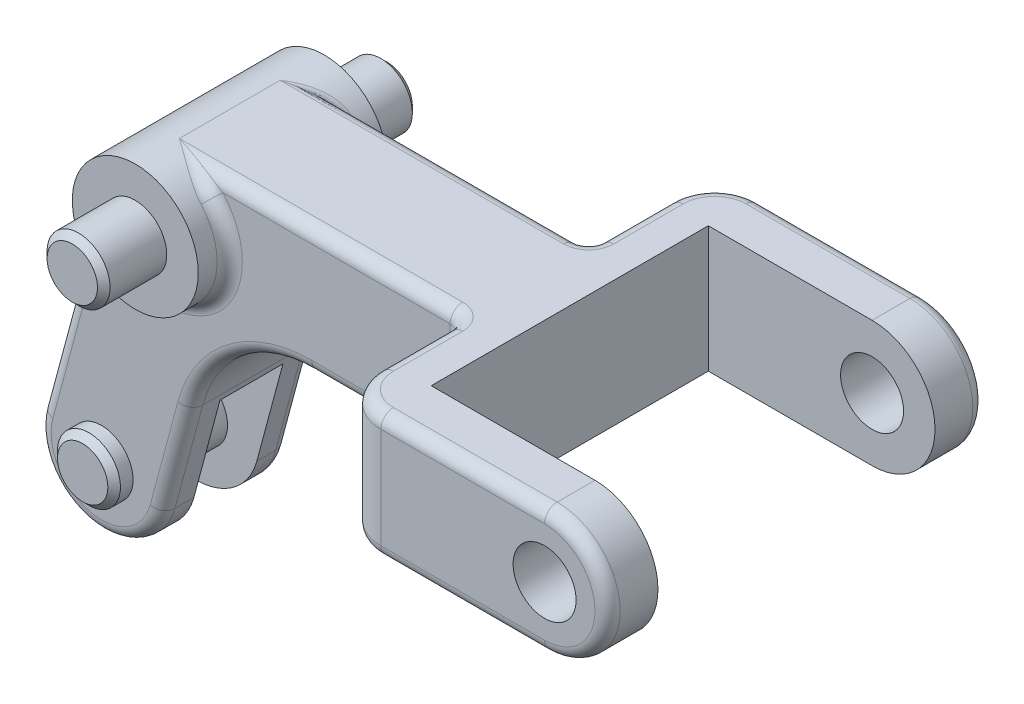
ISO-10303-21;
HEADER;
FILE_DESCRIPTION(('STEP AP214'),'2;1');
FILE_NAME('part.step','',(''),(''),'','','');
FILE_SCHEMA(('AUTOMOTIVE_DESIGN { 1 0 10303 214 1 1 1 1 }'));
ENDSEC;
DATA;
#1=APPLICATION_CONTEXT('core data for automotive mechanical design processes');
#2=APPLICATION_PROTOCOL_DEFINITION('international standard','automotive_design',2000,#1);
#3=PRODUCT_CONTEXT('',#1,'mechanical');
#4=PRODUCT('Part','Part','',(#3));
#5=PRODUCT_RELATED_PRODUCT_CATEGORY('part','',(#4));
#6=PRODUCT_DEFINITION_FORMATION('','',#4);
#7=PRODUCT_DEFINITION_CONTEXT('part definition',#1,'design');
#8=PRODUCT_DEFINITION('design','',#6,#7);
#9=PRODUCT_DEFINITION_SHAPE('','',#8);
#10=(LENGTH_UNIT() NAMED_UNIT(*) SI_UNIT(.MILLI.,.METRE.));
#11=(NAMED_UNIT(*) PLANE_ANGLE_UNIT() SI_UNIT($,.RADIAN.));
#12=(NAMED_UNIT(*) SI_UNIT($,.STERADIAN.) SOLID_ANGLE_UNIT());
#13=UNCERTAINTY_MEASURE_WITH_UNIT(LENGTH_MEASURE(1.E-05),#10,'distance_accuracy_value','');
#14=(GEOMETRIC_REPRESENTATION_CONTEXT(3) GLOBAL_UNCERTAINTY_ASSIGNED_CONTEXT((#13)) GLOBAL_UNIT_ASSIGNED_CONTEXT((#10,
#11,#12)) REPRESENTATION_CONTEXT('',''));
#15=CARTESIAN_POINT('',(0.,0.,0.));
#16=DIRECTION('',(0.,0.,1.));
#17=DIRECTION('',(1.,0.,0.));
#18=AXIS2_PLACEMENT_3D('',#15,#16,#17);
#19=CARTESIAN_POINT('',(0.,0.,10.));
#20=DIRECTION('',(0.,0.,1.));
#21=DIRECTION('',(1.,0.,0.));
#22=AXIS2_PLACEMENT_3D('',#19,#20,#21);
#23=PLANE('',#22);
#24=DIRECTION('',(-0.258819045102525,-0.965925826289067,0.));
#25=VECTOR('',#24,1.);
#26=CARTESIAN_POINT('',(-18.0801684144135,-36.5664806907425,10.));
#27=LINE('',#26,#25);
#28=CARTESIAN_POINT('',(-10.0423545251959,-6.56895087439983,10.));
#29=VERTEX_POINT('',#28);
#30=CARTESIAN_POINT('',(-18.0801684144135,-36.5664806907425,10.));
#31=VERTEX_POINT('',#30);
#32=EDGE_CURVE('E441',#29,#31,#27,.T.);
#33=ORIENTED_EDGE('',*,*,#32,.T.);
#34=CARTESIAN_POINT('',(-10.352761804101,-38.6370330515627,10.));
#35=DIRECTION('',(0.,0.,1.));
#36=DIRECTION('',(1.,0.,0.));
#37=AXIS2_PLACEMENT_3D('',#34,#35,#36);
#38=CIRCLE('',#37,8.);
#39=CARTESIAN_POINT('',(-2.62535519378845,-40.7075854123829,10.));
#40=VERTEX_POINT('',#39);
#41=EDGE_CURVE('E452',#31,#40,#38,.T.);
#42=ORIENTED_EDGE('',*,*,#41,.T.);
#43=DIRECTION('',(0.258819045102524,0.965925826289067,0.));
#44=VECTOR('',#43,1.);
#45=CARTESIAN_POINT('',(1.76944146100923,-24.3059810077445,10.));
#46=LINE('',#45,#44);
#47=CARTESIAN_POINT('',(1.76944146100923,-24.3059810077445,10.));
#48=VERTEX_POINT('',#47);
#49=EDGE_CURVE('E450',#40,#48,#46,.T.);
#50=ORIENTED_EDGE('',*,*,#49,.T.);
#51=CARTESIAN_POINT('',(23.0198096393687,-30.,10.));
#52=DIRECTION('',(0.,0.,1.));
#53=DIRECTION('',(1.,0.,0.));
#54=AXIS2_PLACEMENT_3D('',#51,#52,#53);
#55=CIRCLE('',#54,22.);
#56=CARTESIAN_POINT('',(23.0198096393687,-8.,10.));
#57=VERTEX_POINT('',#56);
#58=EDGE_CURVE('E448',#48,#57,#55,.F.);
#59=ORIENTED_EDGE('',*,*,#58,.T.);
#60=DIRECTION('',(1.,0.,0.));
#61=VECTOR('',#60,1.);
#62=CARTESIAN_POINT('',(47.,-8.,10.));
#63=LINE('',#62,#61);
#64=CARTESIAN_POINT('',(45.,-8.,10.));
#65=VERTEX_POINT('',#64);
#66=EDGE_CURVE('E446',#57,#65,#63,.T.);
#67=ORIENTED_EDGE('',*,*,#66,.T.);
#68=DIRECTION('',(0.,1.,0.));
#69=VECTOR('',#68,1.);
#70=CARTESIAN_POINT('',(45.,0.,10.));
#71=LINE('',#70,#69);
#72=CARTESIAN_POINT('',(45.,8.,10.));
#73=VERTEX_POINT('',#72);
#74=EDGE_CURVE('E444',#65,#73,#71,.T.);
#75=ORIENTED_EDGE('',*,*,#74,.T.);
#76=DIRECTION('',(-1.,0.,0.));
#77=VECTOR('',#76,1.);
#78=CARTESIAN_POINT('',(0.,8.,10.));
#79=LINE('',#78,#77);
#80=CARTESIAN_POINT('',(8.94427190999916,8.,10.));
#81=VERTEX_POINT('',#80);
#82=EDGE_CURVE('E439',#73,#81,#79,.T.);
#83=ORIENTED_EDGE('',*,*,#82,.T.);
#84=CARTESIAN_POINT('',(0.,0.,10.));
#85=DIRECTION('',(0.,0.,1.));
#86=DIRECTION('',(1.,0.,0.));
#87=AXIS2_PLACEMENT_3D('',#84,#85,#86);
#88=CIRCLE('',#87,12.);
#89=EDGE_CURVE('E437',#81,#29,#88,.F.);
#90=ORIENTED_EDGE('',*,*,#89,.T.);
#91=EDGE_LOOP('',(#33,#42,#50,#59,#67,#75,#83,#90));
#92=FACE_BOUND('',#91,.T.);
#93=CARTESIAN_POINT('',(-10.352761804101,-38.6370330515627,10.));
#94=DIRECTION('',(0.,0.,1.));
#95=DIRECTION('',(1.,0.,0.));
#96=AXIS2_PLACEMENT_3D('',#93,#94,#95);
#97=CIRCLE('',#96,5.);
#98=CARTESIAN_POINT('',(-5.35276180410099,-38.6370330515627,10.));
#99=VERTEX_POINT('',#98);
#100=EDGE_CURVE('E369',#99,#99,#97,.T.);
#101=ORIENTED_EDGE('',*,*,#100,.F.);
#102=EDGE_LOOP('',(#101));
#103=FACE_BOUND('',#102,.T.);
#104=ADVANCED_FACE('F33',(#92,#103),#23,.T.);
#105=CARTESIAN_POINT('',(-9.65925826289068,2.58819045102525,30.));
#106=DIRECTION('',(0.965925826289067,-0.258819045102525,0.));
#107=DIRECTION('',(0.258819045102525,0.965925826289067,0.));
#108=AXIS2_PLACEMENT_3D('',#105,#106,#107);
#109=PLANE('',#108);
#110=DIRECTION('',(0.,0.,-1.));
#111=VECTOR('',#110,1.);
#112=CARTESIAN_POINT('',(-20.0120200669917,-36.0488426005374,30.));
#113=LINE('',#112,#111);
#114=CARTESIAN_POINT('',(-20.0120200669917,-36.0488426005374,8.));
#115=VERTEX_POINT('',#114);
#116=CARTESIAN_POINT('',(-20.0120200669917,-36.0488426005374,5.));
#117=VERTEX_POINT('',#116);
#118=EDGE_CURVE('E416',#115,#117,#113,.T.);
#119=ORIENTED_EDGE('',*,*,#118,.F.);
#120=DIRECTION('',(-0.258819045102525,-0.965925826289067,0.));
#121=VECTOR('',#120,1.);
#122=CARTESIAN_POINT('',(-9.65925826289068,2.58819045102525,8.));
#123=LINE('',#122,#121);
#124=CARTESIAN_POINT('',(-9.65925826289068,2.58819045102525,8.));
#125=VERTEX_POINT('',#124);
#126=EDGE_CURVE('E457',#115,#125,#123,.F.);
#127=ORIENTED_EDGE('',*,*,#126,.T.);
#128=DIRECTION('',(0.,0.,-1.));
#129=VECTOR('',#128,1.);
#130=CARTESIAN_POINT('',(-9.65925826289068,2.58819045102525,30.));
#131=LINE('',#130,#129);
#132=CARTESIAN_POINT('',(-9.65925826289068,2.58819045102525,-8.));
#133=VERTEX_POINT('',#132);
#134=EDGE_CURVE('E418',#125,#133,#131,.T.);
#135=ORIENTED_EDGE('',*,*,#134,.T.);
#136=DIRECTION('',(-0.258819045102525,-0.965925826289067,0.));
#137=VECTOR('',#136,1.);
#138=CARTESIAN_POINT('',(-20.0120200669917,-36.0488426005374,-8.));
#139=LINE('',#138,#137);
#140=CARTESIAN_POINT('',(-20.0120200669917,-36.0488426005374,-8.));
#141=VERTEX_POINT('',#140);
#142=EDGE_CURVE('E454',#133,#141,#139,.T.);
#143=ORIENTED_EDGE('',*,*,#142,.T.);
#144=DIRECTION('',(0.,0.,1.));
#145=VECTOR('',#144,1.);
#146=CARTESIAN_POINT('',(-20.0120200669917,-36.0488426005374,-30.));
#147=LINE('',#146,#145);
#148=CARTESIAN_POINT('',(-20.0120200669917,-36.0488426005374,-5.));
#149=VERTEX_POINT('',#148);
#150=EDGE_CURVE('E314',#141,#149,#147,.T.);
#151=ORIENTED_EDGE('',*,*,#150,.T.);
#152=DIRECTION('',(-0.258819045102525,-0.965925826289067,0.));
#153=VECTOR('',#152,1.);
#154=CARTESIAN_POINT('',(-15.8709153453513,-20.5940293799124,-5.));
#155=LINE('',#154,#153);
#156=CARTESIAN_POINT('',(-15.8709153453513,-20.5940293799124,-5.));
#157=VERTEX_POINT('',#156);
#158=EDGE_CURVE('E323',#157,#149,#155,.T.);
#159=ORIENTED_EDGE('',*,*,#158,.F.);
#160=DIRECTION('',(0.,0.,-1.));
#161=VECTOR('',#160,1.);
#162=CARTESIAN_POINT('',(-15.8709153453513,-20.5940293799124,5.));
#163=LINE('',#162,#161);
#164=CARTESIAN_POINT('',(-15.8709153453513,-20.5940293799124,5.));
#165=VERTEX_POINT('',#164);
#166=EDGE_CURVE('E380',#165,#157,#163,.T.);
#167=ORIENTED_EDGE('',*,*,#166,.F.);
#168=DIRECTION('',(-0.258819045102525,-0.965925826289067,0.));
#169=VECTOR('',#168,1.);
#170=CARTESIAN_POINT('',(-15.8709153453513,-20.5940293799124,5.));
#171=LINE('',#170,#169);
#172=EDGE_CURVE('E377',#165,#117,#171,.T.);
#173=ORIENTED_EDGE('',*,*,#172,.T.);
#174=EDGE_LOOP('',(#119,#127,#135,#143,#151,#159,#167,#173));
#175=FACE_BOUND('',#174,.T.);
#176=ADVANCED_FACE('F592',(#175),#109,.F.);
#177=CARTESIAN_POINT('',(-0.693503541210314,-41.2252235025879,30.));
#178=DIRECTION('',(-0.965925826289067,0.258819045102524,0.));
#179=DIRECTION('',(-0.258819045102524,-0.965925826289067,0.));
#180=AXIS2_PLACEMENT_3D('',#177,#178,#179);
#181=PLANE('',#180);
#182=DIRECTION('',(0.,0.,-1.));
#183=VECTOR('',#182,1.);
#184=CARTESIAN_POINT('',(3.70129311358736,-24.8236190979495,30.));
#185=LINE('',#184,#183);
#186=CARTESIAN_POINT('',(3.70129311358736,-24.8236190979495,8.));
#187=VERTEX_POINT('',#186);
#188=CARTESIAN_POINT('',(3.70129311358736,-24.8236190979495,-8.));
#189=VERTEX_POINT('',#188);
#190=EDGE_CURVE('E411',#187,#189,#185,.T.);
#191=ORIENTED_EDGE('',*,*,#190,.F.);
#192=DIRECTION('',(0.258819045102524,0.965925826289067,0.));
#193=VECTOR('',#192,1.);
#194=CARTESIAN_POINT('',(-0.693503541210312,-41.2252235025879,8.));
#195=LINE('',#194,#193);
#196=CARTESIAN_POINT('',(-0.693503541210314,-41.2252235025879,8.));
#197=VERTEX_POINT('',#196);
#198=EDGE_CURVE('E482',#187,#197,#195,.F.);
#199=ORIENTED_EDGE('',*,*,#198,.T.);
#200=DIRECTION('',(0.,0.,-1.));
#201=VECTOR('',#200,1.);
#202=CARTESIAN_POINT('',(-0.693503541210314,-41.2252235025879,30.));
#203=LINE('',#202,#201);
#204=CARTESIAN_POINT('',(-0.693503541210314,-41.2252235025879,5.));
#205=VERTEX_POINT('',#204);
#206=EDGE_CURVE('E414',#197,#205,#203,.T.);
#207=ORIENTED_EDGE('',*,*,#206,.T.);
#208=DIRECTION('',(0.258819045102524,0.965925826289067,0.));
#209=VECTOR('',#208,1.);
#210=CARTESIAN_POINT('',(-0.693503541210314,-41.2252235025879,5.));
#211=LINE('',#210,#209);
#212=CARTESIAN_POINT('',(3.44760118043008,-25.7704102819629,5.));
#213=VERTEX_POINT('',#212);
#214=EDGE_CURVE('E373',#205,#213,#211,.T.);
#215=ORIENTED_EDGE('',*,*,#214,.T.);
#216=DIRECTION('',(0.,0.,-1.));
#217=VECTOR('',#216,1.);
#218=CARTESIAN_POINT('',(3.44760118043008,-25.7704102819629,5.));
#219=LINE('',#218,#217);
#220=CARTESIAN_POINT('',(3.44760118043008,-25.7704102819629,-5.));
#221=VERTEX_POINT('',#220);
#222=EDGE_CURVE('E330',#213,#221,#219,.T.);
#223=ORIENTED_EDGE('',*,*,#222,.T.);
#224=DIRECTION('',(0.258819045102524,0.965925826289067,0.));
#225=VECTOR('',#224,1.);
#226=CARTESIAN_POINT('',(-0.693503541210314,-41.2252235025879,-5.));
#227=LINE('',#226,#225);
#228=CARTESIAN_POINT('',(-0.693503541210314,-41.2252235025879,-5.));
#229=VERTEX_POINT('',#228);
#230=EDGE_CURVE('E321',#229,#221,#227,.T.);
#231=ORIENTED_EDGE('',*,*,#230,.F.);
#232=DIRECTION('',(0.,0.,1.));
#233=VECTOR('',#232,1.);
#234=CARTESIAN_POINT('',(-0.693503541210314,-41.2252235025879,-30.));
#235=LINE('',#234,#233);
#236=CARTESIAN_POINT('',(-0.693503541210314,-41.2252235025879,-8.));
#237=VERTEX_POINT('',#236);
#238=EDGE_CURVE('E303',#237,#229,#235,.T.);
#239=ORIENTED_EDGE('',*,*,#238,.F.);
#240=DIRECTION('',(0.258819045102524,0.965925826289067,0.));
#241=VECTOR('',#240,1.);
#242=CARTESIAN_POINT('',(3.70129311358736,-24.8236190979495,-8.));
#243=LINE('',#242,#241);
#244=EDGE_CURVE('E480',#237,#189,#243,.T.);
#245=ORIENTED_EDGE('',*,*,#244,.T.);
#246=EDGE_LOOP('',(#191,#199,#207,#215,#223,#231,#239,#245));
#247=FACE_BOUND('',#246,.T.);
#248=ADVANCED_FACE('F327',(#247),#181,.F.);
#249=CARTESIAN_POINT('',(0.,0.,30.));
#250=DIRECTION('',(0.,0.,-1.));
#251=DIRECTION('',(-1.,0.,0.));
#252=AXIS2_PLACEMENT_3D('',#249,#250,#251);
#253=CYLINDRICAL_SURFACE('',#252,10.);
#254=CARTESIAN_POINT('',(0.,0.,12.));
#255=DIRECTION('',(0.,0.,1.));
#256=DIRECTION('',(1.,0.,0.));
#257=AXIS2_PLACEMENT_3D('',#254,#255,#256);
#258=CIRCLE('',#257,10.);
#259=CARTESIAN_POINT('',(-8.36862877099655,-5.47412572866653,12.));
#260=VERTEX_POINT('',#259);
#261=CARTESIAN_POINT('',(7.4535599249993,6.66666666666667,12.));
#262=VERTEX_POINT('',#261);
#263=EDGE_CURVE('E566',#260,#262,#258,.T.);
#264=ORIENTED_EDGE('',*,*,#263,.T.);
#265=CARTESIAN_POINT('',(8.46042030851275,5.33116199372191,11.6649222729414));
#266=CARTESIAN_POINT('',(8.00083776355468,6.0605079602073,9.3347511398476));
#267=CARTESIAN_POINT('',(10.1525043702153,7.19869719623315,9.83246113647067));
#268=CARTESIAN_POINT('',(8.38876673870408,5.44496224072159,11.7246559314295));
#269=CARTESIAN_POINT('',(7.97069311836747,6.08665587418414,9.39627397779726));
#270=CARTESIAN_POINT('',(10.066520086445,7.26697734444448,9.86232796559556));
#271=CARTESIAN_POINT('',(8.3133786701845,5.5594290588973,11.775616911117));
#272=CARTESIAN_POINT('',(7.93731178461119,6.11976456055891,9.45885598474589));
#273=CARTESIAN_POINT('',(9.97605440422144,7.33565743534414,9.88780845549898));
#274=CARTESIAN_POINT('',(8.15603623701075,5.78774564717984,11.8611003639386));
#275=CARTESIAN_POINT('',(7.86280539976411,6.19911392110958,9.5816166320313));
#276=CARTESIAN_POINT('',(9.78724348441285,7.47264738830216,9.93055018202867));
#277=CARTESIAN_POINT('',(8.07409655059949,5.90159621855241,11.8956584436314));
#278=CARTESIAN_POINT('',(7.82192622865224,6.24499006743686,9.64170881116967));
#279=CARTESIAN_POINT('',(9.68891586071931,7.54095773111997,9.94782922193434));
#280=CARTESIAN_POINT('',(7.90528124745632,6.12585099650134,11.9493600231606));
#281=CARTESIAN_POINT('',(7.73163571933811,6.34835558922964,9.75586892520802));
#282=CARTESIAN_POINT('',(9.48633749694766,7.67551059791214,9.97468001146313));
#283=CARTESIAN_POINT('',(7.81847889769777,6.23628038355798,11.9686882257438));
#284=CARTESIAN_POINT('',(7.682593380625,6.40536388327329,9.8100045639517));
#285=CARTESIAN_POINT('',(9.38217467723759,7.74176823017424,9.98434411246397));
#286=CARTESIAN_POINT('',(7.63972748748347,6.45402518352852,11.9940111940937));
#287=CARTESIAN_POINT('',(7.57518981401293,6.5291532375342,9.91073956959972));
#288=CARTESIAN_POINT('',(9.16767298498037,7.87241511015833,9.99700559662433));
#289=CARTESIAN_POINT('',(7.54777568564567,6.56133889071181,11.9999987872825));
#290=CARTESIAN_POINT('',(7.51706665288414,6.59567927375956,9.95744128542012));
#291=CARTESIAN_POINT('',(9.05733082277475,7.93680333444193,9.99999939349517));
#292=CARTESIAN_POINT('',(7.26612955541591,6.87620298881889,12.0000024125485));
#293=CARTESIAN_POINT('',(7.33111744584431,6.80353204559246,10.0820542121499));
#294=CARTESIAN_POINT('',(8.7193554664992,8.12572179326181,10.0000012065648));
#295=CARTESIAN_POINT('',(7.06973932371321,7.07787977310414,11.9763130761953));
#296=CARTESIAN_POINT('',(7.18869596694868,6.95694476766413,10.1486873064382));
#297=CARTESIAN_POINT('',(8.4836871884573,8.24672786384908,9.98815653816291));
#298=CARTESIAN_POINT('',(6.6632750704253,7.46186983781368,11.8916070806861));
#299=CARTESIAN_POINT('',(6.87002953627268,7.2748270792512,10.2407984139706));
#300=CARTESIAN_POINT('',(7.9959300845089,8.47712190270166,9.94580354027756));
#301=CARTESIAN_POINT('',(6.45315410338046,7.64411040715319,11.8304556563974));
#302=CARTESIAN_POINT('',(6.69481213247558,7.43906980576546,10.2677715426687));
#303=CARTESIAN_POINT('',(7.74378492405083,8.58646624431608,9.91522782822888));
#304=CARTESIAN_POINT('',(6.06062880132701,7.95741254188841,11.692384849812));
#305=CARTESIAN_POINT('',(6.34970857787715,7.73639417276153,10.2823457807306));
#306=CARTESIAN_POINT('',(7.27275456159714,8.77444752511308,9.84619242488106));
#307=CARTESIAN_POINT('',(5.87976009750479,8.09186262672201,11.6200578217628));
#308=CARTESIAN_POINT('',(6.18540859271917,7.86946815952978,10.2767911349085));
#309=CARTESIAN_POINT('',(7.05571211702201,8.85511757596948,9.81002891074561));
#310=CARTESIAN_POINT('',(5.5127276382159,8.34624015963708,11.4594185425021));
#311=CARTESIAN_POINT('',(5.84242760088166,8.1280229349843,10.2432552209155));
#312=CARTESIAN_POINT('',(6.61527316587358,9.00774409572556,9.72970927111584));
#313=CARTESIAN_POINT('',(5.32656120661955,8.46616010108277,11.3710980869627));
#314=CARTESIAN_POINT('',(5.663763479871,8.25396624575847,10.215817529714));
#315=CARTESIAN_POINT('',(6.39187344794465,9.07969606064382,9.68554904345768));
#316=CARTESIAN_POINT('',(4.94982968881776,8.69180569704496,11.1814547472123));
#317=CARTESIAN_POINT('',(5.29492069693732,8.49511401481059,10.1419711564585));
#318=CARTESIAN_POINT('',(5.93979562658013,9.21508341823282,9.59072737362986));
#319=CARTESIAN_POINT('',(4.7592575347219,8.7975063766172,11.0801095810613));
#320=CARTESIAN_POINT('',(5.10454965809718,8.61083884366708,10.0958839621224));
#321=CARTESIAN_POINT('',(5.71110904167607,9.27850382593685,9.5400547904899));
#322=CARTESIAN_POINT('',(4.37486321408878,8.99484698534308,10.8670479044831));
#323=CARTESIAN_POINT('',(4.71508854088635,8.82939589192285,9.98810098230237));
#324=CARTESIAN_POINT('',(5.24983585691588,9.39690819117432,9.43352395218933));
#325=CARTESIAN_POINT('',(4.18104008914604,9.08648268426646,10.7553282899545));
#326=CARTESIAN_POINT('',(4.51569350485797,8.93275414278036,9.92658410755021));
#327=CARTESIAN_POINT('',(5.01724810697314,9.45188961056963,9.37766414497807));
#328=CARTESIAN_POINT('',(3.71130542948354,9.29063337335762,10.4763757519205));
#329=CARTESIAN_POINT('',(4.02929360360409,9.16384988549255,9.76383301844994));
#330=CARTESIAN_POINT('',(4.45356651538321,9.57438002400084,9.23818787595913));
#331=CARTESIAN_POINT('',(3.43413222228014,9.39643729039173,10.3050746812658));
#332=CARTESIAN_POINT('',(3.73632180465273,9.28665794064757,9.65591861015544));
#333=CARTESIAN_POINT('',(4.12095866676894,9.63786237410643,9.15253734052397));
#334=CARTESIAN_POINT('',(2.87630625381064,9.58192845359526,9.95079151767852));
#335=CARTESIAN_POINT('',(3.14204996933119,9.50269097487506,9.42227661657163));
#336=CARTESIAN_POINT('',(3.45156750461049,9.74915707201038,8.97539575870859));
#337=CARTESIAN_POINT('',(2.59565187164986,9.66160302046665,9.76780380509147));
#338=CARTESIAN_POINT('',(2.83942048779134,9.59699266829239,9.29629092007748));
#339=CARTESIAN_POINT('',(3.11478224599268,9.79696181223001,8.88390190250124));
#340=CARTESIAN_POINT('',(1.75113188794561,9.86245121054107,9.20761171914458));
#341=CARTESIAN_POINT('',(1.93115995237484,9.83261223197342,8.90355073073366));
#342=CARTESIAN_POINT('',(2.10135826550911,9.91747072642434,8.60380585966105));
#343=CARTESIAN_POINT('',(1.18329808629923,9.94604844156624,8.81830696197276));
#344=CARTESIAN_POINT('',(1.30292916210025,9.93500657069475,8.61320274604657));
#345=CARTESIAN_POINT('',(1.41995770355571,9.96762906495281,8.40915348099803));
#346=CARTESIAN_POINT('',(0.41544210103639,9.99336894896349,8.28780989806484));
#347=CARTESIAN_POINT('',(0.45725592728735,9.99207542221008,8.21598638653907));
#348=CARTESIAN_POINT('',(0.498530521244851,9.9960213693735,8.14390494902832));
#349=CARTESIAN_POINT('',(0.215638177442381,9.99967162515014,8.14939807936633));
#350=CARTESIAN_POINT('',(0.237208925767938,9.99960690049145,8.11205187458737));
#351=CARTESIAN_POINT('',(0.258765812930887,9.99980297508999,8.07469903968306));
#352=CARTESIAN_POINT('',(0.0105409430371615,9.9999958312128,8.00730298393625));
#353=CARTESIAN_POINT('',(0.0115950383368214,9.99999497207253,8.00547723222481));
#354=CARTESIAN_POINT('',(0.012649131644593,9.99999749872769,8.00365149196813));
#355=CARTESIAN_POINT('',(0.00527047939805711,9.99999999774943,8.00365149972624));
#356=CARTESIAN_POINT('',(0.00579752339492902,9.99999997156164,8.00273861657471));
#357=CARTESIAN_POINT('',(0.00632457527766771,9.99999999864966,8.00182574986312));
#358=CARTESIAN_POINT('',(0.,10.,8.));
#359=CARTESIAN_POINT('',(0.,10.,8.));
#360=CARTESIAN_POINT('',(0.,10.,8.));
#361=(BOUNDED_SURFACE() B_SPLINE_SURFACE(3,2,((#265,#266,#267),(#268,#269,#270),(#271,#272,
#273),(#274,#275,#276),(#277,#278,#279),(#280,#281,#282),(#283,#284,#285),(#286,#287,#288),
(#289,#290,#291),(#292,#293,#294),(#295,#296,#297),(#298,#299,#300),(#301,#302,#303),(#304,#305,
#306),(#307,#308,#309),(#310,#311,#312),(#313,#314,#315),(#316,#317,#318),(#319,#320,#321),
(#322,#323,#324),(#325,#326,#327),(#328,#329,#330),(#331,#332,#333),(#334,#335,#336),(#337,#338,
#339),(#340,#341,#342),(#343,#344,#345),(#346,#347,#348),(#349,#350,#351),(#352,#353,#354),
(#355,#356,#357),(#358,#359,#360)),.UNSPECIFIED.,.F.,.F.,.F.) B_SPLINE_SURFACE_WITH_KNOTS((4,2,
2,2,2,2,2,2,2,2,2,2,2,2,2,4),(3,3),(0.,0.515699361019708,1.03027409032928,1.53850783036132,
2.04701475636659,3.05862513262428,4.07389619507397,4.9125838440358,5.75170294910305,
6.59227717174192,7.43310371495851,8.61660932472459,9.80068838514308,12.1628061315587,
12.9934730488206,13.0153819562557),(0.,1.),
.UNSPECIFIED.) GEOMETRIC_REPRESENTATION_ITEM() RATIONAL_B_SPLINE_SURFACE(((1.,0.627059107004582,
1.),(1.,0.632489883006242,1.),(1.,0.638362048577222,1.),(1.,0.650800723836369,1.),(1.,
0.657365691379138,1.),(1.,0.670942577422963,1.),(1.,0.677947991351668,1.),(1.,0.692306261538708,
1.),(1.,0.699659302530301,1.),(1.,0.72192260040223,1.),(1.,0.737112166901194,1.),(1.,
0.767253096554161,1.),(1.,0.782203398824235,1.),(1.,0.808645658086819,1.),(1.,0.820286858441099,
1.),(1.,0.842706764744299,1.),(1.,0.853485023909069,1.),(1.,0.874040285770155,1.),(1.,
0.883815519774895,1.),(1.,0.902254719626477,1.),(1.,0.910918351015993,1.),(1.,0.930370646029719,
1.),(1.,0.940586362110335,1.),(1.,0.958624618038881,1.),(1.,0.96644599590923,1.),(1.,
0.986241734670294,1.),(1.,0.994606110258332,1.),(1.,0.999337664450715,1.),(1.,0.999967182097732,
1.),(1.,0.999999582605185,1.),(1.,0.999999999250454,1.),(1.,1.,1.))) REPRESENTATION_ITEM('') SURFACE());
#362=CARTESIAN_POINT('',(8.46042030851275,5.33116199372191,11.6649222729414));
#363=CARTESIAN_POINT('',(8.38876673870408,5.44496224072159,11.7246559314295));
#364=CARTESIAN_POINT('',(8.3133786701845,5.5594290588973,11.775616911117));
#365=CARTESIAN_POINT('',(8.15603623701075,5.78774564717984,11.8611003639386));
#366=CARTESIAN_POINT('',(8.07409655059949,5.90159621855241,11.8956584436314));
#367=CARTESIAN_POINT('',(7.90528124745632,6.12585099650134,11.9493600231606));
#368=CARTESIAN_POINT('',(7.81847889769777,6.23628038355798,11.9686882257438));
#369=CARTESIAN_POINT('',(7.63972748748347,6.45402518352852,11.9940111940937));
#370=CARTESIAN_POINT('',(7.54777568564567,6.56133889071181,11.9999987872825));
#371=CARTESIAN_POINT('',(7.26612955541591,6.87620298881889,12.0000024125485));
#372=CARTESIAN_POINT('',(7.06973932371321,7.07787977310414,11.9763130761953));
#373=CARTESIAN_POINT('',(6.6632750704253,7.46186983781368,11.8916070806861));
#374=CARTESIAN_POINT('',(6.45315410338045,7.64411040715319,11.8304556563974));
#375=CARTESIAN_POINT('',(6.06062880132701,7.95741254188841,11.692384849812));
#376=CARTESIAN_POINT('',(5.87976009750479,8.09186262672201,11.6200578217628));
#377=CARTESIAN_POINT('',(5.5127276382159,8.34624015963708,11.4594185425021));
#378=CARTESIAN_POINT('',(5.32656120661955,8.46616010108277,11.3710980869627));
#379=CARTESIAN_POINT('',(4.94982968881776,8.69180569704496,11.1814547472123));
#380=CARTESIAN_POINT('',(4.7592575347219,8.79750637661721,11.0801095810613));
#381=CARTESIAN_POINT('',(4.37486321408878,8.99484698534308,10.8670479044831));
#382=CARTESIAN_POINT('',(4.18104008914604,9.08648268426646,10.7553282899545));
#383=CARTESIAN_POINT('',(3.71130542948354,9.29063337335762,10.4763757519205));
#384=CARTESIAN_POINT('',(3.43413222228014,9.39643729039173,10.3050746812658));
#385=CARTESIAN_POINT('',(2.87630625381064,9.58192845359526,9.95079151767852));
#386=CARTESIAN_POINT('',(2.59565187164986,9.66160302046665,9.76780380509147));
#387=CARTESIAN_POINT('',(1.75113188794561,9.86245121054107,9.20761171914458));
#388=CARTESIAN_POINT('',(1.18329808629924,9.94604844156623,8.81830696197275));
#389=CARTESIAN_POINT('',(0.415442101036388,9.9933689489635,8.28780989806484));
#390=CARTESIAN_POINT('',(0.215638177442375,9.99967162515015,8.14939807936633));
#391=CARTESIAN_POINT('',(0.0105409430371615,9.9999958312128,8.00730298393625));
#392=CARTESIAN_POINT('',(0.0052704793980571,9.99999999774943,8.00365149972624));
#393=CARTESIAN_POINT('',(0.,10.,8.));
#394=B_SPLINE_CURVE_WITH_KNOTS('',3,(#362,#363,#364,#365,#366,#367,#368,#369,#370,#371,#372,
#373,#374,#375,#376,#377,#378,#379,#380,#381,#382,#383,#384,#385,#386,#387,#388,#389,#390,#391,
#392,#393),.UNSPECIFIED.,.F.,.F.,(4,2,2,2,2,2,2,2,2,2,2,2,2,2,2,4),(0.,0.515699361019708,
1.03027409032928,1.53850783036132,2.04701475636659,3.05862513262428,4.07389619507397,
4.9125838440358,5.75170294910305,6.59227717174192,7.43310371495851,8.61660932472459,
9.80068838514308,12.1628061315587,12.9934730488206,13.0153819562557),.UNSPECIFIED.);
#395=CARTESIAN_POINT('',(0.,10.,8.));
#396=VERTEX_POINT('',#395);
#397=EDGE_CURVE('E630',#262,#396,#394,.T.);
#398=ORIENTED_EDGE('',*,*,#397,.T.);
#399=DIRECTION('',(0.,0.,-1.));
#400=VECTOR('',#399,1.);
#401=CARTESIAN_POINT('',(0.,10.,30.));
#402=LINE('',#401,#400);
#403=CARTESIAN_POINT('',(0.,10.,-8.));
#404=VERTEX_POINT('',#403);
#405=EDGE_CURVE('E402',#396,#404,#402,.T.);
#406=ORIENTED_EDGE('',*,*,#405,.T.);
#407=CARTESIAN_POINT('',(10.1525043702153,7.19869719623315,-9.83246113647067));
#408=CARTESIAN_POINT('',(8.00083776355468,6.0605079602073,-9.3347511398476));
#409=CARTESIAN_POINT('',(8.46042030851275,5.33116199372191,-11.6649222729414));
#410=CARTESIAN_POINT('',(10.066520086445,7.26697734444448,-9.86232796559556));
#411=CARTESIAN_POINT('',(7.97069311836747,6.08665587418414,-9.39627397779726));
#412=CARTESIAN_POINT('',(8.38876673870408,5.44496224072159,-11.7246559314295));
#413=CARTESIAN_POINT('',(9.97605440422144,7.33565743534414,-9.88780845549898));
#414=CARTESIAN_POINT('',(7.93731178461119,6.11976456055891,-9.4588559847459));
#415=CARTESIAN_POINT('',(8.3133786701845,5.5594290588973,-11.775616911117));
#416=CARTESIAN_POINT('',(9.78724348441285,7.47264738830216,-9.93055018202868));
#417=CARTESIAN_POINT('',(7.86280539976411,6.19911392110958,-9.5816166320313));
#418=CARTESIAN_POINT('',(8.15603623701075,5.78774564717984,-11.8611003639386));
#419=CARTESIAN_POINT('',(9.68891586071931,7.54095773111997,-9.94782922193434));
#420=CARTESIAN_POINT('',(7.82192622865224,6.24499006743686,-9.64170881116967));
#421=CARTESIAN_POINT('',(8.07409655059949,5.90159621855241,-11.8956584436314));
#422=CARTESIAN_POINT('',(9.48633749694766,7.67551059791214,-9.97468001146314));
#423=CARTESIAN_POINT('',(7.73163571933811,6.34835558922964,-9.75586892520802));
#424=CARTESIAN_POINT('',(7.90528124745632,6.12585099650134,-11.9493600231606));
#425=CARTESIAN_POINT('',(9.38217467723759,7.74176823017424,-9.98434411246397));
#426=CARTESIAN_POINT('',(7.682593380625,6.40536388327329,-9.8100045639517));
#427=CARTESIAN_POINT('',(7.81847889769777,6.23628038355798,-11.9686882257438));
#428=CARTESIAN_POINT('',(9.16767298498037,7.87241511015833,-9.99700559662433));
#429=CARTESIAN_POINT('',(7.57518981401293,6.5291532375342,-9.91073956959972));
#430=CARTESIAN_POINT('',(7.63972748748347,6.45402518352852,-11.9940111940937));
#431=CARTESIAN_POINT('',(9.05733082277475,7.93680333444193,-9.99999939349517));
#432=CARTESIAN_POINT('',(7.51706665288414,6.59567927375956,-9.95744128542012));
#433=CARTESIAN_POINT('',(7.54777568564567,6.56133889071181,-11.9999987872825));
#434=CARTESIAN_POINT('',(8.7193554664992,8.12572179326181,-10.0000012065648));
#435=CARTESIAN_POINT('',(7.3311174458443,6.80353204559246,-10.0820542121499));
#436=CARTESIAN_POINT('',(7.26612955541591,6.87620298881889,-12.0000024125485));
#437=CARTESIAN_POINT('',(8.4836871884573,8.24672786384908,-9.98815653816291));
#438=CARTESIAN_POINT('',(7.18869596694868,6.95694476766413,-10.1486873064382));
#439=CARTESIAN_POINT('',(7.06973932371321,7.07787977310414,-11.9763130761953));
#440=CARTESIAN_POINT('',(7.9959300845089,8.47712190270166,-9.94580354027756));
#441=CARTESIAN_POINT('',(6.87002953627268,7.2748270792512,-10.2407984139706));
#442=CARTESIAN_POINT('',(6.6632750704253,7.46186983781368,-11.8916070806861));
#443=CARTESIAN_POINT('',(7.74378492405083,8.58646624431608,-9.91522782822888));
#444=CARTESIAN_POINT('',(6.69481213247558,7.43906980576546,-10.2677715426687));
#445=CARTESIAN_POINT('',(6.45315410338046,7.64411040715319,-11.8304556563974));
#446=CARTESIAN_POINT('',(7.27275456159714,8.77444752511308,-9.84619242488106));
#447=CARTESIAN_POINT('',(6.34970857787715,7.73639417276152,-10.2823457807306));
#448=CARTESIAN_POINT('',(6.06062880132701,7.9574125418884,-11.692384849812));
#449=CARTESIAN_POINT('',(7.05571211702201,8.85511757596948,-9.81002891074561));
#450=CARTESIAN_POINT('',(6.18540859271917,7.86946815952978,-10.2767911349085));
#451=CARTESIAN_POINT('',(5.87976009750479,8.09186262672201,-11.6200578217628));
#452=CARTESIAN_POINT('',(6.61527316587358,9.00774409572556,-9.72970927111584));
#453=CARTESIAN_POINT('',(5.84242760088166,8.1280229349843,-10.2432552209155));
#454=CARTESIAN_POINT('',(5.5127276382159,8.34624015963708,-11.4594185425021));
#455=CARTESIAN_POINT('',(6.39187344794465,9.07969606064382,-9.68554904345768));
#456=CARTESIAN_POINT('',(5.66376347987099,8.25396624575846,-10.215817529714));
#457=CARTESIAN_POINT('',(5.32656120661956,8.46616010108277,-11.3710980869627));
#458=CARTESIAN_POINT('',(5.93979562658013,9.21508341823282,-9.59072737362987));
#459=CARTESIAN_POINT('',(5.29492069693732,8.49511401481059,-10.1419711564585));
#460=CARTESIAN_POINT('',(4.94982968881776,8.69180569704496,-11.1814547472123));
#461=CARTESIAN_POINT('',(5.71110904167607,9.27850382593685,-9.5400547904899));
#462=CARTESIAN_POINT('',(5.10454965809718,8.61083884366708,-10.0958839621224));
#463=CARTESIAN_POINT('',(4.7592575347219,8.7975063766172,-11.0801095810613));
#464=CARTESIAN_POINT('',(5.24983585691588,9.39690819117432,-9.43352395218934));
#465=CARTESIAN_POINT('',(4.71508854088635,8.82939589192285,-9.98810098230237));
#466=CARTESIAN_POINT('',(4.37486321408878,8.99484698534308,-10.8670479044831));
#467=CARTESIAN_POINT('',(5.01724810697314,9.45188961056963,-9.37766414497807));
#468=CARTESIAN_POINT('',(4.51569350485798,8.93275414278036,-9.92658410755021));
#469=CARTESIAN_POINT('',(4.18104008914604,9.08648268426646,-10.7553282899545));
#470=CARTESIAN_POINT('',(4.45356651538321,9.57438002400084,-9.23818787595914));
#471=CARTESIAN_POINT('',(4.02929360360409,9.16384988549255,-9.76383301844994));
#472=CARTESIAN_POINT('',(3.71130542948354,9.29063337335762,-10.4763757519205));
#473=CARTESIAN_POINT('',(4.12095866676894,9.63786237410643,-9.15253734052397));
#474=CARTESIAN_POINT('',(3.73632180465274,9.28665794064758,-9.65591861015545));
#475=CARTESIAN_POINT('',(3.43413222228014,9.39643729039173,-10.3050746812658));
#476=CARTESIAN_POINT('',(3.45156750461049,9.74915707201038,-8.97539575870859));
#477=CARTESIAN_POINT('',(3.14204996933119,9.50269097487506,-9.42227661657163));
#478=CARTESIAN_POINT('',(2.87630625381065,9.58192845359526,-9.95079151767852));
#479=CARTESIAN_POINT('',(3.11478224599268,9.79696181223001,-8.88390190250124));
#480=CARTESIAN_POINT('',(2.83942048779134,9.59699266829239,-9.29629092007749));
#481=CARTESIAN_POINT('',(2.59565187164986,9.66160302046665,-9.76780380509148));
#482=CARTESIAN_POINT('',(2.10135826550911,9.91747072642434,-8.60380585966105));
#483=CARTESIAN_POINT('',(1.93115995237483,9.83261223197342,-8.90355073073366));
#484=CARTESIAN_POINT('',(1.75113188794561,9.86245121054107,-9.20761171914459));
#485=CARTESIAN_POINT('',(1.41995770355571,9.96762906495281,-8.40915348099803));
#486=CARTESIAN_POINT('',(1.30292916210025,9.93500657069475,-8.61320274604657));
#487=CARTESIAN_POINT('',(1.18329808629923,9.94604844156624,-8.81830696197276));
#488=CARTESIAN_POINT('',(0.49853052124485,9.9960213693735,-8.14390494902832));
#489=CARTESIAN_POINT('',(0.457255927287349,9.99207542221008,-8.21598638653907));
#490=CARTESIAN_POINT('',(0.415442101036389,9.99336894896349,-8.28780989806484));
#491=CARTESIAN_POINT('',(0.258765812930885,9.99980297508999,-8.07469903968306));
#492=CARTESIAN_POINT('',(0.237208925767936,9.99960690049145,-8.11205187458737));
#493=CARTESIAN_POINT('',(0.215638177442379,9.99967162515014,-8.14939807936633));
#494=CARTESIAN_POINT('',(0.0126491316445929,9.99999749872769,-8.00365149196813));
#495=CARTESIAN_POINT('',(0.0115950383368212,9.99999497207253,-8.00547723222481));
#496=CARTESIAN_POINT('',(0.0105409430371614,9.9999958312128,-8.00730298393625));
#497=CARTESIAN_POINT('',(0.00632457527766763,9.99999999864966,-8.00182574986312));
#498=CARTESIAN_POINT('',(0.00579752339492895,9.99999997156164,-8.00273861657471));
#499=CARTESIAN_POINT('',(0.00527047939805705,9.99999999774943,-8.00365149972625));
#500=CARTESIAN_POINT('',(0.,10.,-8.));
#501=CARTESIAN_POINT('',(0.,10.,-8.));
#502=CARTESIAN_POINT('',(0.,10.,-8.));
#503=(BOUNDED_SURFACE() B_SPLINE_SURFACE(3,2,((#407,#408,#409),(#410,#411,#412),(#413,#414,
#415),(#416,#417,#418),(#419,#420,#421),(#422,#423,#424),(#425,#426,#427),(#428,#429,#430),
(#431,#432,#433),(#434,#435,#436),(#437,#438,#439),(#440,#441,#442),(#443,#444,#445),(#446,#447,
#448),(#449,#450,#451),(#452,#453,#454),(#455,#456,#457),(#458,#459,#460),(#461,#462,#463),
(#464,#465,#466),(#467,#468,#469),(#470,#471,#472),(#473,#474,#475),(#476,#477,#478),(#479,#480,
#481),(#482,#483,#484),(#485,#486,#487),(#488,#489,#490),(#491,#492,#493),(#494,#495,#496),
(#497,#498,#499),(#500,#501,#502)),.UNSPECIFIED.,.F.,.F.,.F.) B_SPLINE_SURFACE_WITH_KNOTS((4,2,
2,2,2,2,2,2,2,2,2,2,2,2,2,4),(3,3),(0.,0.515699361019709,1.03027409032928,1.53850783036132,
2.04701475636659,3.05862513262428,4.07389619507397,4.91258384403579,5.75170294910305,
6.59227717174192,7.43310371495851,8.61660932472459,9.80068838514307,12.1628061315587,
12.9934730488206,13.0153819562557),(0.,1.),
.UNSPECIFIED.) GEOMETRIC_REPRESENTATION_ITEM() RATIONAL_B_SPLINE_SURFACE(((1.,0.627059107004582,
1.),(1.,0.632489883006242,1.),(1.,0.638362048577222,1.),(1.,0.650800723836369,1.),(1.,
0.657365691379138,1.),(1.,0.670942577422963,1.),(1.,0.677947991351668,1.),(1.,0.692306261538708,
1.),(1.,0.699659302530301,1.),(1.,0.72192260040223,1.),(1.,0.737112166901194,1.),(1.,
0.767253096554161,1.),(1.,0.782203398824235,1.),(1.,0.808645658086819,1.),(1.,0.820286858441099,
1.),(1.,0.842706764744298,1.),(1.,0.853485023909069,1.),(1.,0.874040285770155,1.),(1.,
0.883815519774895,1.),(1.,0.902254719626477,1.),(1.,0.910918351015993,1.),(1.,0.930370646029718,
1.),(1.,0.940586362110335,1.),(1.,0.958624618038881,1.),(1.,0.96644599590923,1.),(1.,
0.986241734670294,1.),(1.,0.994606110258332,1.),(1.,0.999337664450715,1.),(1.,0.999967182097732,
1.),(1.,0.999999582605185,1.),(1.,0.999999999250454,1.),(1.,1.,1.))) REPRESENTATION_ITEM('') SURFACE());
#504=CARTESIAN_POINT('',(8.46042030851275,5.33116199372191,-11.6649222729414));
#505=CARTESIAN_POINT('',(8.38876673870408,5.44496224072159,-11.7246559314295));
#506=CARTESIAN_POINT('',(8.3133786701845,5.5594290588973,-11.775616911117));
#507=CARTESIAN_POINT('',(8.15603623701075,5.78774564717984,-11.8611003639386));
#508=CARTESIAN_POINT('',(8.07409655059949,5.90159621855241,-11.8956584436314));
#509=CARTESIAN_POINT('',(7.90528124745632,6.12585099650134,-11.9493600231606));
#510=CARTESIAN_POINT('',(7.81847889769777,6.23628038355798,-11.9686882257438));
#511=CARTESIAN_POINT('',(7.63972748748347,6.45402518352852,-11.9940111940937));
#512=CARTESIAN_POINT('',(7.54777568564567,6.56133889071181,-11.9999987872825));
#513=CARTESIAN_POINT('',(7.26612955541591,6.87620298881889,-12.0000024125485));
#514=CARTESIAN_POINT('',(7.06973932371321,7.07787977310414,-11.9763130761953));
#515=CARTESIAN_POINT('',(6.6632750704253,7.46186983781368,-11.8916070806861));
#516=CARTESIAN_POINT('',(6.45315410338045,7.64411040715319,-11.8304556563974));
#517=CARTESIAN_POINT('',(6.06062880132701,7.95741254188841,-11.692384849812));
#518=CARTESIAN_POINT('',(5.87976009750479,8.09186262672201,-11.6200578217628));
#519=CARTESIAN_POINT('',(5.5127276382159,8.34624015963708,-11.4594185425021));
#520=CARTESIAN_POINT('',(5.32656120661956,8.46616010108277,-11.3710980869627));
#521=CARTESIAN_POINT('',(4.94982968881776,8.69180569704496,-11.1814547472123));
#522=CARTESIAN_POINT('',(4.7592575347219,8.79750637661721,-11.0801095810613));
#523=CARTESIAN_POINT('',(4.37486321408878,8.99484698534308,-10.8670479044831));
#524=CARTESIAN_POINT('',(4.18104008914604,9.08648268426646,-10.7553282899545));
#525=CARTESIAN_POINT('',(3.71130542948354,9.29063337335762,-10.4763757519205));
#526=CARTESIAN_POINT('',(3.43413222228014,9.39643729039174,-10.3050746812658));
#527=CARTESIAN_POINT('',(2.87630625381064,9.58192845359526,-9.95079151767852));
#528=CARTESIAN_POINT('',(2.59565187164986,9.66160302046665,-9.76780380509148));
#529=CARTESIAN_POINT('',(1.75113188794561,9.86245121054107,-9.20761171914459));
#530=CARTESIAN_POINT('',(1.18329808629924,9.94604844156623,-8.81830696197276));
#531=CARTESIAN_POINT('',(0.415442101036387,9.9933689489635,-8.28780989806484));
#532=CARTESIAN_POINT('',(0.215638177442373,9.99967162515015,-8.14939807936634));
#533=CARTESIAN_POINT('',(0.0105409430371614,9.9999958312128,-8.00730298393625));
#534=CARTESIAN_POINT('',(0.00527047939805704,9.99999999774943,-8.00365149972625));
#535=CARTESIAN_POINT('',(0.,10.,-8.));
#536=B_SPLINE_CURVE_WITH_KNOTS('',3,(#504,#505,#506,#507,#508,#509,#510,#511,#512,#513,#514,
#515,#516,#517,#518,#519,#520,#521,#522,#523,#524,#525,#526,#527,#528,#529,#530,#531,#532,#533,
#534,#535),.UNSPECIFIED.,.F.,.F.,(4,2,2,2,2,2,2,2,2,2,2,2,2,2,2,4),(0.,0.515699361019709,
1.03027409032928,1.53850783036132,2.04701475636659,3.05862513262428,4.07389619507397,
4.91258384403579,5.75170294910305,6.59227717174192,7.43310371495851,8.61660932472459,
9.80068838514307,12.1628061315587,12.9934730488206,13.0153819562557),.UNSPECIFIED.);
#537=CARTESIAN_POINT('',(7.4535599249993,6.66666666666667,-12.));
#538=VERTEX_POINT('',#537);
#539=EDGE_CURVE('E54',#404,#538,#536,.F.);
#540=ORIENTED_EDGE('',*,*,#539,.T.);
#541=CARTESIAN_POINT('',(0.,0.,-12.));
#542=DIRECTION('',(0.,0.,-1.));
#543=DIRECTION('',(-1.,0.,0.));
#544=AXIS2_PLACEMENT_3D('',#541,#542,#543);
#545=CIRCLE('',#544,10.);
#546=CARTESIAN_POINT('',(-8.36862877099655,-5.47412572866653,-12.));
#547=VERTEX_POINT('',#546);
#548=EDGE_CURVE('E49',#538,#547,#545,.T.);
#549=ORIENTED_EDGE('',*,*,#548,.T.);
#550=CARTESIAN_POINT('',(-7.33922495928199,-6.79233222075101,-11.6649222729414));
#551=CARTESIAN_POINT('',(-7.92477034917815,-6.15964094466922,-9.3347511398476));
#552=CARTESIAN_POINT('',(-9.58106902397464,-7.94340623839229,-9.83246113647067));
#553=CARTESIAN_POINT('',(-7.43060224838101,-6.6936665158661,-11.7246559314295));
#554=CARTESIAN_POINT('',(-7.94222528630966,-6.12375587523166,-9.39627397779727));
#555=CARTESIAN_POINT('',(-9.62476821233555,-7.84267959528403,-9.86232796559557));
#556=CARTESIAN_POINT('',(-7.52165683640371,-6.5912210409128,-11.775616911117));
#557=CARTESIAN_POINT('',(-7.96556609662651,-6.08294282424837,-9.45885598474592));
#558=CARTESIAN_POINT('',(-9.66769384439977,-7.73752074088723,-9.88780845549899));
#559=CARTESIAN_POINT('',(-7.70147050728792,-6.38014723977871,-11.8611003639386));
#560=CARTESIAN_POINT('',(-8.02292802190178,-5.9904380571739,-9.58161663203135));
#561=CARTESIAN_POINT('',(-9.75114811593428,-7.51968778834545,-9.93055018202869));
#562=CARTESIAN_POINT('',(-7.79023416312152,-6.271532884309,-11.8956584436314));
#563=CARTESIAN_POINT('',(-8.05666066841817,-5.93907818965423,-9.64170881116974));
#564=CARTESIAN_POINT('',(-9.79168177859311,-7.40703057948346,-9.94782922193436));
#565=CARTESIAN_POINT('',(-7.96315502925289,-6.05042841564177,-11.9493600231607));
#566=CARTESIAN_POINT('',(-8.13313519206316,-5.82511128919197,-9.75586892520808));
#567=CARTESIAN_POINT('',(-9.86921872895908,-7.17653006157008,-9.97468001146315));
#568=CARTESIAN_POINT('',(-8.04735552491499,-5.93800255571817,-11.9686882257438));
#569=CARTESIAN_POINT('',(-8.17550788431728,-5.76298519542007,-9.81000456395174));
#570=CARTESIAN_POINT('',(-9.90625936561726,-7.05876776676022,-9.98434411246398));
#571=CARTESIAN_POINT('',(-8.21141658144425,-5.70898545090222,-11.9940111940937));
#572=CARTESIAN_POINT('',(-8.26728113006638,-5.62720227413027,-9.91073956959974));
#573=CARTESIAN_POINT('',(-9.97693743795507,-6.8177611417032,-9.99700559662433));
#574=CARTESIAN_POINT('',(-8.29127478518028,-5.59239199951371,-11.9999987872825));
#575=CARTESIAN_POINT('',(-8.31649696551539,-5.55384140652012,-9.95744128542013));
#576=CARTESIAN_POINT('',(-10.0105730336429,-6.69451389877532,-9.99999939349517));
#577=CARTESIAN_POINT('',(-8.5225147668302,-5.23884990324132,-12.0000024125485));
#578=CARTESIAN_POINT('',(-8.46914012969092,-5.3204320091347,-10.0820542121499));
#579=CARTESIAN_POINT('',(-10.1055797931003,-6.31915907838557,-10.0000012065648));
#580=CARTESIAN_POINT('',(-8.66649004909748,-4.99695371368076,-11.9763130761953));
#581=CARTESIAN_POINT('',(-8.58046404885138,-5.14315729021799,-10.1486873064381));
#582=CARTESIAN_POINT('',(-10.1614672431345,-6.06020232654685,-9.98815653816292));
#583=CARTESIAN_POINT('',(-8.93219527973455,-4.50495545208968,-11.8916070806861));
#584=CARTESIAN_POINT('',(-8.80503784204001,-4.75307515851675,-10.2407984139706));
#585=CARTESIAN_POINT('',(-10.2577699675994,-5.52943477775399,-9.94580354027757));
#586=CARTESIAN_POINT('',(-9.05384284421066,-4.25482685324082,-11.8304556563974));
#587=CARTESIAN_POINT('',(-8.91833453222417,-4.54131899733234,-10.2677715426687));
#588=CARTESIAN_POINT('',(-10.2981285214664,-5.25758085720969,-9.91522782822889));
#589=CARTESIAN_POINT('',(-9.25487644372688,-3.79458796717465,-11.692384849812));
#590=CARTESIAN_POINT('',(-9.11620844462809,-4.13102135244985,-10.2823457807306));
#591=CARTESIAN_POINT('',(-10.3577928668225,-4.75394732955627,-9.84619242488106));
#592=CARTESIAN_POINT('',(-9.33793298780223,-3.58508397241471,-11.6200578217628));
#593=CARTESIAN_POINT('',(-9.20222407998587,-3.93787767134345,-10.2767911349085));
#594=CARTESIAN_POINT('',(-10.3795394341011,-4.52342148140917,-9.81002891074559));
#595=CARTESIAN_POINT('',(-9.48864782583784,-3.16472009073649,-11.459418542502));
#596=CARTESIAN_POINT('',(-9.36319880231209,-3.53966457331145,-10.2432552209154));
#597=CARTESIAN_POINT('',(-10.4129713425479,-4.05848747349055,-9.72970927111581));
#598=CARTESIAN_POINT('',(-9.55629817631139,-2.95385956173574,-11.3710980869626));
#599=CARTESIAN_POINT('',(-9.43860902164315,-3.33449175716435,-10.215817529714));
#600=CARTESIAN_POINT('',(-10.4246515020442,-3.82407737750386,-9.68554904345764));
#601=CARTESIAN_POINT('',(-9.67674979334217,-2.53156348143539,-11.1814547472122));
#602=CARTESIAN_POINT('',(-9.57607634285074,-2.91580335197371,-10.1419711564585));
#603=CARTESIAN_POINT('',(-10.4384192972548,-3.35236290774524,-9.59072737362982));
#604=CARTESIAN_POINT('',(-9.72952510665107,-2.32012756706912,-11.0801095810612));
#605=CARTESIAN_POINT('',(-9.6385862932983,-2.70196725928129,-10.0958839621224));
#606=CARTESIAN_POINT('',(-10.4404902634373,-3.11505421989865,-9.54005479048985));
#607=CARTESIAN_POINT('',(-9.82065292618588,-1.89775565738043,-10.8670479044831));
#608=CARTESIAN_POINT('',(-9.74889623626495,-2.26920998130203,-9.98810098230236));
#609=CARTESIAN_POINT('',(-10.4354738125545,-2.6388532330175,-9.43352395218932));
#610=CARTESIAN_POINT('',(-9.85900109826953,-1.68681983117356,-10.7553282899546));
#611=CARTESIAN_POINT('',(-9.79712540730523,-2.049858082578,-9.92658410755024));
#612=CARTESIAN_POINT('',(-10.4283836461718,-2.3999604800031,-9.37766414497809));
#613=CARTESIAN_POINT('',(-9.934619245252,-1.18025290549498,-10.4763757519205));
#614=CARTESIAN_POINT('',(-9.89445719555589,-1.52021987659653,-9.76383301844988));
#615=CARTESIAN_POINT('',(-10.4008087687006,-1.82378302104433,-9.2381878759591));
#616=CARTESIAN_POINT('',(-9.96508027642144,-0.885140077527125,-10.3050746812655));
#617=CARTESIAN_POINT('',(-9.93725398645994,-1.20544578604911,-9.65591861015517));
#618=CARTESIAN_POINT('',(-10.3760427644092,-1.48607806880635,-9.1525373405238));
#619=CARTESIAN_POINT('',(-9.99987499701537,-0.298312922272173,-9.95079151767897));
#620=CARTESIAN_POINT('',(-9.9921170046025,-0.575509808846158,-9.42227661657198));
#621=CARTESIAN_POINT('',(-10.3102940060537,-0.810690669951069,-8.97539575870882));
#622=CARTESIAN_POINT('',(-10.00419601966,-0.00660031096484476,-9.76780380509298));
#623=CARTESIAN_POINT('',(-10.0048791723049,-0.258785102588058,-9.29629092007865));
#624=CARTESIAN_POINT('',(-10.2693034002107,-0.473008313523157,-8.883901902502));
#625=CARTESIAN_POINT('',(-9.97962261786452,0.861126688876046,-9.20761171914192));
#626=CARTESIAN_POINT('',(-9.99739506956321,0.679510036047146,-8.90355073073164));
#627=CARTESIAN_POINT('',(-10.1234126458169,0.537074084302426,-8.60380585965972));
#628=CARTESIAN_POINT('',(-9.91340514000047,1.43124857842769,-8.81830696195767));
#629=CARTESIAN_POINT('',(-9.93370231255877,1.31283598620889,-8.6132027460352));
#630=CARTESIAN_POINT('',(-9.99550243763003,1.20823841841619,-8.40915348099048));
#631=CARTESIAN_POINT('',(-9.76037748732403,2.1851879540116,-8.28780989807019));
#632=CARTESIAN_POINT('',(-9.7699502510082,2.14446410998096,-8.21598638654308));
#633=CARTESIAN_POINT('',(-9.78444439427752,2.10561719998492,-8.143904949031));
#634=CARTESIAN_POINT('',(-9.71475234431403,2.37981497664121,-8.14939807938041));
#635=CARTESIAN_POINT('',(-9.72027274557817,2.35896248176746,-8.11205187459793));
#636=CARTESIAN_POINT('',(-9.72604147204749,2.33819087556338,-8.07469903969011));
#637=CARTESIAN_POINT('',(-9.66198243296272,2.57800760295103,-8.00730298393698));
#638=CARTESIAN_POINT('',(-9.66225442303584,2.57698920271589,-8.00547723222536));
#639=CARTESIAN_POINT('',(-9.66252968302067,2.5759716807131,-8.0036514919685));
#640=CARTESIAN_POINT('',(-9.66062236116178,2.58309955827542,-8.00365149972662));
#641=CARTESIAN_POINT('',(-9.66075874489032,2.58259046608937,-8.00273861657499));
#642=CARTESIAN_POINT('',(-9.66089518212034,2.58208138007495,-8.00182574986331));
#643=CARTESIAN_POINT('',(-9.65925826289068,2.58819045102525,-8.));
#644=CARTESIAN_POINT('',(-9.65925826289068,2.58819045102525,-8.));
#645=CARTESIAN_POINT('',(-9.65925826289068,2.58819045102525,-8.));
#646=(BOUNDED_SURFACE() B_SPLINE_SURFACE(3,2,((#550,#551,#552),(#553,#554,#555),(#556,#557,
#558),(#559,#560,#561),(#562,#563,#564),(#565,#566,#567),(#568,#569,#570),(#571,#572,#573),
(#574,#575,#576),(#577,#578,#579),(#580,#581,#582),(#583,#584,#585),(#586,#587,#588),(#589,#590,
#591),(#592,#593,#594),(#595,#596,#597),(#598,#599,#600),(#601,#602,#603),(#604,#605,#606),
(#607,#608,#609),(#610,#611,#612),(#613,#614,#615),(#616,#617,#618),(#619,#620,#621),(#622,#623,
#624),(#625,#626,#627),(#628,#629,#630),(#631,#632,#633),(#634,#635,#636),(#637,#638,#639),
(#640,#641,#642),(#643,#644,#645)),.UNSPECIFIED.,.F.,.F.,.F.) B_SPLINE_SURFACE_WITH_KNOTS((4,2,
2,2,2,2,2,2,2,2,2,2,2,2,2,4),(3,3),(0.,0.515699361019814,1.03027409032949,1.53850783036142,
2.04701475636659,3.05862513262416,4.07389619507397,4.91258384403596,5.75170294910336,
6.59227717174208,7.4331037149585,8.61660932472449,9.80068838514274,12.1628061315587,
12.9934730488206,13.0153819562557),(0.,1.),
.UNSPECIFIED.) GEOMETRIC_REPRESENTATION_ITEM() RATIONAL_B_SPLINE_SURFACE(((1.,0.627059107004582,
1.),(1.,0.632489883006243,1.),(1.,0.638362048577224,1.),(1.,0.650800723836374,1.),(1.,
0.657365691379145,1.),(1.,0.670942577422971,1.),(1.,0.677947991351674,1.),(1.,0.692306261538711,
1.),(1.,0.699659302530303,1.),(1.,0.721922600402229,1.),(1.,0.73711216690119,1.),(1.,
0.767253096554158,1.),(1.,0.782203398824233,1.),(1.,0.808645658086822,1.),(1.,0.820286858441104,
1.),(1.,0.842706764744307,1.),(1.,0.853485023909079,1.),(1.,0.874040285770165,1.),(1.,
0.883815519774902,1.),(1.,0.902254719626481,1.),(1.,0.910918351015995,1.),(1.,0.930370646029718,
1.),(1.,0.940586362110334,1.),(1.,0.958624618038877,1.),(1.,0.966445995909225,1.),(1.,
0.986241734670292,1.),(1.,0.994606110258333,1.),(1.,0.999337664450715,1.),(1.,0.999967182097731,
1.),(1.,0.999999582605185,1.),(1.,0.999999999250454,1.),(1.,1.,1.))) REPRESENTATION_ITEM('') SURFACE());
#647=CARTESIAN_POINT('',(-7.33922495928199,-6.79233222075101,-11.6649222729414));
#648=CARTESIAN_POINT('',(-7.43060224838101,-6.6936665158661,-11.7246559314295));
#649=CARTESIAN_POINT('',(-7.52165683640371,-6.5912210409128,-11.775616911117));
#650=CARTESIAN_POINT('',(-7.70147050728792,-6.38014723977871,-11.8611003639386));
#651=CARTESIAN_POINT('',(-7.79023416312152,-6.271532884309,-11.8956584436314));
#652=CARTESIAN_POINT('',(-7.96315502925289,-6.05042841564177,-11.9493600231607));
#653=CARTESIAN_POINT('',(-8.04735552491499,-5.93800255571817,-11.9686882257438));
#654=CARTESIAN_POINT('',(-8.21141658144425,-5.70898545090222,-11.9940111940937));
#655=CARTESIAN_POINT('',(-8.29127478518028,-5.59239199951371,-11.9999987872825));
#656=CARTESIAN_POINT('',(-8.5225147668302,-5.23884990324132,-12.0000024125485));
#657=CARTESIAN_POINT('',(-8.66649004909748,-4.99695371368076,-11.9763130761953));
#658=CARTESIAN_POINT('',(-8.93219527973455,-4.50495545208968,-11.8916070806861));
#659=CARTESIAN_POINT('',(-9.05384284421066,-4.25482685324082,-11.8304556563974));
#660=CARTESIAN_POINT('',(-9.25487644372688,-3.79458796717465,-11.692384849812));
#661=CARTESIAN_POINT('',(-9.33793298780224,-3.58508397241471,-11.6200578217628));
#662=CARTESIAN_POINT('',(-9.48864782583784,-3.16472009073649,-11.459418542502));
#663=CARTESIAN_POINT('',(-9.5562981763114,-2.95385956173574,-11.3710980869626));
#664=CARTESIAN_POINT('',(-9.67674979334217,-2.53156348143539,-11.1814547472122));
#665=CARTESIAN_POINT('',(-9.72952510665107,-2.32012756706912,-11.0801095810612));
#666=CARTESIAN_POINT('',(-9.82065292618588,-1.89775565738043,-10.8670479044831));
#667=CARTESIAN_POINT('',(-9.85900109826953,-1.68681983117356,-10.7553282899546));
#668=CARTESIAN_POINT('',(-9.934619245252,-1.18025290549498,-10.4763757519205));
#669=CARTESIAN_POINT('',(-9.96508027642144,-0.885140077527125,-10.3050746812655));
#670=CARTESIAN_POINT('',(-9.99987499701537,-0.298312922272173,-9.95079151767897));
#671=CARTESIAN_POINT('',(-10.00419601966,-0.00660031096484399,-9.76780380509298));
#672=CARTESIAN_POINT('',(-9.97962261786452,0.861126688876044,-9.20761171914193));
#673=CARTESIAN_POINT('',(-9.91340514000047,1.43124857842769,-8.81830696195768));
#674=CARTESIAN_POINT('',(-9.76037748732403,2.18518795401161,-8.28780989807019));
#675=CARTESIAN_POINT('',(-9.71475234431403,2.37981497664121,-8.14939807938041));
#676=CARTESIAN_POINT('',(-9.66198243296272,2.57800760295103,-8.00730298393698));
#677=CARTESIAN_POINT('',(-9.66062236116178,2.58309955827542,-8.00365149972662));
#678=CARTESIAN_POINT('',(-9.65925826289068,2.58819045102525,-8.));
#679=B_SPLINE_CURVE_WITH_KNOTS('',3,(#647,#648,#649,#650,#651,#652,#653,#654,#655,#656,#657,
#658,#659,#660,#661,#662,#663,#664,#665,#666,#667,#668,#669,#670,#671,#672,#673,#674,#675,#676,
#677,#678),.UNSPECIFIED.,.F.,.F.,(4,2,2,2,2,2,2,2,2,2,2,2,2,2,2,4),(0.,0.515699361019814,
1.03027409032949,1.53850783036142,2.04701475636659,3.05862513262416,4.07389619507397,
4.91258384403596,5.75170294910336,6.59227717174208,7.4331037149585,8.61660932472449,
9.80068838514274,12.1628061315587,12.9934730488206,13.0153819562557),.UNSPECIFIED.);
#680=EDGE_CURVE('E579',#547,#133,#679,.T.);
#681=ORIENTED_EDGE('',*,*,#680,.T.);
#682=ORIENTED_EDGE('',*,*,#134,.F.);
#683=CARTESIAN_POINT('',(-9.58106902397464,-7.94340623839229,9.83246113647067));
#684=CARTESIAN_POINT('',(-7.92477034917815,-6.15964094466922,9.3347511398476));
#685=CARTESIAN_POINT('',(-7.33922495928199,-6.79233222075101,11.6649222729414));
#686=CARTESIAN_POINT('',(-9.62476821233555,-7.84267959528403,9.86232796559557));
#687=CARTESIAN_POINT('',(-7.94222528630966,-6.12375587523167,9.39627397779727));
#688=CARTESIAN_POINT('',(-7.43060224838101,-6.6936665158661,11.7246559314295));
#689=CARTESIAN_POINT('',(-9.66769384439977,-7.73752074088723,9.88780845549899));
#690=CARTESIAN_POINT('',(-7.96556609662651,-6.08294282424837,9.45885598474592));
#691=CARTESIAN_POINT('',(-7.52165683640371,-6.5912210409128,11.775616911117));
#692=CARTESIAN_POINT('',(-9.75114811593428,-7.51968778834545,9.93055018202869));
#693=CARTESIAN_POINT('',(-8.02292802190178,-5.9904380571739,9.58161663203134));
#694=CARTESIAN_POINT('',(-7.70147050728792,-6.38014723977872,11.8611003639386));
#695=CARTESIAN_POINT('',(-9.79168177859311,-7.40703057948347,9.94782922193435));
#696=CARTESIAN_POINT('',(-8.05666066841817,-5.93907818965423,9.64170881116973));
#697=CARTESIAN_POINT('',(-7.79023416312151,-6.27153288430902,11.8956584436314));
#698=CARTESIAN_POINT('',(-9.86921872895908,-7.17653006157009,9.97468001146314));
#699=CARTESIAN_POINT('',(-8.13313519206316,-5.82511128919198,9.75586892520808));
#700=CARTESIAN_POINT('',(-7.96315502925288,-6.05042841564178,11.9493600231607));
#701=CARTESIAN_POINT('',(-9.90625936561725,-7.05876776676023,9.98434411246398));
#702=CARTESIAN_POINT('',(-8.17550788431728,-5.76298519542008,9.81000456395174));
#703=CARTESIAN_POINT('',(-8.04735552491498,-5.93800255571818,11.9686882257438));
#704=CARTESIAN_POINT('',(-9.97693743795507,-6.81776114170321,9.99700559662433));
#705=CARTESIAN_POINT('',(-8.26728113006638,-5.62720227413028,9.91073956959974));
#706=CARTESIAN_POINT('',(-8.21141658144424,-5.70898545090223,11.9940111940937));
#707=CARTESIAN_POINT('',(-10.0105730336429,-6.69451389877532,9.99999939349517));
#708=CARTESIAN_POINT('',(-8.31649696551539,-5.55384140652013,9.95744128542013));
#709=CARTESIAN_POINT('',(-8.29127478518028,-5.59239199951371,11.9999987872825));
#710=CARTESIAN_POINT('',(-10.1055797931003,-6.31915907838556,10.0000012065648));
#711=CARTESIAN_POINT('',(-8.46914012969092,-5.3204320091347,10.0820542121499));
#712=CARTESIAN_POINT('',(-8.5225147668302,-5.23884990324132,12.0000024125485));
#713=CARTESIAN_POINT('',(-10.1614672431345,-6.06020232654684,9.98815653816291));
#714=CARTESIAN_POINT('',(-8.58046404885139,-5.14315729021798,10.1486873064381));
#715=CARTESIAN_POINT('',(-8.66649004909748,-4.99695371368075,11.9763130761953));
#716=CARTESIAN_POINT('',(-10.2577699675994,-5.52943477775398,9.94580354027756));
#717=CARTESIAN_POINT('',(-8.80503784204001,-4.75307515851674,10.2407984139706));
#718=CARTESIAN_POINT('',(-8.93219527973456,-4.50495545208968,11.8916070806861));
#719=CARTESIAN_POINT('',(-10.2981285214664,-5.25758085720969,9.91522782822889));
#720=CARTESIAN_POINT('',(-8.91833453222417,-4.54131899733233,10.2677715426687));
#721=CARTESIAN_POINT('',(-9.05384284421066,-4.25482685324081,11.8304556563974));
#722=CARTESIAN_POINT('',(-10.3577928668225,-4.75394732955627,9.84619242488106));
#723=CARTESIAN_POINT('',(-9.11620844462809,-4.13102135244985,10.2823457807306));
#724=CARTESIAN_POINT('',(-9.25487644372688,-3.79458796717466,11.692384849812));
#725=CARTESIAN_POINT('',(-10.3795394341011,-4.52342148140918,9.81002891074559));
#726=CARTESIAN_POINT('',(-9.20222407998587,-3.93787767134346,10.2767911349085));
#727=CARTESIAN_POINT('',(-9.33793298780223,-3.58508397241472,11.6200578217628));
#728=CARTESIAN_POINT('',(-10.4129713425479,-4.05848747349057,9.72970927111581));
#729=CARTESIAN_POINT('',(-9.36319880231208,-3.53966457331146,10.2432552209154));
#730=CARTESIAN_POINT('',(-9.48864782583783,-3.1647200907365,11.459418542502));
#731=CARTESIAN_POINT('',(-10.4246515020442,-3.82407737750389,9.68554904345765));
#732=CARTESIAN_POINT('',(-9.43860902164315,-3.33449175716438,10.215817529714));
#733=CARTESIAN_POINT('',(-9.55629817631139,-2.95385956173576,11.3710980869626));
#734=CARTESIAN_POINT('',(-10.4384192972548,-3.35236290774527,9.59072737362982));
#735=CARTESIAN_POINT('',(-9.57607634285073,-2.91580335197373,10.1419711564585));
#736=CARTESIAN_POINT('',(-9.67674979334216,-2.53156348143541,11.1814547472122));
#737=CARTESIAN_POINT('',(-10.4404902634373,-3.11505421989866,9.54005479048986));
#738=CARTESIAN_POINT('',(-9.6385862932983,-2.70196725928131,10.0958839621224));
#739=CARTESIAN_POINT('',(-9.72952510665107,-2.32012756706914,11.0801095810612));
#740=CARTESIAN_POINT('',(-10.4354738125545,-2.63885323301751,9.43352395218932));
#741=CARTESIAN_POINT('',(-9.74889623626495,-2.26920998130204,9.98810098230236));
#742=CARTESIAN_POINT('',(-9.82065292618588,-1.89775565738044,10.8670479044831));
#743=CARTESIAN_POINT('',(-10.4283836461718,-2.3999604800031,9.37766414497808));
#744=CARTESIAN_POINT('',(-9.79712540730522,-2.049858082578,9.92658410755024));
#745=CARTESIAN_POINT('',(-9.85900109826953,-1.68681983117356,10.7553282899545));
#746=CARTESIAN_POINT('',(-10.4008087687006,-1.82378302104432,9.2381878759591));
#747=CARTESIAN_POINT('',(-9.89445719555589,-1.52021987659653,9.76383301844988));
#748=CARTESIAN_POINT('',(-9.93461924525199,-1.18025290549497,10.4763757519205));
#749=CARTESIAN_POINT('',(-10.3760427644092,-1.48607806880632,9.15253734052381));
#750=CARTESIAN_POINT('',(-9.93725398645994,-1.20544578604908,9.6559186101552));
#751=CARTESIAN_POINT('',(-9.96508027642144,-0.8851400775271,10.3050746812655));
#752=CARTESIAN_POINT('',(-10.3102940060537,-0.810690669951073,8.97539575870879));
#753=CARTESIAN_POINT('',(-9.99211700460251,-0.575509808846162,9.42227661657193));
#754=CARTESIAN_POINT('',(-9.99987499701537,-0.298312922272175,9.95079151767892));
#755=CARTESIAN_POINT('',(-10.2693034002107,-0.473008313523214,8.88390190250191));
#756=CARTESIAN_POINT('',(-10.004879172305,-0.258785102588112,9.29629092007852));
#757=CARTESIAN_POINT('',(-10.00419601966,-0.00660031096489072,9.76780380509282));
#758=CARTESIAN_POINT('',(-10.1234126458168,0.537074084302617,8.60380585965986));
#759=CARTESIAN_POINT('',(-9.99739506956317,0.679510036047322,8.90355073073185));
#760=CARTESIAN_POINT('',(-9.97962261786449,0.861126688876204,9.2076117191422));
#761=CARTESIAN_POINT('',(-9.99550243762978,1.20823841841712,8.40915348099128));
#762=CARTESIAN_POINT('',(-9.93370231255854,1.31283598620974,8.61320274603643));
#763=CARTESIAN_POINT('',(-9.91340514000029,1.43124857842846,8.81830696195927));
#764=CARTESIAN_POINT('',(-9.7844443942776,2.1056171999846,8.14390494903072));
#765=CARTESIAN_POINT('',(-9.76995025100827,2.14446410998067,8.21598638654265));
#766=CARTESIAN_POINT('',(-9.76037748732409,2.18518795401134,8.28780989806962));
#767=CARTESIAN_POINT('',(-9.72604147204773,2.33819087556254,8.07469903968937));
#768=CARTESIAN_POINT('',(-9.72027274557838,2.3589624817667,8.11205187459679));
#769=CARTESIAN_POINT('',(-9.71475234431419,2.37981497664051,8.14939807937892));
#770=CARTESIAN_POINT('',(-9.66252968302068,2.57597168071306,8.00365149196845));
#771=CARTESIAN_POINT('',(-9.66225442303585,2.57698920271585,8.0054772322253));
#772=CARTESIAN_POINT('',(-9.66198243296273,2.57800760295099,8.0073029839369));
#773=CARTESIAN_POINT('',(-9.66089518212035,2.58208138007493,8.00182574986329));
#774=CARTESIAN_POINT('',(-9.66075874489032,2.58259046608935,8.00273861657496));
#775=CARTESIAN_POINT('',(-9.66062236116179,2.5830995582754,8.00365149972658));
#776=CARTESIAN_POINT('',(-9.65925826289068,2.58819045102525,8.));
#777=CARTESIAN_POINT('',(-9.65925826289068,2.58819045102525,8.));
#778=CARTESIAN_POINT('',(-9.65925826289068,2.58819045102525,8.));
#779=(BOUNDED_SURFACE() B_SPLINE_SURFACE(3,2,((#683,#684,#685),(#686,#687,#688),(#689,#690,
#691),(#692,#693,#694),(#695,#696,#697),(#698,#699,#700),(#701,#702,#703),(#704,#705,#706),
(#707,#708,#709),(#710,#711,#712),(#713,#714,#715),(#716,#717,#718),(#719,#720,#721),(#722,#723,
#724),(#725,#726,#727),(#728,#729,#730),(#731,#732,#733),(#734,#735,#736),(#737,#738,#739),
(#740,#741,#742),(#743,#744,#745),(#746,#747,#748),(#749,#750,#751),(#752,#753,#754),(#755,#756,
#757),(#758,#759,#760),(#761,#762,#763),(#764,#765,#766),(#767,#768,#769),(#770,#771,#772),
(#773,#774,#775),(#776,#777,#778)),.UNSPECIFIED.,.F.,.F.,.F.) B_SPLINE_SURFACE_WITH_KNOTS((4,2,
2,2,2,2,2,2,2,2,2,2,2,2,2,4),(3,3),(0.,0.515699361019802,1.03027409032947,1.53850783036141,
2.04701475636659,3.05862513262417,4.07389619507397,4.91258384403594,5.75170294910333,
6.59227717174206,7.4331037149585,8.61660932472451,9.80068838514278,12.1628061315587,
12.9934730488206,13.0153819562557),(0.,1.),
.UNSPECIFIED.) GEOMETRIC_REPRESENTATION_ITEM() RATIONAL_B_SPLINE_SURFACE(((1.,0.627059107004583,
1.),(1.,0.632489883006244,1.),(1.,0.638362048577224,1.),(1.,0.650800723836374,1.),(1.,
0.657365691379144,1.),(1.,0.67094257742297,1.),(1.,0.677947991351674,1.),(1.,0.692306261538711,
1.),(1.,0.699659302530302,1.),(1.,0.721922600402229,1.),(1.,0.737112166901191,1.),(1.,
0.767253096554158,1.),(1.,0.782203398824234,1.),(1.,0.808645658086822,1.),(1.,0.820286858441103,
1.),(1.,0.842706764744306,1.),(1.,0.853485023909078,1.),(1.,0.874040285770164,1.),(1.,
0.883815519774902,1.),(1.,0.90225471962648,1.),(1.,0.910918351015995,1.),(1.,0.930370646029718,
1.),(1.,0.940586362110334,1.),(1.,0.958624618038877,1.),(1.,0.966445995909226,1.),(1.,
0.986241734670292,1.),(1.,0.994606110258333,1.),(1.,0.999337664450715,1.),(1.,0.999967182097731,
1.),(1.,0.999999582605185,1.),(1.,0.999999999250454,1.),(1.,1.,1.))) REPRESENTATION_ITEM('') SURFACE());
#780=CARTESIAN_POINT('',(-7.33922495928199,-6.79233222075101,11.6649222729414));
#781=CARTESIAN_POINT('',(-7.43060224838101,-6.6936665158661,11.7246559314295));
#782=CARTESIAN_POINT('',(-7.52165683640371,-6.5912210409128,11.775616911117));
#783=CARTESIAN_POINT('',(-7.70147050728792,-6.38014723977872,11.8611003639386));
#784=CARTESIAN_POINT('',(-7.79023416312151,-6.27153288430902,11.8956584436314));
#785=CARTESIAN_POINT('',(-7.96315502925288,-6.05042841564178,11.9493600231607));
#786=CARTESIAN_POINT('',(-8.04735552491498,-5.93800255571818,11.9686882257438));
#787=CARTESIAN_POINT('',(-8.21141658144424,-5.70898545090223,11.9940111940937));
#788=CARTESIAN_POINT('',(-8.29127478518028,-5.59239199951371,11.9999987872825));
#789=CARTESIAN_POINT('',(-8.5225147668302,-5.23884990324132,12.0000024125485));
#790=CARTESIAN_POINT('',(-8.66649004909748,-4.99695371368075,11.9763130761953));
#791=CARTESIAN_POINT('',(-8.93219527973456,-4.50495545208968,11.8916070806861));
#792=CARTESIAN_POINT('',(-9.05384284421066,-4.25482685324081,11.8304556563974));
#793=CARTESIAN_POINT('',(-9.25487644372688,-3.79458796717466,11.692384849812));
#794=CARTESIAN_POINT('',(-9.33793298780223,-3.58508397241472,11.6200578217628));
#795=CARTESIAN_POINT('',(-9.48864782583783,-3.16472009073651,11.459418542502));
#796=CARTESIAN_POINT('',(-9.55629817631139,-2.95385956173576,11.3710980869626));
#797=CARTESIAN_POINT('',(-9.67674979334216,-2.53156348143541,11.1814547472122));
#798=CARTESIAN_POINT('',(-9.72952510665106,-2.32012756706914,11.0801095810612));
#799=CARTESIAN_POINT('',(-9.82065292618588,-1.89775565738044,10.8670479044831));
#800=CARTESIAN_POINT('',(-9.85900109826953,-1.68681983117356,10.7553282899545));
#801=CARTESIAN_POINT('',(-9.93461924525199,-1.18025290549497,10.4763757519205));
#802=CARTESIAN_POINT('',(-9.96508027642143,-0.8851400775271,10.3050746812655));
#803=CARTESIAN_POINT('',(-9.99987499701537,-0.298312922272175,9.95079151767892));
#804=CARTESIAN_POINT('',(-10.00419601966,-0.00660031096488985,9.76780380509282));
#805=CARTESIAN_POINT('',(-9.97962261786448,0.861126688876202,9.2076117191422));
#806=CARTESIAN_POINT('',(-9.91340514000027,1.43124857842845,8.81830696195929));
#807=CARTESIAN_POINT('',(-9.7603774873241,2.18518795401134,8.28780989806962));
#808=CARTESIAN_POINT('',(-9.71475234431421,2.37981497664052,8.1493980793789));
#809=CARTESIAN_POINT('',(-9.66198243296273,2.57800760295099,8.0073029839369));
#810=CARTESIAN_POINT('',(-9.66062236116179,2.5830995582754,8.00365149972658));
#811=CARTESIAN_POINT('',(-9.65925826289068,2.58819045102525,8.));
#812=B_SPLINE_CURVE_WITH_KNOTS('',3,(#780,#781,#782,#783,#784,#785,#786,#787,#788,#789,#790,
#791,#792,#793,#794,#795,#796,#797,#798,#799,#800,#801,#802,#803,#804,#805,#806,#807,#808,#809,
#810,#811),.UNSPECIFIED.,.F.,.F.,(4,2,2,2,2,2,2,2,2,2,2,2,2,2,2,4),(0.,0.515699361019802,
1.03027409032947,1.53850783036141,2.04701475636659,3.05862513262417,4.07389619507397,
4.91258384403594,5.75170294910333,6.59227717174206,7.4331037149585,8.61660932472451,
9.80068838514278,12.1628061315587,12.9934730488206,13.0153819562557),.UNSPECIFIED.);
#813=EDGE_CURVE('E626',#125,#260,#812,.F.);
#814=ORIENTED_EDGE('',*,*,#813,.T.);
#815=EDGE_LOOP('',(#264,#398,#406,#540,#549,#681,#682,#814));
#816=FACE_BOUND('',#815,.T.);
#817=CARTESIAN_POINT('',(0.,0.,15.));
#818=DIRECTION('',(0.,0.,1.));
#819=DIRECTION('',(1.,0.,0.));
#820=AXIS2_PLACEMENT_3D('',#817,#818,#819);
#821=CIRCLE('',#820,10.);
#822=CARTESIAN_POINT('',(10.,0.,15.));
#823=VERTEX_POINT('',#822);
#824=EDGE_CURVE('E366',#823,#823,#821,.T.);
#825=ORIENTED_EDGE('',*,*,#824,.F.);
#826=EDGE_LOOP('',(#825));
#827=FACE_BOUND('',#826,.T.);
#828=CARTESIAN_POINT('',(0.,0.,-15.));
#829=DIRECTION('',(0.,0.,1.));
#830=DIRECTION('',(1.,0.,0.));
#831=AXIS2_PLACEMENT_3D('',#828,#829,#830);
#832=CIRCLE('',#831,10.);
#833=CARTESIAN_POINT('',(10.,0.,-15.));
#834=VERTEX_POINT('',#833);
#835=EDGE_CURVE('E324',#834,#834,#832,.T.);
#836=ORIENTED_EDGE('',*,*,#835,.T.);
#837=EDGE_LOOP('',(#836));
#838=FACE_BOUND('',#837,.T.);
#839=ADVANCED_FACE('F587',(#816,#827,#838),#253,.T.);
#840=CARTESIAN_POINT('',(-10.352761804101,-38.6370330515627,30.));
#841=DIRECTION('',(0.,0.,-1.));
#842=DIRECTION('',(-1.,0.,0.));
#843=AXIS2_PLACEMENT_3D('',#840,#841,#842);
#844=CYLINDRICAL_SURFACE('',#843,10.);
#845=ORIENTED_EDGE('',*,*,#206,.F.);
#846=CARTESIAN_POINT('',(-10.352761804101,-38.6370330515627,8.));
#847=DIRECTION('',(0.,0.,1.));
#848=DIRECTION('',(1.,0.,0.));
#849=AXIS2_PLACEMENT_3D('',#846,#847,#848);
#850=CIRCLE('',#849,10.);
#851=EDGE_CURVE('E477',#197,#115,#850,.F.);
#852=ORIENTED_EDGE('',*,*,#851,.T.);
#853=ORIENTED_EDGE('',*,*,#118,.T.);
#854=CARTESIAN_POINT('',(-10.352761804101,-38.6370330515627,5.));
#855=DIRECTION('',(0.,0.,1.));
#856=DIRECTION('',(1.,0.,0.));
#857=AXIS2_PLACEMENT_3D('',#854,#855,#856);
#858=CIRCLE('',#857,10.);
#859=EDGE_CURVE('E370',#117,#205,#858,.T.);
#860=ORIENTED_EDGE('',*,*,#859,.T.);
#861=EDGE_LOOP('',(#845,#852,#853,#860));
#862=FACE_BOUND('',#861,.T.);
#863=ADVANCED_FACE('F591',(#862),#844,.T.);
#864=CARTESIAN_POINT('',(23.0198096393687,-30.,30.));
#865=DIRECTION('',(0.,0.,-1.));
#866=DIRECTION('',(-1.,0.,0.));
#867=AXIS2_PLACEMENT_3D('',#864,#865,#866);
#868=CYLINDRICAL_SURFACE('',#867,20.);
#869=DIRECTION('',(0.,0.,-1.));
#870=VECTOR('',#869,1.);
#871=CARTESIAN_POINT('',(23.0198096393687,-10.,30.));
#872=LINE('',#871,#870);
#873=CARTESIAN_POINT('',(23.0198096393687,-10.,8.));
#874=VERTEX_POINT('',#873);
#875=CARTESIAN_POINT('',(23.0198096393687,-10.,-8.));
#876=VERTEX_POINT('',#875);
#877=EDGE_CURVE('E408',#874,#876,#872,.T.);
#878=ORIENTED_EDGE('',*,*,#877,.F.);
#879=CARTESIAN_POINT('',(23.0198096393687,-30.,8.));
#880=DIRECTION('',(0.,0.,1.));
#881=DIRECTION('',(1.,0.,0.));
#882=AXIS2_PLACEMENT_3D('',#879,#880,#881);
#883=CIRCLE('',#882,20.);
#884=EDGE_CURVE('E486',#874,#187,#883,.T.);
#885=ORIENTED_EDGE('',*,*,#884,.T.);
#886=ORIENTED_EDGE('',*,*,#190,.T.);
#887=CARTESIAN_POINT('',(23.0198096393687,-30.,-8.));
#888=DIRECTION('',(0.,0.,-1.));
#889=DIRECTION('',(-1.,0.,0.));
#890=AXIS2_PLACEMENT_3D('',#887,#888,#889);
#891=CIRCLE('',#890,20.);
#892=EDGE_CURVE('E484',#189,#876,#891,.T.);
#893=ORIENTED_EDGE('',*,*,#892,.T.);
#894=EDGE_LOOP('',(#878,#885,#886,#893));
#895=FACE_BOUND('',#894,.T.);
#896=ADVANCED_FACE('F722',(#895),#868,.F.);
#897=CARTESIAN_POINT('',(23.0198096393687,-10.,30.));
#898=DIRECTION('',(0.,1.,0.));
#899=DIRECTION('',(-1.,0.,0.));
#900=AXIS2_PLACEMENT_3D('',#897,#898,#899);
#901=PLANE('',#900);
#902=DIRECTION('',(0.,0.,-1.));
#903=VECTOR('',#902,1.);
#904=CARTESIAN_POINT('',(80.,-10.,30.));
#905=LINE('',#904,#903);
#906=CARTESIAN_POINT('',(80.,-10.,28.));
#907=VERTEX_POINT('',#906);
#908=CARTESIAN_POINT('',(80.,-10.,22.));
#909=VERTEX_POINT('',#908);
#910=EDGE_CURVE('E406',#907,#909,#905,.T.);
#911=ORIENTED_EDGE('',*,*,#910,.F.);
#912=DIRECTION('',(1.,0.,0.));
#913=VECTOR('',#912,1.);
#914=CARTESIAN_POINT('',(54.,-10.,28.));
#915=LINE('',#914,#913);
#916=CARTESIAN_POINT('',(54.,-10.,28.));
#917=VERTEX_POINT('',#916);
#918=EDGE_CURVE('E508',#907,#917,#915,.F.);
#919=ORIENTED_EDGE('',*,*,#918,.T.);
#920=CARTESIAN_POINT('',(54.,-10.,23.));
#921=DIRECTION('',(0.,1.,0.));
#922=DIRECTION('',(-1.,0.,0.));
#923=AXIS2_PLACEMENT_3D('',#920,#921,#922);
#924=CIRCLE('',#923,5.);
#925=CARTESIAN_POINT('',(49.,-10.,23.));
#926=VERTEX_POINT('',#925);
#927=EDGE_CURVE('E504',#917,#926,#924,.F.);
#928=ORIENTED_EDGE('',*,*,#927,.T.);
#929=DIRECTION('',(0.,0.,1.));
#930=VECTOR('',#929,1.);
#931=CARTESIAN_POINT('',(49.,-10.,30.));
#932=LINE('',#931,#930);
#933=CARTESIAN_POINT('',(49.,-10.,12.));
#934=VERTEX_POINT('',#933);
#935=EDGE_CURVE('E502',#926,#934,#932,.F.);
#936=ORIENTED_EDGE('',*,*,#935,.T.);
#937=CARTESIAN_POINT('',(45.,-10.,12.));
#938=DIRECTION('',(0.,1.,0.));
#939=DIRECTION('',(-1.,0.,0.));
#940=AXIS2_PLACEMENT_3D('',#937,#938,#939);
#941=CIRCLE('',#940,4.);
#942=CARTESIAN_POINT('',(45.,-10.,8.));
#943=VERTEX_POINT('',#942);
#944=EDGE_CURVE('E499',#943,#934,#941,.F.);
#945=ORIENTED_EDGE('',*,*,#944,.F.);
#946=DIRECTION('',(1.,0.,0.));
#947=VECTOR('',#946,1.);
#948=CARTESIAN_POINT('',(23.0198096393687,-10.,8.));
#949=LINE('',#948,#947);
#950=EDGE_CURVE('E506',#943,#874,#949,.F.);
#951=ORIENTED_EDGE('',*,*,#950,.T.);
#952=ORIENTED_EDGE('',*,*,#877,.T.);
#953=DIRECTION('',(1.,0.,0.));
#954=VECTOR('',#953,1.);
#955=CARTESIAN_POINT('',(47.,-10.,-8.));
#956=LINE('',#955,#954);
#957=CARTESIAN_POINT('',(45.,-10.,-8.));
#958=VERTEX_POINT('',#957);
#959=EDGE_CURVE('E495',#876,#958,#956,.T.);
#960=ORIENTED_EDGE('',*,*,#959,.T.);
#961=CARTESIAN_POINT('',(45.,-10.,-12.));
#962=DIRECTION('',(0.,1.,0.));
#963=DIRECTION('',(-1.,0.,0.));
#964=AXIS2_PLACEMENT_3D('',#961,#962,#963);
#965=CIRCLE('',#964,4.);
#966=CARTESIAN_POINT('',(49.,-10.,-12.));
#967=VERTEX_POINT('',#966);
#968=EDGE_CURVE('E492',#967,#958,#965,.F.);
#969=ORIENTED_EDGE('',*,*,#968,.F.);
#970=DIRECTION('',(0.,0.,-1.));
#971=VECTOR('',#970,1.);
#972=CARTESIAN_POINT('',(49.,-10.,30.));
#973=LINE('',#972,#971);
#974=CARTESIAN_POINT('',(49.,-10.,-23.));
#975=VERTEX_POINT('',#974);
#976=EDGE_CURVE('E488',#967,#975,#973,.T.);
#977=ORIENTED_EDGE('',*,*,#976,.T.);
#978=CARTESIAN_POINT('',(54.,-10.,-23.));
#979=DIRECTION('',(0.,1.,0.));
#980=DIRECTION('',(-1.,0.,0.));
#981=AXIS2_PLACEMENT_3D('',#978,#979,#980);
#982=CIRCLE('',#981,5.);
#983=CARTESIAN_POINT('',(54.,-10.,-28.));
#984=VERTEX_POINT('',#983);
#985=EDGE_CURVE('E490',#975,#984,#982,.F.);
#986=ORIENTED_EDGE('',*,*,#985,.T.);
#987=DIRECTION('',(1.,0.,0.));
#988=VECTOR('',#987,1.);
#989=CARTESIAN_POINT('',(80.,-10.,-28.));
#990=LINE('',#989,#988);
#991=CARTESIAN_POINT('',(80.,-10.,-28.));
#992=VERTEX_POINT('',#991);
#993=EDGE_CURVE('E497',#984,#992,#990,.T.);
#994=ORIENTED_EDGE('',*,*,#993,.T.);
#995=DIRECTION('',(0.,0.,1.));
#996=VECTOR('',#995,1.);
#997=CARTESIAN_POINT('',(80.,-10.,-30.));
#998=LINE('',#997,#996);
#999=CARTESIAN_POINT('',(80.,-10.,-22.));
#1000=VERTEX_POINT('',#999);
#1001=EDGE_CURVE('E315',#992,#1000,#998,.T.);
#1002=ORIENTED_EDGE('',*,*,#1001,.T.);
#1003=DIRECTION('',(1.,0.,0.));
#1004=VECTOR('',#1003,1.);
#1005=CARTESIAN_POINT('',(54.,-10.,-22.));
#1006=LINE('',#1005,#1004);
#1007=CARTESIAN_POINT('',(54.,-10.,-22.));
#1008=VERTEX_POINT('',#1007);
#1009=EDGE_CURVE('E348',#1008,#1000,#1006,.T.);
#1010=ORIENTED_EDGE('',*,*,#1009,.F.);
#1011=DIRECTION('',(0.,0.,-1.));
#1012=VECTOR('',#1011,1.);
#1013=CARTESIAN_POINT('',(54.,-10.,22.));
#1014=LINE('',#1013,#1012);
#1015=CARTESIAN_POINT('',(54.,-10.,22.));
#1016=VERTEX_POINT('',#1015);
#1017=EDGE_CURVE('E394',#1016,#1008,#1014,.T.);
#1018=ORIENTED_EDGE('',*,*,#1017,.F.);
#1019=DIRECTION('',(1.,0.,0.));
#1020=VECTOR('',#1019,1.);
#1021=CARTESIAN_POINT('',(54.,-10.,22.));
#1022=LINE('',#1021,#1020);
#1023=EDGE_CURVE('E391',#1016,#909,#1022,.T.);
#1024=ORIENTED_EDGE('',*,*,#1023,.T.);
#1025=EDGE_LOOP('',(#911,#919,#928,#936,#945,#951,#952,#960,#969,#977,#986,#994,#1002,#1010,
#1018,#1024));
#1026=FACE_BOUND('',#1025,.T.);
#1027=ADVANCED_FACE('F715',(#1026),#901,.F.);
#1028=CARTESIAN_POINT('',(0.,10.,30.));
#1029=DIRECTION('',(0.,-1.,0.));
#1030=DIRECTION('',(0.,0.,-1.));
#1031=AXIS2_PLACEMENT_3D('',#1028,#1029,#1030);
#1032=PLANE('',#1031);
#1033=CARTESIAN_POINT('',(54.,10.,23.));
#1034=DIRECTION('',(0.,-1.,0.));
#1035=DIRECTION('',(0.,0.,-1.));
#1036=AXIS2_PLACEMENT_3D('',#1033,#1034,#1035);
#1037=CIRCLE('',#1036,5.);
#1038=CARTESIAN_POINT('',(49.,10.,23.));
#1039=VERTEX_POINT('',#1038);
#1040=CARTESIAN_POINT('',(54.,10.,28.));
#1041=VERTEX_POINT('',#1040);
#1042=EDGE_CURVE('E523',#1039,#1041,#1037,.F.);
#1043=ORIENTED_EDGE('',*,*,#1042,.T.);
#1044=DIRECTION('',(-1.,0.,0.));
#1045=VECTOR('',#1044,1.);
#1046=CARTESIAN_POINT('',(80.,10.,28.));
#1047=LINE('',#1046,#1045);
#1048=CARTESIAN_POINT('',(80.,10.,28.));
#1049=VERTEX_POINT('',#1048);
#1050=EDGE_CURVE('E530',#1041,#1049,#1047,.F.);
#1051=ORIENTED_EDGE('',*,*,#1050,.T.);
#1052=DIRECTION('',(0.,0.,-1.));
#1053=VECTOR('',#1052,1.);
#1054=CARTESIAN_POINT('',(80.,10.,30.));
#1055=LINE('',#1054,#1053);
#1056=CARTESIAN_POINT('',(80.,10.,22.));
#1057=VERTEX_POINT('',#1056);
#1058=EDGE_CURVE('E404',#1049,#1057,#1055,.T.);
#1059=ORIENTED_EDGE('',*,*,#1058,.T.);
#1060=DIRECTION('',(-1.,0.,0.));
#1061=VECTOR('',#1060,1.);
#1062=CARTESIAN_POINT('',(80.,10.,22.));
#1063=LINE('',#1062,#1061);
#1064=CARTESIAN_POINT('',(54.,10.,22.));
#1065=VERTEX_POINT('',#1064);
#1066=EDGE_CURVE('E386',#1057,#1065,#1063,.T.);
#1067=ORIENTED_EDGE('',*,*,#1066,.T.);
#1068=DIRECTION('',(0.,0.,-1.));
#1069=VECTOR('',#1068,1.);
#1070=CARTESIAN_POINT('',(54.,10.,22.));
#1071=LINE('',#1070,#1069);
#1072=CARTESIAN_POINT('',(54.,10.,-22.));
#1073=VERTEX_POINT('',#1072);
#1074=EDGE_CURVE('E396',#1065,#1073,#1071,.T.);
#1075=ORIENTED_EDGE('',*,*,#1074,.T.);
#1076=DIRECTION('',(-1.,0.,0.));
#1077=VECTOR('',#1076,1.);
#1078=CARTESIAN_POINT('',(80.,10.,-22.));
#1079=LINE('',#1078,#1077);
#1080=CARTESIAN_POINT('',(80.,10.,-22.));
#1081=VERTEX_POINT('',#1080);
#1082=EDGE_CURVE('E342',#1081,#1073,#1079,.T.);
#1083=ORIENTED_EDGE('',*,*,#1082,.F.);
#1084=DIRECTION('',(0.,0.,1.));
#1085=VECTOR('',#1084,1.);
#1086=CARTESIAN_POINT('',(80.,10.,-30.));
#1087=LINE('',#1086,#1085);
#1088=CARTESIAN_POINT('',(80.,10.,-28.));
#1089=VERTEX_POINT('',#1088);
#1090=EDGE_CURVE('E355',#1089,#1081,#1087,.T.);
#1091=ORIENTED_EDGE('',*,*,#1090,.F.);
#1092=DIRECTION('',(-1.,0.,0.));
#1093=VECTOR('',#1092,1.);
#1094=CARTESIAN_POINT('',(54.,10.,-28.));
#1095=LINE('',#1094,#1093);
#1096=CARTESIAN_POINT('',(54.,10.,-28.));
#1097=VERTEX_POINT('',#1096);
#1098=EDGE_CURVE('E519',#1089,#1097,#1095,.T.);
#1099=ORIENTED_EDGE('',*,*,#1098,.T.);
#1100=CARTESIAN_POINT('',(54.,10.,-23.));
#1101=DIRECTION('',(0.,-1.,0.));
#1102=DIRECTION('',(0.,0.,-1.));
#1103=AXIS2_PLACEMENT_3D('',#1100,#1101,#1102);
#1104=CIRCLE('',#1103,5.);
#1105=CARTESIAN_POINT('',(49.,10.,-23.));
#1106=VERTEX_POINT('',#1105);
#1107=EDGE_CURVE('E515',#1097,#1106,#1104,.F.);
#1108=ORIENTED_EDGE('',*,*,#1107,.T.);
#1109=DIRECTION('',(0.,0.,-1.));
#1110=VECTOR('',#1109,1.);
#1111=CARTESIAN_POINT('',(49.,10.,30.));
#1112=LINE('',#1111,#1110);
#1113=CARTESIAN_POINT('',(49.,10.,-12.));
#1114=VERTEX_POINT('',#1113);
#1115=EDGE_CURVE('E513',#1106,#1114,#1112,.F.);
#1116=ORIENTED_EDGE('',*,*,#1115,.T.);
#1117=CARTESIAN_POINT('',(45.,10.,-12.));
#1118=DIRECTION('',(0.,-1.,0.));
#1119=DIRECTION('',(0.,0.,-1.));
#1120=AXIS2_PLACEMENT_3D('',#1117,#1118,#1119);
#1121=CIRCLE('',#1120,4.);
#1122=CARTESIAN_POINT('',(45.,10.,-8.));
#1123=VERTEX_POINT('',#1122);
#1124=EDGE_CURVE('E510',#1123,#1114,#1121,.F.);
#1125=ORIENTED_EDGE('',*,*,#1124,.F.);
#1126=DIRECTION('',(-1.,0.,0.));
#1127=VECTOR('',#1126,1.);
#1128=CARTESIAN_POINT('',(0.,10.,-8.));
#1129=LINE('',#1128,#1127);
#1130=EDGE_CURVE('E517',#1123,#404,#1129,.T.);
#1131=ORIENTED_EDGE('',*,*,#1130,.T.);
#1132=ORIENTED_EDGE('',*,*,#405,.F.);
#1133=DIRECTION('',(-1.,0.,0.));
#1134=VECTOR('',#1133,1.);
#1135=CARTESIAN_POINT('',(47.,10.,8.));
#1136=LINE('',#1135,#1134);
#1137=CARTESIAN_POINT('',(45.,10.,8.));
#1138=VERTEX_POINT('',#1137);
#1139=EDGE_CURVE('E528',#396,#1138,#1136,.F.);
#1140=ORIENTED_EDGE('',*,*,#1139,.T.);
#1141=CARTESIAN_POINT('',(45.,10.,12.));
#1142=DIRECTION('',(0.,-1.,0.));
#1143=DIRECTION('',(0.,0.,-1.));
#1144=AXIS2_PLACEMENT_3D('',#1141,#1142,#1143);
#1145=CIRCLE('',#1144,4.);
#1146=CARTESIAN_POINT('',(49.,10.,12.));
#1147=VERTEX_POINT('',#1146);
#1148=EDGE_CURVE('E525',#1147,#1138,#1145,.F.);
#1149=ORIENTED_EDGE('',*,*,#1148,.F.);
#1150=DIRECTION('',(0.,0.,1.));
#1151=VECTOR('',#1150,1.);
#1152=CARTESIAN_POINT('',(49.,10.,30.));
#1153=LINE('',#1152,#1151);
#1154=EDGE_CURVE('E521',#1147,#1039,#1153,.T.);
#1155=ORIENTED_EDGE('',*,*,#1154,.T.);
#1156=EDGE_LOOP('',(#1043,#1051,#1059,#1067,#1075,#1083,#1091,#1099,#1108,#1116,#1125,#1131,
#1132,#1140,#1149,#1155));
#1157=FACE_BOUND('',#1156,.T.);
#1158=ADVANCED_FACE('F711',(#1157),#1032,.F.);
#1159=CARTESIAN_POINT('',(0.,0.,30.));
#1160=DIRECTION('',(0.,0.,1.));
#1161=DIRECTION('',(1.,0.,0.));
#1162=AXIS2_PLACEMENT_3D('',#1159,#1160,#1161);
#1163=PLANE('',#1162);
#1164=DIRECTION('',(0.,1.,0.));
#1165=VECTOR('',#1164,1.);
#1166=CARTESIAN_POINT('',(54.,-10.,30.));
#1167=LINE('',#1166,#1165);
#1168=CARTESIAN_POINT('',(54.,8.,30.));
#1169=VERTEX_POINT('',#1168);
#1170=CARTESIAN_POINT('',(54.,-8.,30.));
#1171=VERTEX_POINT('',#1170);
#1172=EDGE_CURVE('E434',#1169,#1171,#1167,.F.);
#1173=ORIENTED_EDGE('',*,*,#1172,.T.);
#1174=DIRECTION('',(1.,0.,0.));
#1175=VECTOR('',#1174,1.);
#1176=CARTESIAN_POINT('',(80.,-8.,30.));
#1177=LINE('',#1176,#1175);
#1178=CARTESIAN_POINT('',(80.,-8.,30.));
#1179=VERTEX_POINT('',#1178);
#1180=EDGE_CURVE('E552',#1171,#1179,#1177,.T.);
#1181=ORIENTED_EDGE('',*,*,#1180,.T.);
#1182=CARTESIAN_POINT('',(80.,0.,30.));
#1183=DIRECTION('',(0.,0.,1.));
#1184=DIRECTION('',(1.,0.,0.));
#1185=AXIS2_PLACEMENT_3D('',#1182,#1183,#1184);
#1186=CIRCLE('',#1185,8.);
#1187=CARTESIAN_POINT('',(80.,8.,30.));
#1188=VERTEX_POINT('',#1187);
#1189=EDGE_CURVE('E548',#1179,#1188,#1186,.T.);
#1190=ORIENTED_EDGE('',*,*,#1189,.T.);
#1191=DIRECTION('',(-1.,0.,0.));
#1192=VECTOR('',#1191,1.);
#1193=CARTESIAN_POINT('',(54.,8.,30.));
#1194=LINE('',#1193,#1192);
#1195=EDGE_CURVE('E550',#1188,#1169,#1194,.T.);
#1196=ORIENTED_EDGE('',*,*,#1195,.T.);
#1197=EDGE_LOOP('',(#1173,#1181,#1190,#1196));
#1198=FACE_BOUND('',#1197,.T.);
#1199=CARTESIAN_POINT('',(80.,0.,30.));
#1200=DIRECTION('',(0.,0.,1.));
#1201=DIRECTION('',(1.,0.,0.));
#1202=AXIS2_PLACEMENT_3D('',#1199,#1200,#1201);
#1203=CIRCLE('',#1202,5.);
#1204=CARTESIAN_POINT('',(85.,0.,30.));
#1205=VERTEX_POINT('',#1204);
#1206=EDGE_CURVE('E399',#1205,#1205,#1203,.T.);
#1207=ORIENTED_EDGE('',*,*,#1206,.F.);
#1208=EDGE_LOOP('',(#1207));
#1209=FACE_BOUND('',#1208,.T.);
#1210=ADVANCED_FACE('F708',(#1198,#1209),#1163,.T.);
#1211=CARTESIAN_POINT('',(80.,0.,30.));
#1212=DIRECTION('',(0.,0.,-1.));
#1213=DIRECTION('',(-1.,0.,0.));
#1214=AXIS2_PLACEMENT_3D('',#1211,#1212,#1213);
#1215=CYLINDRICAL_SURFACE('',#1214,10.);
#1216=ORIENTED_EDGE('',*,*,#1058,.F.);
#1217=CARTESIAN_POINT('',(80.,0.,28.));
#1218=DIRECTION('',(0.,0.,1.));
#1219=DIRECTION('',(1.,0.,0.));
#1220=AXIS2_PLACEMENT_3D('',#1217,#1218,#1219);
#1221=CIRCLE('',#1220,10.);
#1222=EDGE_CURVE('E571',#1049,#907,#1221,.F.);
#1223=ORIENTED_EDGE('',*,*,#1222,.T.);
#1224=ORIENTED_EDGE('',*,*,#910,.T.);
#1225=CARTESIAN_POINT('',(80.,0.,22.));
#1226=DIRECTION('',(0.,0.,1.));
#1227=DIRECTION('',(1.,0.,0.));
#1228=AXIS2_PLACEMENT_3D('',#1225,#1226,#1227);
#1229=CIRCLE('',#1228,10.);
#1230=EDGE_CURVE('E383',#909,#1057,#1229,.T.);
#1231=ORIENTED_EDGE('',*,*,#1230,.T.);
#1232=EDGE_LOOP('',(#1216,#1223,#1224,#1231));
#1233=FACE_BOUND('',#1232,.T.);
#1234=ADVANCED_FACE('F706',(#1233),#1215,.T.);
#1235=CARTESIAN_POINT('',(80.,0.,30.));
#1236=DIRECTION('',(0.,0.,-1.));
#1237=DIRECTION('',(-1.,0.,0.));
#1238=AXIS2_PLACEMENT_3D('',#1235,#1236,#1237);
#1239=CYLINDRICAL_SURFACE('',#1238,5.);
#1240=CARTESIAN_POINT('',(80.,0.,22.));
#1241=DIRECTION('',(0.,0.,1.));
#1242=DIRECTION('',(1.,0.,0.));
#1243=AXIS2_PLACEMENT_3D('',#1240,#1241,#1242);
#1244=CIRCLE('',#1243,5.);
#1245=CARTESIAN_POINT('',(85.,0.,22.));
#1246=VERTEX_POINT('',#1245);
#1247=EDGE_CURVE('E398',#1246,#1246,#1244,.T.);
#1248=ORIENTED_EDGE('',*,*,#1247,.F.);
#1249=EDGE_LOOP('',(#1248));
#1250=FACE_BOUND('',#1249,.T.);
#1251=ORIENTED_EDGE('',*,*,#1206,.T.);
#1252=EDGE_LOOP('',(#1251));
#1253=FACE_BOUND('',#1252,.T.);
#1254=ADVANCED_FACE('F702',(#1250,#1253),#1239,.F.);
#1255=CARTESIAN_POINT('',(54.,10.,22.));
#1256=DIRECTION('',(1.,0.,0.));
#1257=DIRECTION('',(0.,1.,0.));
#1258=AXIS2_PLACEMENT_3D('',#1255,#1256,#1257);
#1259=PLANE('',#1258);
#1260=ORIENTED_EDGE('',*,*,#1017,.T.);
#1261=DIRECTION('',(0.,-1.,0.));
#1262=VECTOR('',#1261,1.);
#1263=CARTESIAN_POINT('',(54.,10.,-22.));
#1264=LINE('',#1263,#1262);
#1265=EDGE_CURVE('E345',#1073,#1008,#1264,.T.);
#1266=ORIENTED_EDGE('',*,*,#1265,.F.);
#1267=ORIENTED_EDGE('',*,*,#1074,.F.);
#1268=DIRECTION('',(0.,-1.,0.));
#1269=VECTOR('',#1268,1.);
#1270=CARTESIAN_POINT('',(54.,10.,22.));
#1271=LINE('',#1270,#1269);
#1272=EDGE_CURVE('E389',#1065,#1016,#1271,.T.);
#1273=ORIENTED_EDGE('',*,*,#1272,.T.);
#1274=EDGE_LOOP('',(#1260,#1266,#1267,#1273));
#1275=FACE_BOUND('',#1274,.T.);
#1276=ADVANCED_FACE('F698',(#1275),#1259,.T.);
#1277=CARTESIAN_POINT('',(80.,0.,22.));
#1278=DIRECTION('',(0.,0.,1.));
#1279=DIRECTION('',(1.,0.,0.));
#1280=AXIS2_PLACEMENT_3D('',#1277,#1278,#1279);
#1281=PLANE('',#1280);
#1282=ORIENTED_EDGE('',*,*,#1247,.T.);
#1283=EDGE_LOOP('',(#1282));
#1284=FACE_BOUND('',#1283,.T.);
#1285=ORIENTED_EDGE('',*,*,#1230,.F.);
#1286=ORIENTED_EDGE('',*,*,#1023,.F.);
#1287=ORIENTED_EDGE('',*,*,#1272,.F.);
#1288=ORIENTED_EDGE('',*,*,#1066,.F.);
#1289=EDGE_LOOP('',(#1285,#1286,#1287,#1288));
#1290=FACE_BOUND('',#1289,.T.);
#1291=ADVANCED_FACE('F694',(#1284,#1290),#1281,.F.);
#1292=CARTESIAN_POINT('',(-15.8709153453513,-20.5940293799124,5.));
#1293=DIRECTION('',(-0.258819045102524,-0.965925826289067,0.));
#1294=DIRECTION('',(0.965925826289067,-0.258819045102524,0.));
#1295=AXIS2_PLACEMENT_3D('',#1292,#1293,#1294);
#1296=PLANE('',#1295);
#1297=ORIENTED_EDGE('',*,*,#166,.T.);
#1298=DIRECTION('',(-0.965925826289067,0.258819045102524,0.));
#1299=VECTOR('',#1298,1.);
#1300=CARTESIAN_POINT('',(-15.8709153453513,-20.5940293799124,-5.));
#1301=LINE('',#1300,#1299);
#1302=EDGE_CURVE('E332',#221,#157,#1301,.T.);
#1303=ORIENTED_EDGE('',*,*,#1302,.F.);
#1304=ORIENTED_EDGE('',*,*,#222,.F.);
#1305=DIRECTION('',(-0.965925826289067,0.258819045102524,0.));
#1306=VECTOR('',#1305,1.);
#1307=CARTESIAN_POINT('',(-15.8709153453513,-20.5940293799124,5.));
#1308=LINE('',#1307,#1306);
#1309=EDGE_CURVE('E375',#213,#165,#1308,.T.);
#1310=ORIENTED_EDGE('',*,*,#1309,.T.);
#1311=EDGE_LOOP('',(#1297,#1303,#1304,#1310));
#1312=FACE_BOUND('',#1311,.T.);
#1313=ADVANCED_FACE('F690',(#1312),#1296,.T.);
#1314=CARTESIAN_POINT('',(-10.352761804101,-38.6370330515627,5.));
#1315=DIRECTION('',(0.,0.,1.));
#1316=DIRECTION('',(1.,0.,0.));
#1317=AXIS2_PLACEMENT_3D('',#1314,#1315,#1316);
#1318=PLANE('',#1317);
#1319=CARTESIAN_POINT('',(-10.352761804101,-38.6370330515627,5.));
#1320=DIRECTION('',(0.,0.,1.));
#1321=DIRECTION('',(1.,0.,0.));
#1322=AXIS2_PLACEMENT_3D('',#1319,#1320,#1321);
#1323=CIRCLE('',#1322,5.);
#1324=CARTESIAN_POINT('',(-5.35276180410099,-38.6370330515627,5.));
#1325=VERTEX_POINT('',#1324);
#1326=EDGE_CURVE('E963',#1325,#1325,#1323,.F.);
#1327=ORIENTED_EDGE('',*,*,#1326,.F.);
#1328=EDGE_LOOP('',(#1327));
#1329=FACE_BOUND('',#1328,.T.);
#1330=ORIENTED_EDGE('',*,*,#859,.F.);
#1331=ORIENTED_EDGE('',*,*,#172,.F.);
#1332=ORIENTED_EDGE('',*,*,#1309,.F.);
#1333=ORIENTED_EDGE('',*,*,#214,.F.);
#1334=EDGE_LOOP('',(#1330,#1331,#1332,#1333));
#1335=FACE_BOUND('',#1334,.T.);
#1336=ADVANCED_FACE('F686',(#1329,#1335),#1318,.F.);
#1337=CARTESIAN_POINT('',(47.,10.,10.));
#1338=DIRECTION('',(1.,0.,0.));
#1339=DIRECTION('',(0.,1.,0.));
#1340=AXIS2_PLACEMENT_3D('',#1337,#1338,#1339);
#1341=PLANE('',#1340);
#1342=DIRECTION('',(0.,1.,0.));
#1343=VECTOR('',#1342,1.);
#1344=CARTESIAN_POINT('',(47.,10.,23.));
#1345=LINE('',#1344,#1343);
#1346=CARTESIAN_POINT('',(47.,-8.,23.));
#1347=VERTEX_POINT('',#1346);
#1348=CARTESIAN_POINT('',(47.,8.,23.));
#1349=VERTEX_POINT('',#1348);
#1350=EDGE_CURVE('E431',#1347,#1349,#1345,.T.);
#1351=ORIENTED_EDGE('',*,*,#1350,.T.);
#1352=DIRECTION('',(0.,0.,1.));
#1353=VECTOR('',#1352,1.);
#1354=CARTESIAN_POINT('',(47.,8.,10.));
#1355=LINE('',#1354,#1353);
#1356=CARTESIAN_POINT('',(47.,8.,12.));
#1357=VERTEX_POINT('',#1356);
#1358=EDGE_CURVE('E558',#1349,#1357,#1355,.F.);
#1359=ORIENTED_EDGE('',*,*,#1358,.T.);
#1360=DIRECTION('',(0.,1.,0.));
#1361=VECTOR('',#1360,1.);
#1362=CARTESIAN_POINT('',(47.,10.,12.));
#1363=LINE('',#1362,#1361);
#1364=CARTESIAN_POINT('',(47.,-8.,12.));
#1365=VERTEX_POINT('',#1364);
#1366=EDGE_CURVE('E556',#1357,#1365,#1363,.F.);
#1367=ORIENTED_EDGE('',*,*,#1366,.T.);
#1368=DIRECTION('',(0.,0.,1.));
#1369=VECTOR('',#1368,1.);
#1370=CARTESIAN_POINT('',(47.,-8.,10.));
#1371=LINE('',#1370,#1369);
#1372=EDGE_CURVE('E554',#1365,#1347,#1371,.T.);
#1373=ORIENTED_EDGE('',*,*,#1372,.T.);
#1374=EDGE_LOOP('',(#1351,#1359,#1367,#1373));
#1375=FACE_BOUND('',#1374,.T.);
#1376=ADVANCED_FACE('F683',(#1375),#1341,.F.);
#1377=CARTESIAN_POINT('',(0.,0.,15.));
#1378=DIRECTION('',(0.,0.,1.));
#1379=DIRECTION('',(1.,0.,0.));
#1380=AXIS2_PLACEMENT_3D('',#1377,#1378,#1379);
#1381=PLANE('',#1380);
#1382=ORIENTED_EDGE('',*,*,#824,.T.);
#1383=EDGE_LOOP('',(#1382));
#1384=FACE_BOUND('',#1383,.T.);
#1385=CARTESIAN_POINT('',(0.,0.,15.));
#1386=DIRECTION('',(0.,0.,1.));
#1387=DIRECTION('',(1.,0.,0.));
#1388=AXIS2_PLACEMENT_3D('',#1385,#1386,#1387);
#1389=CIRCLE('',#1388,5.);
#1390=CARTESIAN_POINT('',(5.,0.,15.));
#1391=VERTEX_POINT('',#1390);
#1392=EDGE_CURVE('E359',#1391,#1391,#1389,.T.);
#1393=ORIENTED_EDGE('',*,*,#1392,.F.);
#1394=EDGE_LOOP('',(#1393));
#1395=FACE_BOUND('',#1394,.T.);
#1396=ADVANCED_FACE('F681',(#1384,#1395),#1381,.T.);
#1397=CARTESIAN_POINT('',(0.,0.,-10.));
#1398=DIRECTION('',(0.,0.,-1.));
#1399=DIRECTION('',(1.,0.,0.));
#1400=AXIS2_PLACEMENT_3D('',#1397,#1398,#1399);
#1401=PLANE('',#1400);
#1402=DIRECTION('',(0.258819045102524,0.965925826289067,0.));
#1403=VECTOR('',#1402,1.);
#1404=CARTESIAN_POINT('',(-2.62535519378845,-40.7075854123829,-10.));
#1405=LINE('',#1404,#1403);
#1406=CARTESIAN_POINT('',(1.76944146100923,-24.3059810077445,-10.));
#1407=VERTEX_POINT('',#1406);
#1408=CARTESIAN_POINT('',(-2.62535519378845,-40.7075854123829,-10.));
#1409=VERTEX_POINT('',#1408);
#1410=EDGE_CURVE('E473',#1407,#1409,#1405,.F.);
#1411=ORIENTED_EDGE('',*,*,#1410,.T.);
#1412=CARTESIAN_POINT('',(-10.352761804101,-38.6370330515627,-10.));
#1413=DIRECTION('',(0.,0.,-1.));
#1414=DIRECTION('',(-1.,0.,0.));
#1415=AXIS2_PLACEMENT_3D('',#1412,#1413,#1414);
#1416=CIRCLE('',#1415,8.);
#1417=CARTESIAN_POINT('',(-18.0801684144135,-36.5664806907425,-10.));
#1418=VERTEX_POINT('',#1417);
#1419=EDGE_CURVE('E475',#1409,#1418,#1416,.T.);
#1420=ORIENTED_EDGE('',*,*,#1419,.T.);
#1421=DIRECTION('',(-0.258819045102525,-0.965925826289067,0.));
#1422=VECTOR('',#1421,1.);
#1423=CARTESIAN_POINT('',(-7.72740661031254,2.0705523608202,-10.));
#1424=LINE('',#1423,#1422);
#1425=CARTESIAN_POINT('',(-10.0423545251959,-6.56895087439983,-10.));
#1426=VERTEX_POINT('',#1425);
#1427=EDGE_CURVE('E464',#1418,#1426,#1424,.F.);
#1428=ORIENTED_EDGE('',*,*,#1427,.T.);
#1429=CARTESIAN_POINT('',(0.,0.,-10.));
#1430=DIRECTION('',(0.,0.,-1.));
#1431=DIRECTION('',(-1.,0.,0.));
#1432=AXIS2_PLACEMENT_3D('',#1429,#1430,#1431);
#1433=CIRCLE('',#1432,12.);
#1434=CARTESIAN_POINT('',(8.94427190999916,8.,-10.));
#1435=VERTEX_POINT('',#1434);
#1436=EDGE_CURVE('E460',#1426,#1435,#1433,.F.);
#1437=ORIENTED_EDGE('',*,*,#1436,.T.);
#1438=DIRECTION('',(-1.,0.,0.));
#1439=VECTOR('',#1438,1.);
#1440=CARTESIAN_POINT('',(47.,8.,-10.));
#1441=LINE('',#1440,#1439);
#1442=CARTESIAN_POINT('',(45.,8.,-10.));
#1443=VERTEX_POINT('',#1442);
#1444=EDGE_CURVE('E462',#1435,#1443,#1441,.F.);
#1445=ORIENTED_EDGE('',*,*,#1444,.T.);
#1446=DIRECTION('',(0.,1.,0.));
#1447=VECTOR('',#1446,1.);
#1448=CARTESIAN_POINT('',(45.,0.,-10.));
#1449=LINE('',#1448,#1447);
#1450=CARTESIAN_POINT('',(45.,-8.,-10.));
#1451=VERTEX_POINT('',#1450);
#1452=EDGE_CURVE('E467',#1443,#1451,#1449,.F.);
#1453=ORIENTED_EDGE('',*,*,#1452,.T.);
#1454=DIRECTION('',(1.,0.,0.));
#1455=VECTOR('',#1454,1.);
#1456=CARTESIAN_POINT('',(23.0198096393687,-8.,-10.));
#1457=LINE('',#1456,#1455);
#1458=CARTESIAN_POINT('',(23.0198096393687,-8.,-10.));
#1459=VERTEX_POINT('',#1458);
#1460=EDGE_CURVE('E469',#1451,#1459,#1457,.F.);
#1461=ORIENTED_EDGE('',*,*,#1460,.T.);
#1462=CARTESIAN_POINT('',(23.0198096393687,-30.,-10.));
#1463=DIRECTION('',(0.,0.,-1.));
#1464=DIRECTION('',(-1.,0.,0.));
#1465=AXIS2_PLACEMENT_3D('',#1462,#1463,#1464);
#1466=CIRCLE('',#1465,22.);
#1467=EDGE_CURVE('E471',#1459,#1407,#1466,.F.);
#1468=ORIENTED_EDGE('',*,*,#1467,.T.);
#1469=EDGE_LOOP('',(#1411,#1420,#1428,#1437,#1445,#1453,#1461,#1468));
#1470=FACE_BOUND('',#1469,.T.);
#1471=CARTESIAN_POINT('',(-10.352761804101,-38.6370330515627,-10.));
#1472=DIRECTION('',(0.,0.,-1.));
#1473=DIRECTION('',(-1.,0.,0.));
#1474=AXIS2_PLACEMENT_3D('',#1471,#1472,#1473);
#1475=CIRCLE('',#1474,5.);
#1476=CARTESIAN_POINT('',(-15.352761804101,-38.6370330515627,-10.));
#1477=VERTEX_POINT('',#1476);
#1478=EDGE_CURVE('E965',#1477,#1477,#1475,.F.);
#1479=ORIENTED_EDGE('',*,*,#1478,.T.);
#1480=EDGE_LOOP('',(#1479));
#1481=FACE_BOUND('',#1480,.T.);
#1482=ADVANCED_FACE('F932',(#1470,#1481),#1401,.T.);
#1483=CARTESIAN_POINT('',(-10.352761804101,-38.6370330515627,-30.));
#1484=DIRECTION('',(0.,0.,1.));
#1485=DIRECTION('',(-1.,0.,0.));
#1486=AXIS2_PLACEMENT_3D('',#1483,#1484,#1485);
#1487=CYLINDRICAL_SURFACE('',#1486,10.);
#1488=ORIENTED_EDGE('',*,*,#150,.F.);
#1489=CARTESIAN_POINT('',(-10.352761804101,-38.6370330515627,-8.));
#1490=DIRECTION('',(0.,0.,-1.));
#1491=DIRECTION('',(-1.,0.,0.));
#1492=AXIS2_PLACEMENT_3D('',#1489,#1490,#1491);
#1493=CIRCLE('',#1492,10.);
#1494=EDGE_CURVE('E310',#141,#237,#1493,.F.);
#1495=ORIENTED_EDGE('',*,*,#1494,.T.);
#1496=ORIENTED_EDGE('',*,*,#238,.T.);
#1497=CARTESIAN_POINT('',(-10.352761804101,-38.6370330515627,-5.));
#1498=DIRECTION('',(0.,0.,1.));
#1499=DIRECTION('',(1.,0.,0.));
#1500=AXIS2_PLACEMENT_3D('',#1497,#1498,#1499);
#1501=CIRCLE('',#1500,10.);
#1502=EDGE_CURVE('E307',#149,#229,#1501,.T.);
#1503=ORIENTED_EDGE('',*,*,#1502,.F.);
#1504=EDGE_LOOP('',(#1488,#1495,#1496,#1503));
#1505=FACE_BOUND('',#1504,.T.);
#1506=ADVANCED_FACE('F306',(#1505),#1487,.T.);
#1507=CARTESIAN_POINT('',(0.,0.,-30.));
#1508=DIRECTION('',(0.,0.,-1.));
#1509=DIRECTION('',(1.,0.,0.));
#1510=AXIS2_PLACEMENT_3D('',#1507,#1508,#1509);
#1511=PLANE('',#1510);
#1512=CARTESIAN_POINT('',(80.,0.,-30.));
#1513=DIRECTION('',(0.,0.,-1.));
#1514=DIRECTION('',(-1.,0.,0.));
#1515=AXIS2_PLACEMENT_3D('',#1512,#1513,#1514);
#1516=CIRCLE('',#1515,8.);
#1517=CARTESIAN_POINT('',(80.,8.,-30.));
#1518=VERTEX_POINT('',#1517);
#1519=CARTESIAN_POINT('',(80.,-8.,-30.));
#1520=VERTEX_POINT('',#1519);
#1521=EDGE_CURVE('E542',#1518,#1520,#1516,.T.);
#1522=ORIENTED_EDGE('',*,*,#1521,.T.);
#1523=DIRECTION('',(1.,0.,0.));
#1524=VECTOR('',#1523,1.);
#1525=CARTESIAN_POINT('',(54.,-8.,-30.));
#1526=LINE('',#1525,#1524);
#1527=CARTESIAN_POINT('',(54.,-8.,-30.));
#1528=VERTEX_POINT('',#1527);
#1529=EDGE_CURVE('E546',#1520,#1528,#1526,.F.);
#1530=ORIENTED_EDGE('',*,*,#1529,.T.);
#1531=DIRECTION('',(0.,1.,0.));
#1532=VECTOR('',#1531,1.);
#1533=CARTESIAN_POINT('',(54.,10.,-30.));
#1534=LINE('',#1533,#1532);
#1535=CARTESIAN_POINT('',(54.,8.,-30.));
#1536=VERTEX_POINT('',#1535);
#1537=EDGE_CURVE('E421',#1528,#1536,#1534,.T.);
#1538=ORIENTED_EDGE('',*,*,#1537,.T.);
#1539=DIRECTION('',(-1.,0.,0.));
#1540=VECTOR('',#1539,1.);
#1541=CARTESIAN_POINT('',(80.,8.,-30.));
#1542=LINE('',#1541,#1540);
#1543=EDGE_CURVE('E544',#1536,#1518,#1542,.F.);
#1544=ORIENTED_EDGE('',*,*,#1543,.T.);
#1545=EDGE_LOOP('',(#1522,#1530,#1538,#1544));
#1546=FACE_BOUND('',#1545,.T.);
#1547=CARTESIAN_POINT('',(80.,0.,-30.));
#1548=DIRECTION('',(0.,0.,1.));
#1549=DIRECTION('',(1.,0.,0.));
#1550=AXIS2_PLACEMENT_3D('',#1547,#1548,#1549);
#1551=CIRCLE('',#1550,5.);
#1552=CARTESIAN_POINT('',(85.,0.,-30.));
#1553=VERTEX_POINT('',#1552);
#1554=EDGE_CURVE('E352',#1553,#1553,#1551,.T.);
#1555=ORIENTED_EDGE('',*,*,#1554,.T.);
#1556=EDGE_LOOP('',(#1555));
#1557=FACE_BOUND('',#1556,.T.);
#1558=ADVANCED_FACE('F913',(#1546,#1557),#1511,.T.);
#1559=CARTESIAN_POINT('',(80.,0.,-30.));
#1560=DIRECTION('',(0.,0.,1.));
#1561=DIRECTION('',(-1.,0.,0.));
#1562=AXIS2_PLACEMENT_3D('',#1559,#1560,#1561);
#1563=CYLINDRICAL_SURFACE('',#1562,10.);
#1564=ORIENTED_EDGE('',*,*,#1001,.F.);
#1565=CARTESIAN_POINT('',(80.,0.,-28.));
#1566=DIRECTION('',(0.,0.,-1.));
#1567=DIRECTION('',(-1.,0.,0.));
#1568=AXIS2_PLACEMENT_3D('',#1565,#1566,#1567);
#1569=CIRCLE('',#1568,10.);
#1570=EDGE_CURVE('E569',#992,#1089,#1569,.F.);
#1571=ORIENTED_EDGE('',*,*,#1570,.T.);
#1572=ORIENTED_EDGE('',*,*,#1090,.T.);
#1573=CARTESIAN_POINT('',(80.,0.,-22.));
#1574=DIRECTION('',(0.,0.,1.));
#1575=DIRECTION('',(1.,0.,0.));
#1576=AXIS2_PLACEMENT_3D('',#1573,#1574,#1575);
#1577=CIRCLE('',#1576,10.);
#1578=EDGE_CURVE('E339',#1000,#1081,#1577,.T.);
#1579=ORIENTED_EDGE('',*,*,#1578,.F.);
#1580=EDGE_LOOP('',(#1564,#1571,#1572,#1579));
#1581=FACE_BOUND('',#1580,.T.);
#1582=ADVANCED_FACE('F877',(#1581),#1563,.T.);
#1583=CARTESIAN_POINT('',(80.,0.,-30.));
#1584=DIRECTION('',(0.,0.,1.));
#1585=DIRECTION('',(-1.,0.,0.));
#1586=AXIS2_PLACEMENT_3D('',#1583,#1584,#1585);
#1587=CYLINDRICAL_SURFACE('',#1586,5.);
#1588=CARTESIAN_POINT('',(80.,0.,-22.));
#1589=DIRECTION('',(0.,0.,1.));
#1590=DIRECTION('',(1.,0.,0.));
#1591=AXIS2_PLACEMENT_3D('',#1588,#1589,#1590);
#1592=CIRCLE('',#1591,5.);
#1593=CARTESIAN_POINT('',(85.,0.,-22.));
#1594=VERTEX_POINT('',#1593);
#1595=EDGE_CURVE('E351',#1594,#1594,#1592,.T.);
#1596=ORIENTED_EDGE('',*,*,#1595,.T.);
#1597=EDGE_LOOP('',(#1596));
#1598=FACE_BOUND('',#1597,.T.);
#1599=ORIENTED_EDGE('',*,*,#1554,.F.);
#1600=EDGE_LOOP('',(#1599));
#1601=FACE_BOUND('',#1600,.T.);
#1602=ADVANCED_FACE('F919',(#1598,#1601),#1587,.F.);
#1603=CARTESIAN_POINT('',(80.,0.,-22.));
#1604=DIRECTION('',(0.,0.,-1.));
#1605=DIRECTION('',(1.,0.,0.));
#1606=AXIS2_PLACEMENT_3D('',#1603,#1604,#1605);
#1607=PLANE('',#1606);
#1608=ORIENTED_EDGE('',*,*,#1595,.F.);
#1609=EDGE_LOOP('',(#1608));
#1610=FACE_BOUND('',#1609,.T.);
#1611=ORIENTED_EDGE('',*,*,#1578,.T.);
#1612=ORIENTED_EDGE('',*,*,#1082,.T.);
#1613=ORIENTED_EDGE('',*,*,#1265,.T.);
#1614=ORIENTED_EDGE('',*,*,#1009,.T.);
#1615=EDGE_LOOP('',(#1611,#1612,#1613,#1614));
#1616=FACE_BOUND('',#1615,.T.);
#1617=ADVANCED_FACE('F884',(#1610,#1616),#1607,.F.);
#1618=CARTESIAN_POINT('',(-10.352761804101,-38.6370330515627,-5.));
#1619=DIRECTION('',(0.,0.,-1.));
#1620=DIRECTION('',(1.,0.,0.));
#1621=AXIS2_PLACEMENT_3D('',#1618,#1619,#1620);
#1622=PLANE('',#1621);
#1623=CARTESIAN_POINT('',(-10.352761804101,-38.6370330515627,-5.));
#1624=DIRECTION('',(0.,0.,1.));
#1625=DIRECTION('',(1.,0.,0.));
#1626=AXIS2_PLACEMENT_3D('',#1623,#1624,#1625);
#1627=CIRCLE('',#1626,5.);
#1628=CARTESIAN_POINT('',(-5.35276180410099,-38.6370330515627,-5.));
#1629=VERTEX_POINT('',#1628);
#1630=EDGE_CURVE('E338',#1629,#1629,#1627,.T.);
#1631=ORIENTED_EDGE('',*,*,#1630,.F.);
#1632=EDGE_LOOP('',(#1631));
#1633=FACE_BOUND('',#1632,.T.);
#1634=ORIENTED_EDGE('',*,*,#1502,.T.);
#1635=ORIENTED_EDGE('',*,*,#230,.T.);
#1636=ORIENTED_EDGE('',*,*,#1302,.T.);
#1637=ORIENTED_EDGE('',*,*,#158,.T.);
#1638=EDGE_LOOP('',(#1634,#1635,#1636,#1637));
#1639=FACE_BOUND('',#1638,.T.);
#1640=ADVANCED_FACE('F319',(#1633,#1639),#1622,.F.);
#1641=CARTESIAN_POINT('',(47.,10.,-10.));
#1642=DIRECTION('',(1.,0.,0.));
#1643=DIRECTION('',(0.,1.,0.));
#1644=AXIS2_PLACEMENT_3D('',#1641,#1642,#1643);
#1645=PLANE('',#1644);
#1646=DIRECTION('',(0.,1.,0.));
#1647=VECTOR('',#1646,1.);
#1648=CARTESIAN_POINT('',(47.,-10.,-23.));
#1649=LINE('',#1648,#1647);
#1650=CARTESIAN_POINT('',(47.,8.,-23.));
#1651=VERTEX_POINT('',#1650);
#1652=CARTESIAN_POINT('',(47.,-8.,-23.));
#1653=VERTEX_POINT('',#1652);
#1654=EDGE_CURVE('E428',#1651,#1653,#1649,.F.);
#1655=ORIENTED_EDGE('',*,*,#1654,.T.);
#1656=DIRECTION('',(0.,0.,-1.));
#1657=VECTOR('',#1656,1.);
#1658=CARTESIAN_POINT('',(47.,-8.,-10.));
#1659=LINE('',#1658,#1657);
#1660=CARTESIAN_POINT('',(47.,-8.,-12.));
#1661=VERTEX_POINT('',#1660);
#1662=EDGE_CURVE('E564',#1653,#1661,#1659,.F.);
#1663=ORIENTED_EDGE('',*,*,#1662,.T.);
#1664=DIRECTION('',(0.,1.,0.));
#1665=VECTOR('',#1664,1.);
#1666=CARTESIAN_POINT('',(47.,10.,-12.));
#1667=LINE('',#1666,#1665);
#1668=CARTESIAN_POINT('',(47.,8.,-12.));
#1669=VERTEX_POINT('',#1668);
#1670=EDGE_CURVE('E562',#1661,#1669,#1667,.T.);
#1671=ORIENTED_EDGE('',*,*,#1670,.T.);
#1672=DIRECTION('',(0.,0.,-1.));
#1673=VECTOR('',#1672,1.);
#1674=CARTESIAN_POINT('',(47.,8.,-10.));
#1675=LINE('',#1674,#1673);
#1676=EDGE_CURVE('E560',#1669,#1651,#1675,.T.);
#1677=ORIENTED_EDGE('',*,*,#1676,.T.);
#1678=EDGE_LOOP('',(#1655,#1663,#1671,#1677));
#1679=FACE_BOUND('',#1678,.T.);
#1680=ADVANCED_FACE('F895',(#1679),#1645,.F.);
#1681=CARTESIAN_POINT('',(0.,0.,-15.));
#1682=DIRECTION('',(0.,0.,-1.));
#1683=DIRECTION('',(1.,0.,0.));
#1684=AXIS2_PLACEMENT_3D('',#1681,#1682,#1683);
#1685=PLANE('',#1684);
#1686=ORIENTED_EDGE('',*,*,#835,.F.);
#1687=EDGE_LOOP('',(#1686));
#1688=FACE_BOUND('',#1687,.T.);
#1689=CARTESIAN_POINT('',(0.,0.,-15.));
#1690=DIRECTION('',(0.,0.,-1.));
#1691=DIRECTION('',(-1.,0.,0.));
#1692=AXIS2_PLACEMENT_3D('',#1689,#1690,#1691);
#1693=CIRCLE('',#1692,5.);
#1694=CARTESIAN_POINT('',(-5.,0.,-15.));
#1695=VERTEX_POINT('',#1694);
#1696=EDGE_CURVE('E964',#1695,#1695,#1693,.F.);
#1697=ORIENTED_EDGE('',*,*,#1696,.T.);
#1698=EDGE_LOOP('',(#1697));
#1699=FACE_BOUND('',#1698,.T.);
#1700=ADVANCED_FACE('F945',(#1688,#1699),#1685,.T.);
#1701=CARTESIAN_POINT('',(54.,0.,-23.));
#1702=DIRECTION('',(0.,-1.,0.));
#1703=DIRECTION('',(1.,0.,0.));
#1704=AXIS2_PLACEMENT_3D('',#1701,#1702,#1703);
#1705=CYLINDRICAL_SURFACE('',#1704,7.);
#1706=ORIENTED_EDGE('',*,*,#1537,.F.);
#1707=CARTESIAN_POINT('',(54.,-8.,-23.));
#1708=DIRECTION('',(0.,1.,0.));
#1709=DIRECTION('',(-1.,0.,0.));
#1710=AXIS2_PLACEMENT_3D('',#1707,#1708,#1709);
#1711=CIRCLE('',#1710,7.);
#1712=EDGE_CURVE('E539',#1528,#1653,#1711,.T.);
#1713=ORIENTED_EDGE('',*,*,#1712,.T.);
#1714=ORIENTED_EDGE('',*,*,#1654,.F.);
#1715=CARTESIAN_POINT('',(54.,8.,-23.));
#1716=DIRECTION('',(0.,-1.,0.));
#1717=DIRECTION('',(0.,0.,-1.));
#1718=AXIS2_PLACEMENT_3D('',#1715,#1716,#1717);
#1719=CIRCLE('',#1718,7.);
#1720=EDGE_CURVE('E537',#1651,#1536,#1719,.T.);
#1721=ORIENTED_EDGE('',*,*,#1720,.T.);
#1722=EDGE_LOOP('',(#1706,#1713,#1714,#1721));
#1723=FACE_BOUND('',#1722,.T.);
#1724=ADVANCED_FACE('F909',(#1723),#1705,.T.);
#1725=CARTESIAN_POINT('',(54.,10.,23.));
#1726=DIRECTION('',(0.,-1.,0.));
#1727=DIRECTION('',(1.,0.,0.));
#1728=AXIS2_PLACEMENT_3D('',#1725,#1726,#1727);
#1729=CYLINDRICAL_SURFACE('',#1728,7.);
#1730=ORIENTED_EDGE('',*,*,#1172,.F.);
#1731=CARTESIAN_POINT('',(54.,8.,23.));
#1732=DIRECTION('',(0.,-1.,0.));
#1733=DIRECTION('',(0.,0.,-1.));
#1734=AXIS2_PLACEMENT_3D('',#1731,#1732,#1733);
#1735=CIRCLE('',#1734,7.);
#1736=EDGE_CURVE('E534',#1169,#1349,#1735,.T.);
#1737=ORIENTED_EDGE('',*,*,#1736,.T.);
#1738=ORIENTED_EDGE('',*,*,#1350,.F.);
#1739=CARTESIAN_POINT('',(54.,-8.,23.));
#1740=DIRECTION('',(0.,1.,0.));
#1741=DIRECTION('',(-1.,0.,0.));
#1742=AXIS2_PLACEMENT_3D('',#1739,#1740,#1741);
#1743=CIRCLE('',#1742,7.);
#1744=EDGE_CURVE('E532',#1347,#1171,#1743,.T.);
#1745=ORIENTED_EDGE('',*,*,#1744,.T.);
#1746=EDGE_LOOP('',(#1730,#1737,#1738,#1745));
#1747=FACE_BOUND('',#1746,.T.);
#1748=ADVANCED_FACE('F1032',(#1747),#1729,.T.);
#1749=CARTESIAN_POINT('',(80.,0.,28.));
#1750=DIRECTION('',(0.,0.,1.));
#1751=DIRECTION('',(1.,0.,0.));
#1752=AXIS2_PLACEMENT_3D('',#1749,#1750,#1751);
#1753=TOROIDAL_SURFACE('',#1752,8.,2.);
#1754=CARTESIAN_POINT('',(80.,-8.,28.));
#1755=DIRECTION('',(-1.,0.,0.));
#1756=DIRECTION('',(0.,0.,1.));
#1757=AXIS2_PLACEMENT_3D('',#1754,#1755,#1756);
#1758=CIRCLE('',#1757,2.);
#1759=EDGE_CURVE('E1038',#907,#1179,#1758,.T.);
#1760=ORIENTED_EDGE('',*,*,#1759,.F.);
#1761=ORIENTED_EDGE('',*,*,#1222,.F.);
#1762=CARTESIAN_POINT('',(80.,8.,28.));
#1763=DIRECTION('',(-1.,0.,0.));
#1764=DIRECTION('',(0.,0.,1.));
#1765=AXIS2_PLACEMENT_3D('',#1762,#1763,#1764);
#1766=CIRCLE('',#1765,2.);
#1767=EDGE_CURVE('E1036',#1188,#1049,#1766,.T.);
#1768=ORIENTED_EDGE('',*,*,#1767,.F.);
#1769=ORIENTED_EDGE('',*,*,#1189,.F.);
#1770=EDGE_LOOP('',(#1760,#1761,#1768,#1769));
#1771=FACE_BOUND('',#1770,.T.);
#1772=ADVANCED_FACE('F1127',(#1771),#1753,.T.);
#1773=CARTESIAN_POINT('',(0.,8.,28.));
#1774=DIRECTION('',(1.,0.,0.));
#1775=DIRECTION('',(0.,0.,-1.));
#1776=AXIS2_PLACEMENT_3D('',#1773,#1774,#1775);
#1777=CYLINDRICAL_SURFACE('',#1776,2.);
#1778=ORIENTED_EDGE('',*,*,#1767,.T.);
#1779=ORIENTED_EDGE('',*,*,#1050,.F.);
#1780=CARTESIAN_POINT('',(54.,8.,28.));
#1781=DIRECTION('',(-1.,0.,0.));
#1782=DIRECTION('',(0.,0.,1.));
#1783=AXIS2_PLACEMENT_3D('',#1780,#1781,#1782);
#1784=CIRCLE('',#1783,2.);
#1785=EDGE_CURVE('E1043',#1169,#1041,#1784,.T.);
#1786=ORIENTED_EDGE('',*,*,#1785,.F.);
#1787=ORIENTED_EDGE('',*,*,#1195,.F.);
#1788=EDGE_LOOP('',(#1778,#1779,#1786,#1787));
#1789=FACE_BOUND('',#1788,.T.);
#1790=ADVANCED_FACE('F1123',(#1789),#1777,.T.);
#1791=CARTESIAN_POINT('',(0.,-8.,28.));
#1792=DIRECTION('',(-1.,0.,0.));
#1793=DIRECTION('',(0.,-1.,0.));
#1794=AXIS2_PLACEMENT_3D('',#1791,#1792,#1793);
#1795=CYLINDRICAL_SURFACE('',#1794,2.);
#1796=ORIENTED_EDGE('',*,*,#1759,.T.);
#1797=ORIENTED_EDGE('',*,*,#1180,.F.);
#1798=CARTESIAN_POINT('',(54.,-8.,28.));
#1799=DIRECTION('',(-1.,0.,0.));
#1800=DIRECTION('',(0.,0.,1.));
#1801=AXIS2_PLACEMENT_3D('',#1798,#1799,#1800);
#1802=CIRCLE('',#1801,2.);
#1803=EDGE_CURVE('E1046',#917,#1171,#1802,.T.);
#1804=ORIENTED_EDGE('',*,*,#1803,.F.);
#1805=ORIENTED_EDGE('',*,*,#918,.F.);
#1806=EDGE_LOOP('',(#1796,#1797,#1804,#1805));
#1807=FACE_BOUND('',#1806,.T.);
#1808=ADVANCED_FACE('F1119',(#1807),#1795,.T.);
#1809=CARTESIAN_POINT('',(54.,8.,23.));
#1810=DIRECTION('',(0.,-1.,0.));
#1811=DIRECTION('',(0.,0.,-1.));
#1812=AXIS2_PLACEMENT_3D('',#1809,#1810,#1811);
#1813=TOROIDAL_SURFACE('',#1812,5.,2.);
#1814=ORIENTED_EDGE('',*,*,#1785,.T.);
#1815=ORIENTED_EDGE('',*,*,#1042,.F.);
#1816=CARTESIAN_POINT('',(49.,8.,23.));
#1817=DIRECTION('',(0.,0.,-1.));
#1818=DIRECTION('',(-1.,0.,0.));
#1819=AXIS2_PLACEMENT_3D('',#1816,#1817,#1818);
#1820=CIRCLE('',#1819,2.);
#1821=EDGE_CURVE('E1049',#1349,#1039,#1820,.T.);
#1822=ORIENTED_EDGE('',*,*,#1821,.F.);
#1823=ORIENTED_EDGE('',*,*,#1736,.F.);
#1824=EDGE_LOOP('',(#1814,#1815,#1822,#1823));
#1825=FACE_BOUND('',#1824,.T.);
#1826=ADVANCED_FACE('F1115',(#1825),#1813,.T.);
#1827=CARTESIAN_POINT('',(54.,-8.,23.));
#1828=DIRECTION('',(0.,1.,0.));
#1829=DIRECTION('',(-1.,0.,0.));
#1830=AXIS2_PLACEMENT_3D('',#1827,#1828,#1829);
#1831=TOROIDAL_SURFACE('',#1830,5.,2.);
#1832=ORIENTED_EDGE('',*,*,#1803,.T.);
#1833=ORIENTED_EDGE('',*,*,#1744,.F.);
#1834=CARTESIAN_POINT('',(49.,-8.,23.));
#1835=DIRECTION('',(0.,0.,-1.));
#1836=DIRECTION('',(-1.,0.,0.));
#1837=AXIS2_PLACEMENT_3D('',#1834,#1835,#1836);
#1838=CIRCLE('',#1837,2.);
#1839=EDGE_CURVE('E1052',#926,#1347,#1838,.T.);
#1840=ORIENTED_EDGE('',*,*,#1839,.F.);
#1841=ORIENTED_EDGE('',*,*,#927,.F.);
#1842=EDGE_LOOP('',(#1832,#1833,#1840,#1841));
#1843=FACE_BOUND('',#1842,.T.);
#1844=ADVANCED_FACE('F1111',(#1843),#1831,.T.);
#1845=CARTESIAN_POINT('',(49.,8.,30.));
#1846=DIRECTION('',(0.,0.,1.));
#1847=DIRECTION('',(1.,0.,0.));
#1848=AXIS2_PLACEMENT_3D('',#1845,#1846,#1847);
#1849=CYLINDRICAL_SURFACE('',#1848,2.);
#1850=ORIENTED_EDGE('',*,*,#1821,.T.);
#1851=ORIENTED_EDGE('',*,*,#1154,.F.);
#1852=CARTESIAN_POINT('',(49.,8.,12.));
#1853=DIRECTION('',(0.,0.,-1.));
#1854=DIRECTION('',(-1.,0.,0.));
#1855=AXIS2_PLACEMENT_3D('',#1852,#1853,#1854);
#1856=CIRCLE('',#1855,2.);
#1857=EDGE_CURVE('E1055',#1357,#1147,#1856,.T.);
#1858=ORIENTED_EDGE('',*,*,#1857,.F.);
#1859=ORIENTED_EDGE('',*,*,#1358,.F.);
#1860=EDGE_LOOP('',(#1850,#1851,#1858,#1859));
#1861=FACE_BOUND('',#1860,.T.);
#1862=ADVANCED_FACE('F1107',(#1861),#1849,.T.);
#1863=CARTESIAN_POINT('',(45.,0.,12.));
#1864=DIRECTION('',(0.,1.,0.));
#1865=DIRECTION('',(-1.,0.,0.));
#1866=AXIS2_PLACEMENT_3D('',#1863,#1864,#1865);
#1867=CYLINDRICAL_SURFACE('',#1866,2.);
#1868=CARTESIAN_POINT('',(45.,-8.,12.));
#1869=DIRECTION('',(0.,1.,0.));
#1870=DIRECTION('',(-1.,0.,0.));
#1871=AXIS2_PLACEMENT_3D('',#1868,#1869,#1870);
#1872=CIRCLE('',#1871,2.);
#1873=EDGE_CURVE('E1061',#1365,#65,#1872,.T.);
#1874=ORIENTED_EDGE('',*,*,#1873,.F.);
#1875=ORIENTED_EDGE('',*,*,#1366,.F.);
#1876=CARTESIAN_POINT('',(45.,8.,12.));
#1877=DIRECTION('',(0.,-1.,0.));
#1878=DIRECTION('',(0.,0.,-1.));
#1879=AXIS2_PLACEMENT_3D('',#1876,#1877,#1878);
#1880=CIRCLE('',#1879,2.);
#1881=EDGE_CURVE('E1058',#73,#1357,#1880,.T.);
#1882=ORIENTED_EDGE('',*,*,#1881,.F.);
#1883=ORIENTED_EDGE('',*,*,#74,.F.);
#1884=EDGE_LOOP('',(#1874,#1875,#1882,#1883));
#1885=FACE_BOUND('',#1884,.T.);
#1886=ADVANCED_FACE('F1103',(#1885),#1867,.F.);
#1887=CARTESIAN_POINT('',(49.,-8.,10.));
#1888=DIRECTION('',(0.,0.,1.));
#1889=DIRECTION('',(1.,0.,0.));
#1890=AXIS2_PLACEMENT_3D('',#1887,#1888,#1889);
#1891=CYLINDRICAL_SURFACE('',#1890,2.);
#1892=ORIENTED_EDGE('',*,*,#1839,.T.);
#1893=ORIENTED_EDGE('',*,*,#1372,.F.);
#1894=CARTESIAN_POINT('',(49.,-8.,12.));
#1895=DIRECTION('',(0.,0.,-1.));
#1896=DIRECTION('',(-1.,0.,0.));
#1897=AXIS2_PLACEMENT_3D('',#1894,#1895,#1896);
#1898=CIRCLE('',#1897,2.);
#1899=EDGE_CURVE('E1064',#934,#1365,#1898,.T.);
#1900=ORIENTED_EDGE('',*,*,#1899,.F.);
#1901=ORIENTED_EDGE('',*,*,#935,.F.);
#1902=EDGE_LOOP('',(#1892,#1893,#1900,#1901));
#1903=FACE_BOUND('',#1902,.T.);
#1904=ADVANCED_FACE('F1099',(#1903),#1891,.T.);
#1905=CARTESIAN_POINT('',(45.,8.,12.));
#1906=DIRECTION('',(0.,-1.,0.));
#1907=DIRECTION('',(0.,0.,-1.));
#1908=AXIS2_PLACEMENT_3D('',#1905,#1906,#1907);
#1909=TOROIDAL_SURFACE('',#1908,4.,2.);
#1910=ORIENTED_EDGE('',*,*,#1857,.T.);
#1911=ORIENTED_EDGE('',*,*,#1148,.T.);
#1912=CARTESIAN_POINT('',(45.,8.,8.));
#1913=DIRECTION('',(1.,0.,0.));
#1914=DIRECTION('',(0.,0.,-1.));
#1915=AXIS2_PLACEMENT_3D('',#1912,#1913,#1914);
#1916=CIRCLE('',#1915,2.);
#1917=EDGE_CURVE('E1067',#73,#1138,#1916,.F.);
#1918=ORIENTED_EDGE('',*,*,#1917,.F.);
#1919=ORIENTED_EDGE('',*,*,#1881,.T.);
#1920=EDGE_LOOP('',(#1910,#1911,#1918,#1919));
#1921=FACE_BOUND('',#1920,.T.);
#1922=ADVANCED_FACE('F1095',(#1921),#1909,.T.);
#1923=CARTESIAN_POINT('',(45.,-8.,12.));
#1924=DIRECTION('',(0.,1.,0.));
#1925=DIRECTION('',(-1.,0.,0.));
#1926=AXIS2_PLACEMENT_3D('',#1923,#1924,#1925);
#1927=TOROIDAL_SURFACE('',#1926,4.,2.);
#1928=ORIENTED_EDGE('',*,*,#1899,.T.);
#1929=ORIENTED_EDGE('',*,*,#1873,.T.);
#1930=CARTESIAN_POINT('',(45.,-8.,8.));
#1931=DIRECTION('',(1.,0.,0.));
#1932=DIRECTION('',(0.,0.,-1.));
#1933=AXIS2_PLACEMENT_3D('',#1930,#1931,#1932);
#1934=CIRCLE('',#1933,2.);
#1935=EDGE_CURVE('E1070',#943,#65,#1934,.F.);
#1936=ORIENTED_EDGE('',*,*,#1935,.F.);
#1937=ORIENTED_EDGE('',*,*,#944,.T.);
#1938=EDGE_LOOP('',(#1928,#1929,#1936,#1937));
#1939=FACE_BOUND('',#1938,.T.);
#1940=ADVANCED_FACE('F1092',(#1939),#1927,.T.);
#1941=CARTESIAN_POINT('',(0.,8.,8.));
#1942=DIRECTION('',(1.,0.,0.));
#1943=DIRECTION('',(0.,0.,-1.));
#1944=AXIS2_PLACEMENT_3D('',#1941,#1942,#1943);
#1945=CYLINDRICAL_SURFACE('',#1944,2.);
#1946=ORIENTED_EDGE('',*,*,#1917,.T.);
#1947=ORIENTED_EDGE('',*,*,#1139,.F.);
#1948=CARTESIAN_POINT('',(10.1525043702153,7.19869719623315,9.83246113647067));
#1949=CARTESIAN_POINT('',(10.066520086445,7.26697734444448,9.86232796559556));
#1950=CARTESIAN_POINT('',(9.97605440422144,7.33565743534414,9.88780845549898));
#1951=CARTESIAN_POINT('',(9.78724348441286,7.47264738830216,9.93055018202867));
#1952=CARTESIAN_POINT('',(9.68891586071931,7.54095773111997,9.94782922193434));
#1953=CARTESIAN_POINT('',(9.48633749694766,7.67551059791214,9.97468001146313));
#1954=CARTESIAN_POINT('',(9.38217467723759,7.74176823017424,9.98434411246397));
#1955=CARTESIAN_POINT('',(9.16767298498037,7.87241511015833,9.99700559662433));
#1956=CARTESIAN_POINT('',(9.05733082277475,7.93680333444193,9.99999939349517));
#1957=CARTESIAN_POINT('',(8.7193554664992,8.1257217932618,10.0000012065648));
#1958=CARTESIAN_POINT('',(8.4836871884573,8.24672786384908,9.98815653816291));
#1959=CARTESIAN_POINT('',(7.9959300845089,8.47712190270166,9.94580354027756));
#1960=CARTESIAN_POINT('',(7.74378492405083,8.58646624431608,9.91522782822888));
#1961=CARTESIAN_POINT('',(7.27275456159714,8.77444752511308,9.84619242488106));
#1962=CARTESIAN_POINT('',(7.05571211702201,8.85511757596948,9.81002891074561));
#1963=CARTESIAN_POINT('',(6.61527316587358,9.00774409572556,9.72970927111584));
#1964=CARTESIAN_POINT('',(6.39187344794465,9.07969606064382,9.68554904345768));
#1965=CARTESIAN_POINT('',(5.93979562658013,9.21508341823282,9.59072737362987));
#1966=CARTESIAN_POINT('',(5.71110904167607,9.27850382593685,9.5400547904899));
#1967=CARTESIAN_POINT('',(5.24983585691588,9.39690819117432,9.43352395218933));
#1968=CARTESIAN_POINT('',(5.01724810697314,9.45188961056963,9.37766414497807));
#1969=CARTESIAN_POINT('',(4.45356651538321,9.57438002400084,9.23818787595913));
#1970=CARTESIAN_POINT('',(4.12095866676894,9.63786237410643,9.15253734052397));
#1971=CARTESIAN_POINT('',(3.45156750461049,9.74915707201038,8.97539575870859));
#1972=CARTESIAN_POINT('',(3.11478224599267,9.79696181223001,8.88390190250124));
#1973=CARTESIAN_POINT('',(2.10135826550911,9.91747072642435,8.60380585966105));
#1974=CARTESIAN_POINT('',(1.41995770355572,9.96762906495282,8.40915348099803));
#1975=CARTESIAN_POINT('',(0.498530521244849,9.9960213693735,8.14390494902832));
#1976=CARTESIAN_POINT('',(0.258765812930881,9.99980297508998,8.07469903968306));
#1977=CARTESIAN_POINT('',(0.012649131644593,9.99999749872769,8.00365149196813));
#1978=CARTESIAN_POINT('',(0.0063245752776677,9.99999999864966,8.00182574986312));
#1979=CARTESIAN_POINT('',(0.,10.,8.));
#1980=B_SPLINE_CURVE_WITH_KNOTS('',3,(#1948,#1949,#1950,#1951,#1952,#1953,#1954,#1955,#1956,
#1957,#1958,#1959,#1960,#1961,#1962,#1963,#1964,#1965,#1966,#1967,#1968,#1969,#1970,#1971,#1972,
#1973,#1974,#1975,#1976,#1977,#1978,#1979),.UNSPECIFIED.,.F.,.F.,(4,2,2,2,2,2,2,2,2,2,2,2,2,2,2,
4),(0.,0.515699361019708,1.03027409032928,1.53850783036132,2.04701475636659,3.05862513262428,
4.07389619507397,4.9125838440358,5.75170294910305,6.59227717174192,7.43310371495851,
8.61660932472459,9.80068838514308,12.1628061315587,12.9934730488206,13.0153819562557),.UNSPECIFIED.);
#1981=EDGE_CURVE('E1072',#81,#396,#1980,.T.);
#1982=ORIENTED_EDGE('',*,*,#1981,.F.);
#1983=ORIENTED_EDGE('',*,*,#82,.F.);
#1984=EDGE_LOOP('',(#1946,#1947,#1982,#1983));
#1985=FACE_BOUND('',#1984,.T.);
#1986=ADVANCED_FACE('F1090',(#1985),#1945,.T.);
#1987=CARTESIAN_POINT('',(0.,-8.,8.));
#1988=DIRECTION('',(-1.,0.,0.));
#1989=DIRECTION('',(0.,-1.,0.));
#1990=AXIS2_PLACEMENT_3D('',#1987,#1988,#1989);
#1991=CYLINDRICAL_SURFACE('',#1990,2.);
#1992=ORIENTED_EDGE('',*,*,#1935,.T.);
#1993=ORIENTED_EDGE('',*,*,#66,.F.);
#1994=CARTESIAN_POINT('',(23.0198096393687,-8.,8.));
#1995=DIRECTION('',(-1.,0.,0.));
#1996=DIRECTION('',(0.,0.,1.));
#1997=AXIS2_PLACEMENT_3D('',#1994,#1995,#1996);
#1998=CIRCLE('',#1997,2.);
#1999=EDGE_CURVE('E1185',#874,#57,#1998,.T.);
#2000=ORIENTED_EDGE('',*,*,#1999,.F.);
#2001=ORIENTED_EDGE('',*,*,#950,.F.);
#2002=EDGE_LOOP('',(#1992,#1993,#2000,#2001));
#2003=FACE_BOUND('',#2002,.T.);
#2004=ADVANCED_FACE('F1087',(#2003),#1991,.T.);
#2005=ORIENTED_EDGE('',*,*,#1981,.T.);
#2006=ORIENTED_EDGE('',*,*,#397,.F.);
#2007=CARTESIAN_POINT('',(8.94427190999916,8.,12.));
#2008=DIRECTION('',(-0.666666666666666,0.74535599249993,0.));
#2009=DIRECTION('',(-0.74535599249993,-0.666666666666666,0.));
#2010=AXIS2_PLACEMENT_3D('',#2007,#2008,#2009);
#2011=CIRCLE('',#2010,2.);
#2012=EDGE_CURVE('E1190',#81,#262,#2011,.T.);
#2013=ORIENTED_EDGE('',*,*,#2012,.F.);
#2014=EDGE_LOOP('',(#2005,#2006,#2013));
#2015=FACE_BOUND('',#2014,.T.);
#2016=ADVANCED_FACE('F606',(#2015),#361,.F.);
#2017=CARTESIAN_POINT('',(23.0198096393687,-30.,8.));
#2018=DIRECTION('',(0.,0.,1.));
#2019=DIRECTION('',(1.,0.,0.));
#2020=AXIS2_PLACEMENT_3D('',#2017,#2018,#2019);
#2021=TOROIDAL_SURFACE('',#2020,22.,2.);
#2022=ORIENTED_EDGE('',*,*,#1999,.T.);
#2023=ORIENTED_EDGE('',*,*,#58,.F.);
#2024=CARTESIAN_POINT('',(1.76944146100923,-24.3059810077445,8.));
#2025=DIRECTION('',(-0.258819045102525,-0.965925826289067,0.));
#2026=DIRECTION('',(0.965925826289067,-0.258819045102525,0.));
#2027=AXIS2_PLACEMENT_3D('',#2024,#2025,#2026);
#2028=CIRCLE('',#2027,2.);
#2029=EDGE_CURVE('E1192',#187,#48,#2028,.T.);
#2030=ORIENTED_EDGE('',*,*,#2029,.F.);
#2031=ORIENTED_EDGE('',*,*,#884,.F.);
#2032=EDGE_LOOP('',(#2022,#2023,#2030,#2031));
#2033=FACE_BOUND('',#2032,.T.);
#2034=ADVANCED_FACE('F1188',(#2033),#2021,.T.);
#2035=CARTESIAN_POINT('',(0.,0.,12.));
#2036=DIRECTION('',(0.,0.,1.));
#2037=DIRECTION('',(1.,0.,0.));
#2038=AXIS2_PLACEMENT_3D('',#2035,#2036,#2037);
#2039=TOROIDAL_SURFACE('',#2038,12.,2.);
#2040=ORIENTED_EDGE('',*,*,#2012,.T.);
#2041=ORIENTED_EDGE('',*,*,#263,.F.);
#2042=CARTESIAN_POINT('',(-10.0423545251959,-6.56895087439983,12.));
#2043=DIRECTION('',(0.547412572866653,-0.836862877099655,0.));
#2044=DIRECTION('',(0.836862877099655,0.547412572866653,0.));
#2045=AXIS2_PLACEMENT_3D('',#2042,#2043,#2044);
#2046=CIRCLE('',#2045,2.);
#2047=EDGE_CURVE('E747',#29,#260,#2046,.T.);
#2048=ORIENTED_EDGE('',*,*,#2047,.F.);
#2049=ORIENTED_EDGE('',*,*,#89,.F.);
#2050=EDGE_LOOP('',(#2040,#2041,#2048,#2049));
#2051=FACE_BOUND('',#2050,.T.);
#2052=ADVANCED_FACE('F1202',(#2051),#2039,.F.);
#2053=CARTESIAN_POINT('',(7.72740661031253,-2.07055236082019,8.));
#2054=DIRECTION('',(-0.258819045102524,-0.965925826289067,0.));
#2055=DIRECTION('',(0.965925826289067,-0.258819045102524,0.));
#2056=AXIS2_PLACEMENT_3D('',#2053,#2054,#2055);
#2057=CYLINDRICAL_SURFACE('',#2056,2.);
#2058=ORIENTED_EDGE('',*,*,#2029,.T.);
#2059=ORIENTED_EDGE('',*,*,#49,.F.);
#2060=CARTESIAN_POINT('',(-2.62535519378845,-40.7075854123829,8.));
#2061=DIRECTION('',(-0.258819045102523,-0.965925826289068,0.));
#2062=DIRECTION('',(0.965925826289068,-0.258819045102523,0.));
#2063=AXIS2_PLACEMENT_3D('',#2060,#2061,#2062);
#2064=CIRCLE('',#2063,2.);
#2065=EDGE_CURVE('E742',#197,#40,#2064,.T.);
#2066=ORIENTED_EDGE('',*,*,#2065,.F.);
#2067=ORIENTED_EDGE('',*,*,#198,.F.);
#2068=EDGE_LOOP('',(#2058,#2059,#2066,#2067));
#2069=FACE_BOUND('',#2068,.T.);
#2070=ADVANCED_FACE('F744',(#2069),#2057,.T.);
#2071=ORIENTED_EDGE('',*,*,#2047,.T.);
#2072=ORIENTED_EDGE('',*,*,#813,.F.);
#2073=CARTESIAN_POINT('',(-9.58106902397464,-7.94340623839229,9.83246113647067));
#2074=CARTESIAN_POINT('',(-9.62476821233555,-7.84267959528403,9.86232796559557));
#2075=CARTESIAN_POINT('',(-9.66769384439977,-7.73752074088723,9.88780845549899));
#2076=CARTESIAN_POINT('',(-9.75114811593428,-7.51968778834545,9.93055018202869));
#2077=CARTESIAN_POINT('',(-9.79168177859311,-7.40703057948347,9.94782922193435));
#2078=CARTESIAN_POINT('',(-9.86921872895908,-7.17653006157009,9.97468001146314));
#2079=CARTESIAN_POINT('',(-9.90625936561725,-7.05876776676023,9.98434411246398));
#2080=CARTESIAN_POINT('',(-9.97693743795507,-6.81776114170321,9.99700559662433));
#2081=CARTESIAN_POINT('',(-10.0105730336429,-6.69451389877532,9.99999939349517));
#2082=CARTESIAN_POINT('',(-10.1055797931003,-6.31915907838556,10.0000012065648));
#2083=CARTESIAN_POINT('',(-10.1614672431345,-6.06020232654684,9.98815653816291));
#2084=CARTESIAN_POINT('',(-10.2577699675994,-5.52943477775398,9.94580354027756));
#2085=CARTESIAN_POINT('',(-10.2981285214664,-5.25758085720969,9.91522782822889));
#2086=CARTESIAN_POINT('',(-10.3577928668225,-4.75394732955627,9.84619242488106));
#2087=CARTESIAN_POINT('',(-10.3795394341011,-4.52342148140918,9.81002891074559));
#2088=CARTESIAN_POINT('',(-10.4129713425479,-4.05848747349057,9.72970927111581));
#2089=CARTESIAN_POINT('',(-10.4246515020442,-3.82407737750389,9.68554904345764));
#2090=CARTESIAN_POINT('',(-10.4384192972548,-3.35236290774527,9.59072737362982));
#2091=CARTESIAN_POINT('',(-10.4404902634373,-3.11505421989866,9.54005479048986));
#2092=CARTESIAN_POINT('',(-10.4354738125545,-2.63885323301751,9.43352395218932));
#2093=CARTESIAN_POINT('',(-10.4283836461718,-2.3999604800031,9.37766414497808));
#2094=CARTESIAN_POINT('',(-10.4008087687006,-1.82378302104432,9.2381878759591));
#2095=CARTESIAN_POINT('',(-10.3760427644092,-1.48607806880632,9.15253734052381));
#2096=CARTESIAN_POINT('',(-10.3102940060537,-0.810690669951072,8.97539575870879));
#2097=CARTESIAN_POINT('',(-10.2693034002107,-0.473008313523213,8.88390190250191));
#2098=CARTESIAN_POINT('',(-10.1234126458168,0.537074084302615,8.60380585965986));
#2099=CARTESIAN_POINT('',(-9.99550243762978,1.20823841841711,8.40915348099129));
#2100=CARTESIAN_POINT('',(-9.78444439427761,2.1056171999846,8.14390494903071));
#2101=CARTESIAN_POINT('',(-9.72604147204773,2.33819087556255,8.07469903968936));
#2102=CARTESIAN_POINT('',(-9.66252968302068,2.57597168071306,8.00365149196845));
#2103=CARTESIAN_POINT('',(-9.66089518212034,2.58208138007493,8.00182574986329));
#2104=CARTESIAN_POINT('',(-9.65925826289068,2.58819045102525,8.));
#2105=B_SPLINE_CURVE_WITH_KNOTS('',3,(#2073,#2074,#2075,#2076,#2077,#2078,#2079,#2080,#2081,
#2082,#2083,#2084,#2085,#2086,#2087,#2088,#2089,#2090,#2091,#2092,#2093,#2094,#2095,#2096,#2097,
#2098,#2099,#2100,#2101,#2102,#2103,#2104),.UNSPECIFIED.,.F.,.F.,(4,2,2,2,2,2,2,2,2,2,2,2,2,2,2,
4),(0.,0.515699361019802,1.03027409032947,1.53850783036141,2.04701475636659,3.05862513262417,
4.07389619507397,4.91258384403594,5.75170294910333,6.59227717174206,7.4331037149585,
8.61660932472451,9.80068838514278,12.1628061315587,12.9934730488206,13.0153819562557),.UNSPECIFIED.);
#2106=EDGE_CURVE('E748',#29,#125,#2105,.T.);
#2107=ORIENTED_EDGE('',*,*,#2106,.F.);
#2108=EDGE_LOOP('',(#2071,#2072,#2107));
#2109=FACE_BOUND('',#2108,.T.);
#2110=ADVANCED_FACE('F597',(#2109),#779,.F.);
#2111=CARTESIAN_POINT('',(-10.352761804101,-38.6370330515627,8.));
#2112=DIRECTION('',(0.,0.,1.));
#2113=DIRECTION('',(1.,0.,0.));
#2114=AXIS2_PLACEMENT_3D('',#2111,#2112,#2113);
#2115=TOROIDAL_SURFACE('',#2114,8.,2.);
#2116=ORIENTED_EDGE('',*,*,#2065,.T.);
#2117=ORIENTED_EDGE('',*,*,#41,.F.);
#2118=CARTESIAN_POINT('',(-18.0801684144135,-36.5664806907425,8.));
#2119=DIRECTION('',(0.258819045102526,0.965925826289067,0.));
#2120=DIRECTION('',(-0.965925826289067,0.258819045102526,0.));
#2121=AXIS2_PLACEMENT_3D('',#2118,#2119,#2120);
#2122=CIRCLE('',#2121,2.);
#2123=EDGE_CURVE('E752',#115,#31,#2122,.T.);
#2124=ORIENTED_EDGE('',*,*,#2123,.F.);
#2125=ORIENTED_EDGE('',*,*,#851,.F.);
#2126=EDGE_LOOP('',(#2116,#2117,#2124,#2125));
#2127=FACE_BOUND('',#2126,.T.);
#2128=ADVANCED_FACE('F751',(#2127),#2115,.T.);
#2129=CARTESIAN_POINT('',(-7.72740661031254,2.0705523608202,8.));
#2130=DIRECTION('',(0.258819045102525,0.965925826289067,0.));
#2131=DIRECTION('',(-0.965925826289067,0.258819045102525,0.));
#2132=AXIS2_PLACEMENT_3D('',#2129,#2130,#2131);
#2133=CYLINDRICAL_SURFACE('',#2132,2.);
#2134=ORIENTED_EDGE('',*,*,#2106,.T.);
#2135=ORIENTED_EDGE('',*,*,#126,.F.);
#2136=ORIENTED_EDGE('',*,*,#2123,.T.);
#2137=ORIENTED_EDGE('',*,*,#32,.F.);
#2138=EDGE_LOOP('',(#2134,#2135,#2136,#2137));
#2139=FACE_BOUND('',#2138,.T.);
#2140=ADVANCED_FACE('F771',(#2139),#2133,.T.);
#2141=CARTESIAN_POINT('',(80.,0.,-28.));
#2142=DIRECTION('',(0.,0.,-1.));
#2143=DIRECTION('',(-1.,0.,0.));
#2144=AXIS2_PLACEMENT_3D('',#2141,#2142,#2143);
#2145=TOROIDAL_SURFACE('',#2144,8.,2.);
#2146=CARTESIAN_POINT('',(80.,-8.,-28.));
#2147=DIRECTION('',(-1.,0.,0.));
#2148=DIRECTION('',(0.,0.,1.));
#2149=AXIS2_PLACEMENT_3D('',#2146,#2147,#2148);
#2150=CIRCLE('',#2149,2.);
#2151=EDGE_CURVE('E760',#1520,#992,#2150,.T.);
#2152=ORIENTED_EDGE('',*,*,#2151,.F.);
#2153=ORIENTED_EDGE('',*,*,#1521,.F.);
#2154=CARTESIAN_POINT('',(80.,8.,-28.));
#2155=DIRECTION('',(-1.,0.,0.));
#2156=DIRECTION('',(0.,0.,1.));
#2157=AXIS2_PLACEMENT_3D('',#2154,#2155,#2156);
#2158=CIRCLE('',#2157,2.);
#2159=EDGE_CURVE('E756',#1089,#1518,#2158,.T.);
#2160=ORIENTED_EDGE('',*,*,#2159,.F.);
#2161=ORIENTED_EDGE('',*,*,#1570,.F.);
#2162=EDGE_LOOP('',(#2152,#2153,#2160,#2161));
#2163=FACE_BOUND('',#2162,.T.);
#2164=ADVANCED_FACE('F776',(#2163),#2145,.T.);
#2165=CARTESIAN_POINT('',(0.,8.,-28.));
#2166=DIRECTION('',(1.,0.,0.));
#2167=DIRECTION('',(0.,0.,-1.));
#2168=AXIS2_PLACEMENT_3D('',#2165,#2166,#2167);
#2169=CYLINDRICAL_SURFACE('',#2168,2.);
#2170=ORIENTED_EDGE('',*,*,#2159,.T.);
#2171=ORIENTED_EDGE('',*,*,#1543,.F.);
#2172=CARTESIAN_POINT('',(54.,8.,-28.));
#2173=DIRECTION('',(-1.,0.,0.));
#2174=DIRECTION('',(0.,0.,1.));
#2175=AXIS2_PLACEMENT_3D('',#2172,#2173,#2174);
#2176=CIRCLE('',#2175,2.);
#2177=EDGE_CURVE('E863',#1097,#1536,#2176,.T.);
#2178=ORIENTED_EDGE('',*,*,#2177,.F.);
#2179=ORIENTED_EDGE('',*,*,#1098,.F.);
#2180=EDGE_LOOP('',(#2170,#2171,#2178,#2179));
#2181=FACE_BOUND('',#2180,.T.);
#2182=ADVANCED_FACE('F780',(#2181),#2169,.T.);
#2183=CARTESIAN_POINT('',(23.0198096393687,-8.,-28.));
#2184=DIRECTION('',(-1.,0.,0.));
#2185=DIRECTION('',(0.,-1.,0.));
#2186=AXIS2_PLACEMENT_3D('',#2183,#2184,#2185);
#2187=CYLINDRICAL_SURFACE('',#2186,2.);
#2188=ORIENTED_EDGE('',*,*,#2151,.T.);
#2189=ORIENTED_EDGE('',*,*,#993,.F.);
#2190=CARTESIAN_POINT('',(54.,-8.,-28.));
#2191=DIRECTION('',(-1.,0.,0.));
#2192=DIRECTION('',(0.,0.,1.));
#2193=AXIS2_PLACEMENT_3D('',#2190,#2191,#2192);
#2194=CIRCLE('',#2193,2.);
#2195=EDGE_CURVE('E860',#1528,#984,#2194,.T.);
#2196=ORIENTED_EDGE('',*,*,#2195,.F.);
#2197=ORIENTED_EDGE('',*,*,#1529,.F.);
#2198=EDGE_LOOP('',(#2188,#2189,#2196,#2197));
#2199=FACE_BOUND('',#2198,.T.);
#2200=ADVANCED_FACE('F784',(#2199),#2187,.T.);
#2201=CARTESIAN_POINT('',(54.,8.,-23.));
#2202=DIRECTION('',(0.,-1.,0.));
#2203=DIRECTION('',(0.,0.,-1.));
#2204=AXIS2_PLACEMENT_3D('',#2201,#2202,#2203);
#2205=TOROIDAL_SURFACE('',#2204,5.,2.);
#2206=ORIENTED_EDGE('',*,*,#2177,.T.);
#2207=ORIENTED_EDGE('',*,*,#1720,.F.);
#2208=CARTESIAN_POINT('',(49.,8.,-23.));
#2209=DIRECTION('',(0.,0.,1.));
#2210=DIRECTION('',(1.,0.,0.));
#2211=AXIS2_PLACEMENT_3D('',#2208,#2209,#2210);
#2212=CIRCLE('',#2211,2.);
#2213=EDGE_CURVE('E857',#1106,#1651,#2212,.T.);
#2214=ORIENTED_EDGE('',*,*,#2213,.F.);
#2215=ORIENTED_EDGE('',*,*,#1107,.F.);
#2216=EDGE_LOOP('',(#2206,#2207,#2214,#2215));
#2217=FACE_BOUND('',#2216,.T.);
#2218=ADVANCED_FACE('F788',(#2217),#2205,.T.);
#2219=CARTESIAN_POINT('',(54.,-8.,-23.));
#2220=DIRECTION('',(0.,1.,0.));
#2221=DIRECTION('',(-1.,0.,0.));
#2222=AXIS2_PLACEMENT_3D('',#2219,#2220,#2221);
#2223=TOROIDAL_SURFACE('',#2222,5.,2.);
#2224=ORIENTED_EDGE('',*,*,#2195,.T.);
#2225=ORIENTED_EDGE('',*,*,#985,.F.);
#2226=CARTESIAN_POINT('',(49.,-8.,-23.));
#2227=DIRECTION('',(0.,0.,1.));
#2228=DIRECTION('',(1.,0.,0.));
#2229=AXIS2_PLACEMENT_3D('',#2226,#2227,#2228);
#2230=CIRCLE('',#2229,2.);
#2231=EDGE_CURVE('E854',#1653,#975,#2230,.T.);
#2232=ORIENTED_EDGE('',*,*,#2231,.F.);
#2233=ORIENTED_EDGE('',*,*,#1712,.F.);
#2234=EDGE_LOOP('',(#2224,#2225,#2232,#2233));
#2235=FACE_BOUND('',#2234,.T.);
#2236=ADVANCED_FACE('F792',(#2235),#2223,.T.);
#2237=CARTESIAN_POINT('',(49.,8.,-10.));
#2238=DIRECTION('',(0.,0.,-1.));
#2239=DIRECTION('',(-1.,0.,0.));
#2240=AXIS2_PLACEMENT_3D('',#2237,#2238,#2239);
#2241=CYLINDRICAL_SURFACE('',#2240,2.);
#2242=ORIENTED_EDGE('',*,*,#2213,.T.);
#2243=ORIENTED_EDGE('',*,*,#1676,.F.);
#2244=CARTESIAN_POINT('',(49.,8.,-12.));
#2245=DIRECTION('',(0.,0.,1.));
#2246=DIRECTION('',(1.,0.,0.));
#2247=AXIS2_PLACEMENT_3D('',#2244,#2245,#2246);
#2248=CIRCLE('',#2247,2.);
#2249=EDGE_CURVE('E848',#1114,#1669,#2248,.T.);
#2250=ORIENTED_EDGE('',*,*,#2249,.F.);
#2251=ORIENTED_EDGE('',*,*,#1115,.F.);
#2252=EDGE_LOOP('',(#2242,#2243,#2250,#2251));
#2253=FACE_BOUND('',#2252,.T.);
#2254=ADVANCED_FACE('F796',(#2253),#2241,.T.);
#2255=CARTESIAN_POINT('',(49.,-8.,30.));
#2256=DIRECTION('',(0.,0.,-1.));
#2257=DIRECTION('',(-1.,0.,0.));
#2258=AXIS2_PLACEMENT_3D('',#2255,#2256,#2257);
#2259=CYLINDRICAL_SURFACE('',#2258,2.);
#2260=ORIENTED_EDGE('',*,*,#2231,.T.);
#2261=ORIENTED_EDGE('',*,*,#976,.F.);
#2262=CARTESIAN_POINT('',(49.,-8.,-12.));
#2263=DIRECTION('',(0.,0.,1.));
#2264=DIRECTION('',(1.,0.,0.));
#2265=AXIS2_PLACEMENT_3D('',#2262,#2263,#2264);
#2266=CIRCLE('',#2265,2.);
#2267=EDGE_CURVE('E845',#1661,#967,#2266,.T.);
#2268=ORIENTED_EDGE('',*,*,#2267,.F.);
#2269=ORIENTED_EDGE('',*,*,#1662,.F.);
#2270=EDGE_LOOP('',(#2260,#2261,#2268,#2269));
#2271=FACE_BOUND('',#2270,.T.);
#2272=ADVANCED_FACE('F800',(#2271),#2259,.T.);
#2273=CARTESIAN_POINT('',(45.,10.,-12.));
#2274=DIRECTION('',(0.,1.,0.));
#2275=DIRECTION('',(-1.,0.,0.));
#2276=AXIS2_PLACEMENT_3D('',#2273,#2274,#2275);
#2277=CYLINDRICAL_SURFACE('',#2276,2.);
#2278=CARTESIAN_POINT('',(45.,8.,-12.));
#2279=DIRECTION('',(0.,-1.,0.));
#2280=DIRECTION('',(0.,0.,-1.));
#2281=AXIS2_PLACEMENT_3D('',#2278,#2279,#2280);
#2282=CIRCLE('',#2281,2.);
#2283=EDGE_CURVE('E851',#1669,#1443,#2282,.T.);
#2284=ORIENTED_EDGE('',*,*,#2283,.F.);
#2285=ORIENTED_EDGE('',*,*,#1670,.F.);
#2286=CARTESIAN_POINT('',(45.,-8.,-12.));
#2287=DIRECTION('',(0.,1.,0.));
#2288=DIRECTION('',(-1.,0.,0.));
#2289=AXIS2_PLACEMENT_3D('',#2286,#2287,#2288);
#2290=CIRCLE('',#2289,2.);
#2291=EDGE_CURVE('E842',#1451,#1661,#2290,.T.);
#2292=ORIENTED_EDGE('',*,*,#2291,.F.);
#2293=ORIENTED_EDGE('',*,*,#1452,.F.);
#2294=EDGE_LOOP('',(#2284,#2285,#2292,#2293));
#2295=FACE_BOUND('',#2294,.T.);
#2296=ADVANCED_FACE('F804',(#2295),#2277,.F.);
#2297=CARTESIAN_POINT('',(45.,8.,-12.));
#2298=DIRECTION('',(0.,-1.,0.));
#2299=DIRECTION('',(0.,0.,-1.));
#2300=AXIS2_PLACEMENT_3D('',#2297,#2298,#2299);
#2301=TOROIDAL_SURFACE('',#2300,4.,2.);
#2302=ORIENTED_EDGE('',*,*,#2249,.T.);
#2303=ORIENTED_EDGE('',*,*,#2283,.T.);
#2304=CARTESIAN_POINT('',(45.,8.,-8.));
#2305=DIRECTION('',(1.,0.,0.));
#2306=DIRECTION('',(0.,0.,-1.));
#2307=AXIS2_PLACEMENT_3D('',#2304,#2305,#2306);
#2308=CIRCLE('',#2307,2.);
#2309=EDGE_CURVE('E839',#1123,#1443,#2308,.F.);
#2310=ORIENTED_EDGE('',*,*,#2309,.F.);
#2311=ORIENTED_EDGE('',*,*,#1124,.T.);
#2312=EDGE_LOOP('',(#2302,#2303,#2310,#2311));
#2313=FACE_BOUND('',#2312,.T.);
#2314=ADVANCED_FACE('F808',(#2313),#2301,.T.);
#2315=CARTESIAN_POINT('',(45.,-8.,-12.));
#2316=DIRECTION('',(0.,1.,0.));
#2317=DIRECTION('',(-1.,0.,0.));
#2318=AXIS2_PLACEMENT_3D('',#2315,#2316,#2317);
#2319=TOROIDAL_SURFACE('',#2318,4.,2.);
#2320=ORIENTED_EDGE('',*,*,#2267,.T.);
#2321=ORIENTED_EDGE('',*,*,#968,.T.);
#2322=CARTESIAN_POINT('',(45.,-8.,-8.));
#2323=DIRECTION('',(1.,0.,0.));
#2324=DIRECTION('',(0.,0.,-1.));
#2325=AXIS2_PLACEMENT_3D('',#2322,#2323,#2324);
#2326=CIRCLE('',#2325,2.);
#2327=EDGE_CURVE('E836',#1451,#958,#2326,.F.);
#2328=ORIENTED_EDGE('',*,*,#2327,.F.);
#2329=ORIENTED_EDGE('',*,*,#2291,.T.);
#2330=EDGE_LOOP('',(#2320,#2321,#2328,#2329));
#2331=FACE_BOUND('',#2330,.T.);
#2332=ADVANCED_FACE('F812',(#2331),#2319,.T.);
#2333=CARTESIAN_POINT('',(0.,8.,-8.));
#2334=DIRECTION('',(1.,0.,0.));
#2335=DIRECTION('',(0.,0.,-1.));
#2336=AXIS2_PLACEMENT_3D('',#2333,#2334,#2335);
#2337=CYLINDRICAL_SURFACE('',#2336,2.);
#2338=ORIENTED_EDGE('',*,*,#2309,.T.);
#2339=ORIENTED_EDGE('',*,*,#1444,.F.);
#2340=CARTESIAN_POINT('',(0.,10.,-8.));
#2341=CARTESIAN_POINT('',(0.00632457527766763,9.99999999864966,-8.00182574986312));
#2342=CARTESIAN_POINT('',(0.0126491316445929,9.99999749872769,-8.00365149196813));
#2343=CARTESIAN_POINT('',(0.258765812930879,9.99980297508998,-8.07469903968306));
#2344=CARTESIAN_POINT('',(0.498530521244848,9.9960213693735,-8.14390494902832));
#2345=CARTESIAN_POINT('',(1.41995770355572,9.96762906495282,-8.40915348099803));
#2346=CARTESIAN_POINT('',(2.10135826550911,9.91747072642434,-8.60380585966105));
#2347=CARTESIAN_POINT('',(3.11478224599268,9.79696181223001,-8.88390190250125));
#2348=CARTESIAN_POINT('',(3.45156750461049,9.74915707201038,-8.9753957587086));
#2349=CARTESIAN_POINT('',(4.12095866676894,9.63786237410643,-9.15253734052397));
#2350=CARTESIAN_POINT('',(4.45356651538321,9.57438002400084,-9.23818787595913));
#2351=CARTESIAN_POINT('',(5.01724810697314,9.45188961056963,-9.37766414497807));
#2352=CARTESIAN_POINT('',(5.24983585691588,9.39690819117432,-9.43352395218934));
#2353=CARTESIAN_POINT('',(5.71110904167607,9.27850382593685,-9.5400547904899));
#2354=CARTESIAN_POINT('',(5.93979562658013,9.21508341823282,-9.59072737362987));
#2355=CARTESIAN_POINT('',(6.39187344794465,9.07969606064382,-9.68554904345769));
#2356=CARTESIAN_POINT('',(6.61527316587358,9.00774409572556,-9.72970927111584));
#2357=CARTESIAN_POINT('',(7.05571211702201,8.85511757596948,-9.81002891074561));
#2358=CARTESIAN_POINT('',(7.27275456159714,8.77444752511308,-9.84619242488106));
#2359=CARTESIAN_POINT('',(7.74378492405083,8.58646624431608,-9.91522782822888));
#2360=CARTESIAN_POINT('',(7.9959300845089,8.47712190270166,-9.94580354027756));
#2361=CARTESIAN_POINT('',(8.4836871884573,8.24672786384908,-9.98815653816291));
#2362=CARTESIAN_POINT('',(8.7193554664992,8.1257217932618,-10.0000012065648));
#2363=CARTESIAN_POINT('',(9.05733082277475,7.93680333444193,-9.99999939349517));
#2364=CARTESIAN_POINT('',(9.16767298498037,7.87241511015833,-9.99700559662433));
#2365=CARTESIAN_POINT('',(9.38217467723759,7.74176823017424,-9.98434411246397));
#2366=CARTESIAN_POINT('',(9.48633749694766,7.67551059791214,-9.97468001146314));
#2367=CARTESIAN_POINT('',(9.68891586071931,7.54095773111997,-9.94782922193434));
#2368=CARTESIAN_POINT('',(9.78724348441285,7.47264738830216,-9.93055018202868));
#2369=CARTESIAN_POINT('',(9.97605440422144,7.33565743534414,-9.88780845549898));
#2370=CARTESIAN_POINT('',(10.066520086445,7.26697734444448,-9.86232796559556));
#2371=CARTESIAN_POINT('',(10.1525043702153,7.19869719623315,-9.83246113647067));
#2372=B_SPLINE_CURVE_WITH_KNOTS('',3,(#2340,#2341,#2342,#2343,#2344,#2345,#2346,#2347,#2348,
#2349,#2350,#2351,#2352,#2353,#2354,#2355,#2356,#2357,#2358,#2359,#2360,#2361,#2362,#2363,#2364,
#2365,#2366,#2367,#2368,#2369,#2370,#2371),.UNSPECIFIED.,.F.,.F.,(4,2,2,2,2,2,2,2,2,2,2,2,2,2,2,
4),(0.,0.0219089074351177,0.852575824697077,3.21469357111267,4.39877263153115,5.58227824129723,
6.42310478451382,7.26367900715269,8.10279811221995,8.94148576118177,9.95675682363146,
10.9683671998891,11.4768741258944,11.9851078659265,12.499682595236,13.0153819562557),.UNSPECIFIED.);
#2373=EDGE_CURVE('E831',#404,#1435,#2372,.T.);
#2374=ORIENTED_EDGE('',*,*,#2373,.F.);
#2375=ORIENTED_EDGE('',*,*,#1130,.F.);
#2376=EDGE_LOOP('',(#2338,#2339,#2374,#2375));
#2377=FACE_BOUND('',#2376,.T.);
#2378=ADVANCED_FACE('F816',(#2377),#2337,.T.);
#2379=CARTESIAN_POINT('',(23.0198096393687,-8.,-8.));
#2380=DIRECTION('',(-1.,0.,0.));
#2381=DIRECTION('',(0.,-1.,0.));
#2382=AXIS2_PLACEMENT_3D('',#2379,#2380,#2381);
#2383=CYLINDRICAL_SURFACE('',#2382,2.);
#2384=ORIENTED_EDGE('',*,*,#2327,.T.);
#2385=ORIENTED_EDGE('',*,*,#959,.F.);
#2386=CARTESIAN_POINT('',(23.0198096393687,-8.,-8.));
#2387=DIRECTION('',(-1.,0.,0.));
#2388=DIRECTION('',(0.,0.,1.));
#2389=AXIS2_PLACEMENT_3D('',#2386,#2387,#2388);
#2390=CIRCLE('',#2389,2.);
#2391=EDGE_CURVE('E1715',#1459,#876,#2390,.T.);
#2392=ORIENTED_EDGE('',*,*,#2391,.F.);
#2393=ORIENTED_EDGE('',*,*,#1460,.F.);
#2394=EDGE_LOOP('',(#2384,#2385,#2392,#2393));
#2395=FACE_BOUND('',#2394,.T.);
#2396=ADVANCED_FACE('F818',(#2395),#2383,.T.);
#2397=ORIENTED_EDGE('',*,*,#539,.F.);
#2398=ORIENTED_EDGE('',*,*,#2373,.T.);
#2399=CARTESIAN_POINT('',(8.94427190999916,8.,-12.));
#2400=DIRECTION('',(-0.666666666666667,0.74535599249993,0.));
#2401=DIRECTION('',(-0.74535599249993,-0.666666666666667,0.));
#2402=AXIS2_PLACEMENT_3D('',#2399,#2400,#2401);
#2403=CIRCLE('',#2402,2.);
#2404=EDGE_CURVE('E1716',#538,#1435,#2403,.T.);
#2405=ORIENTED_EDGE('',*,*,#2404,.F.);
#2406=EDGE_LOOP('',(#2397,#2398,#2405));
#2407=FACE_BOUND('',#2406,.T.);
#2408=ADVANCED_FACE('F620',(#2407),#503,.F.);
#2409=CARTESIAN_POINT('',(23.0198096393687,-30.,-8.));
#2410=DIRECTION('',(0.,0.,-1.));
#2411=DIRECTION('',(-1.,0.,0.));
#2412=AXIS2_PLACEMENT_3D('',#2409,#2410,#2411);
#2413=TOROIDAL_SURFACE('',#2412,22.,2.);
#2414=ORIENTED_EDGE('',*,*,#2391,.T.);
#2415=ORIENTED_EDGE('',*,*,#892,.F.);
#2416=CARTESIAN_POINT('',(1.76944146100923,-24.3059810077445,-8.));
#2417=DIRECTION('',(-0.258819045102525,-0.965925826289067,0.));
#2418=DIRECTION('',(0.965925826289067,-0.258819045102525,0.));
#2419=AXIS2_PLACEMENT_3D('',#2416,#2417,#2418);
#2420=CIRCLE('',#2419,2.);
#2421=EDGE_CURVE('E1718',#1407,#189,#2420,.T.);
#2422=ORIENTED_EDGE('',*,*,#2421,.F.);
#2423=ORIENTED_EDGE('',*,*,#1467,.F.);
#2424=EDGE_LOOP('',(#2414,#2415,#2422,#2423));
#2425=FACE_BOUND('',#2424,.T.);
#2426=ADVANCED_FACE('F1603',(#2425),#2413,.T.);
#2427=CARTESIAN_POINT('',(0.,0.,-12.));
#2428=DIRECTION('',(0.,0.,-1.));
#2429=DIRECTION('',(-1.,0.,0.));
#2430=AXIS2_PLACEMENT_3D('',#2427,#2428,#2429);
#2431=TOROIDAL_SURFACE('',#2430,12.,2.);
#2432=ORIENTED_EDGE('',*,*,#2404,.T.);
#2433=ORIENTED_EDGE('',*,*,#1436,.F.);
#2434=CARTESIAN_POINT('',(-10.0423545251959,-6.56895087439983,-12.));
#2435=DIRECTION('',(0.547412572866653,-0.836862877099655,0.));
#2436=DIRECTION('',(0.836862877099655,0.547412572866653,0.));
#2437=AXIS2_PLACEMENT_3D('',#2434,#2435,#2436);
#2438=CIRCLE('',#2437,2.);
#2439=EDGE_CURVE('E1721',#547,#1426,#2438,.T.);
#2440=ORIENTED_EDGE('',*,*,#2439,.F.);
#2441=ORIENTED_EDGE('',*,*,#548,.F.);
#2442=EDGE_LOOP('',(#2432,#2433,#2440,#2441));
#2443=FACE_BOUND('',#2442,.T.);
#2444=ADVANCED_FACE('F1594',(#2443),#2431,.F.);
#2445=CARTESIAN_POINT('',(-2.62535519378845,-40.7075854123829,-8.));
#2446=DIRECTION('',(-0.258819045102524,-0.965925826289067,0.));
#2447=DIRECTION('',(0.965925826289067,-0.258819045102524,0.));
#2448=AXIS2_PLACEMENT_3D('',#2445,#2446,#2447);
#2449=CYLINDRICAL_SURFACE('',#2448,2.);
#2450=ORIENTED_EDGE('',*,*,#2421,.T.);
#2451=ORIENTED_EDGE('',*,*,#244,.F.);
#2452=CARTESIAN_POINT('',(-2.62535519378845,-40.7075854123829,-8.));
#2453=DIRECTION('',(-0.258819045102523,-0.965925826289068,0.));
#2454=DIRECTION('',(0.965925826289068,-0.258819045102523,0.));
#2455=AXIS2_PLACEMENT_3D('',#2452,#2453,#2454);
#2456=CIRCLE('',#2455,2.);
#2457=EDGE_CURVE('E978',#1409,#237,#2456,.T.);
#2458=ORIENTED_EDGE('',*,*,#2457,.F.);
#2459=ORIENTED_EDGE('',*,*,#1410,.F.);
#2460=EDGE_LOOP('',(#2450,#2451,#2458,#2459));
#2461=FACE_BOUND('',#2460,.T.);
#2462=ADVANCED_FACE('F1585',(#2461),#2449,.T.);
#2463=ORIENTED_EDGE('',*,*,#680,.F.);
#2464=ORIENTED_EDGE('',*,*,#2439,.T.);
#2465=CARTESIAN_POINT('',(-9.65925826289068,2.58819045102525,-8.));
#2466=CARTESIAN_POINT('',(-9.66089518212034,2.58208138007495,-8.00182574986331));
#2467=CARTESIAN_POINT('',(-9.66252968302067,2.5759716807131,-8.0036514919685));
#2468=CARTESIAN_POINT('',(-9.72604147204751,2.33819087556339,-8.07469903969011));
#2469=CARTESIAN_POINT('',(-9.78444439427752,2.10561719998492,-8.143904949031));
#2470=CARTESIAN_POINT('',(-9.99550243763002,1.20823841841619,-8.40915348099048));
#2471=CARTESIAN_POINT('',(-10.1234126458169,0.537074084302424,-8.60380585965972));
#2472=CARTESIAN_POINT('',(-10.2693034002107,-0.473008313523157,-8.883901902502));
#2473=CARTESIAN_POINT('',(-10.3102940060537,-0.810690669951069,-8.97539575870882));
#2474=CARTESIAN_POINT('',(-10.3760427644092,-1.48607806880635,-9.1525373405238));
#2475=CARTESIAN_POINT('',(-10.4008087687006,-1.82378302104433,-9.2381878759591));
#2476=CARTESIAN_POINT('',(-10.4283836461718,-2.3999604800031,-9.37766414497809));
#2477=CARTESIAN_POINT('',(-10.4354738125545,-2.6388532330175,-9.43352395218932));
#2478=CARTESIAN_POINT('',(-10.4404902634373,-3.11505421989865,-9.54005479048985));
#2479=CARTESIAN_POINT('',(-10.4384192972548,-3.35236290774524,-9.59072737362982));
#2480=CARTESIAN_POINT('',(-10.4246515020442,-3.82407737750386,-9.68554904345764));
#2481=CARTESIAN_POINT('',(-10.4129713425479,-4.05848747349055,-9.72970927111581));
#2482=CARTESIAN_POINT('',(-10.3795394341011,-4.52342148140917,-9.81002891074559));
#2483=CARTESIAN_POINT('',(-10.3577928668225,-4.75394732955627,-9.84619242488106));
#2484=CARTESIAN_POINT('',(-10.2981285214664,-5.25758085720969,-9.91522782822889));
#2485=CARTESIAN_POINT('',(-10.2577699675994,-5.52943477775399,-9.94580354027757));
#2486=CARTESIAN_POINT('',(-10.1614672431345,-6.06020232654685,-9.98815653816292));
#2487=CARTESIAN_POINT('',(-10.1055797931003,-6.31915907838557,-10.0000012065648));
#2488=CARTESIAN_POINT('',(-10.0105730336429,-6.69451389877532,-9.99999939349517));
#2489=CARTESIAN_POINT('',(-9.97693743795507,-6.8177611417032,-9.99700559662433));
#2490=CARTESIAN_POINT('',(-9.90625936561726,-7.05876776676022,-9.98434411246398));
#2491=CARTESIAN_POINT('',(-9.86921872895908,-7.17653006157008,-9.97468001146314));
#2492=CARTESIAN_POINT('',(-9.79168177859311,-7.40703057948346,-9.94782922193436));
#2493=CARTESIAN_POINT('',(-9.75114811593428,-7.51968778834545,-9.93055018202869));
#2494=CARTESIAN_POINT('',(-9.66769384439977,-7.73752074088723,-9.88780845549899));
#2495=CARTESIAN_POINT('',(-9.62476821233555,-7.84267959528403,-9.86232796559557));
#2496=CARTESIAN_POINT('',(-9.58106902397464,-7.94340623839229,-9.83246113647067));
#2497=B_SPLINE_CURVE_WITH_KNOTS('',3,(#2465,#2466,#2467,#2468,#2469,#2470,#2471,#2472,#2473,
#2474,#2475,#2476,#2477,#2478,#2479,#2480,#2481,#2482,#2483,#2484,#2485,#2486,#2487,#2488,#2489,
#2490,#2491,#2492,#2493,#2494,#2495,#2496),.UNSPECIFIED.,.F.,.F.,(4,2,2,2,2,2,2,2,2,2,2,2,2,2,2,
4),(0.,0.0219089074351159,0.852575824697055,3.21469357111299,4.39877263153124,5.58227824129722,
6.42310478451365,7.26367900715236,8.10279811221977,8.94148576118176,9.95675682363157,
10.9683671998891,11.4768741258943,11.9851078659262,12.4996825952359,13.0153819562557),.UNSPECIFIED.);
#2498=EDGE_CURVE('E974',#133,#1426,#2497,.T.);
#2499=ORIENTED_EDGE('',*,*,#2498,.F.);
#2500=EDGE_LOOP('',(#2463,#2464,#2499));
#2501=FACE_BOUND('',#2500,.T.);
#2502=ADVANCED_FACE('F613',(#2501),#646,.F.);
#2503=CARTESIAN_POINT('',(-10.352761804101,-38.6370330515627,-8.));
#2504=DIRECTION('',(0.,0.,-1.));
#2505=DIRECTION('',(-1.,0.,0.));
#2506=AXIS2_PLACEMENT_3D('',#2503,#2504,#2505);
#2507=TOROIDAL_SURFACE('',#2506,8.,2.);
#2508=ORIENTED_EDGE('',*,*,#2457,.T.);
#2509=ORIENTED_EDGE('',*,*,#1494,.F.);
#2510=CARTESIAN_POINT('',(-18.0801684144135,-36.5664806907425,-8.));
#2511=DIRECTION('',(0.258819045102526,0.965925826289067,0.));
#2512=DIRECTION('',(-0.965925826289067,0.258819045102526,0.));
#2513=AXIS2_PLACEMENT_3D('',#2510,#2511,#2512);
#2514=CIRCLE('',#2513,2.);
#2515=EDGE_CURVE('E968',#1418,#141,#2514,.T.);
#2516=ORIENTED_EDGE('',*,*,#2515,.F.);
#2517=ORIENTED_EDGE('',*,*,#1419,.F.);
#2518=EDGE_LOOP('',(#2508,#2509,#2516,#2517));
#2519=FACE_BOUND('',#2518,.T.);
#2520=ADVANCED_FACE('F991',(#2519),#2507,.T.);
#2521=CARTESIAN_POINT('',(-7.72740661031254,2.0705523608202,-8.));
#2522=DIRECTION('',(0.258819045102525,0.965925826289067,0.));
#2523=DIRECTION('',(-0.965925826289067,0.258819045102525,0.));
#2524=AXIS2_PLACEMENT_3D('',#2521,#2522,#2523);
#2525=CYLINDRICAL_SURFACE('',#2524,2.);
#2526=ORIENTED_EDGE('',*,*,#2498,.T.);
#2527=ORIENTED_EDGE('',*,*,#1427,.F.);
#2528=ORIENTED_EDGE('',*,*,#2515,.T.);
#2529=ORIENTED_EDGE('',*,*,#142,.F.);
#2530=EDGE_LOOP('',(#2526,#2527,#2528,#2529));
#2531=FACE_BOUND('',#2530,.T.);
#2532=ADVANCED_FACE('F985',(#2531),#2525,.T.);
#2533=CARTESIAN_POINT('',(0.,0.,-25.));
#2534=DIRECTION('',(0.,0.,1.));
#2535=DIRECTION('',(1.,0.,0.));
#2536=AXIS2_PLACEMENT_3D('',#2533,#2534,#2535);
#2537=PLANE('',#2536);
#2538=CARTESIAN_POINT('',(0.,0.,-25.));
#2539=DIRECTION('',(0.,0.,1.));
#2540=DIRECTION('',(1.,0.,0.));
#2541=AXIS2_PLACEMENT_3D('',#2538,#2539,#2540);
#2542=CIRCLE('',#2541,3.99999999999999);
#2543=CARTESIAN_POINT('',(3.99999999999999,0.,-25.));
#2544=VERTEX_POINT('',#2543);
#2545=EDGE_CURVE('E646',#2544,#2544,#2542,.F.);
#2546=ORIENTED_EDGE('',*,*,#2545,.T.);
#2547=EDGE_LOOP('',(#2546));
#2548=FACE_BOUND('',#2547,.T.);
#2549=ADVANCED_FACE('F990',(#2548),#2537,.F.);
#2550=CARTESIAN_POINT('',(0.,0.,25.));
#2551=DIRECTION('',(0.,0.,-1.));
#2552=DIRECTION('',(-1.,0.,0.));
#2553=AXIS2_PLACEMENT_3D('',#2550,#2551,#2552);
#2554=CYLINDRICAL_SURFACE('',#2553,5.);
#2555=CARTESIAN_POINT('',(0.,0.,-24.));
#2556=DIRECTION('',(0.,0.,1.));
#2557=DIRECTION('',(1.,0.,0.));
#2558=AXIS2_PLACEMENT_3D('',#2555,#2556,#2557);
#2559=CIRCLE('',#2558,5.);
#2560=CARTESIAN_POINT('',(5.,0.,-24.));
#2561=VERTEX_POINT('',#2560);
#2562=EDGE_CURVE('E643',#2561,#2561,#2559,.T.);
#2563=ORIENTED_EDGE('',*,*,#2562,.T.);
#2564=EDGE_LOOP('',(#2563));
#2565=FACE_BOUND('',#2564,.T.);
#2566=ORIENTED_EDGE('',*,*,#1696,.F.);
#2567=EDGE_LOOP('',(#2566));
#2568=FACE_BOUND('',#2567,.T.);
#2569=ADVANCED_FACE('F993',(#2565,#2568),#2554,.T.);
#2570=CARTESIAN_POINT('',(0.,0.,24.));
#2571=DIRECTION('',(0.,0.,1.));
#2572=DIRECTION('',(1.,0.,0.));
#2573=AXIS2_PLACEMENT_3D('',#2570,#2571,#2572);
#2574=CIRCLE('',#2573,5.);
#2575=CARTESIAN_POINT('',(5.,0.,24.));
#2576=VERTEX_POINT('',#2575);
#2577=EDGE_CURVE('E11',#2576,#2576,#2574,.F.);
#2578=ORIENTED_EDGE('',*,*,#2577,.T.);
#2579=EDGE_LOOP('',(#2578));
#2580=FACE_BOUND('',#2579,.T.);
#2581=ORIENTED_EDGE('',*,*,#1392,.T.);
#2582=EDGE_LOOP('',(#2581));
#2583=FACE_BOUND('',#2582,.T.);
#2584=ADVANCED_FACE('F997',(#2580,#2583),#2554,.T.);
#2585=CARTESIAN_POINT('',(0.,0.,25.));
#2586=DIRECTION('',(0.,0.,1.));
#2587=DIRECTION('',(1.,0.,0.));
#2588=AXIS2_PLACEMENT_3D('',#2585,#2586,#2587);
#2589=PLANE('',#2588);
#2590=CARTESIAN_POINT('',(0.,0.,25.));
#2591=DIRECTION('',(0.,0.,1.));
#2592=DIRECTION('',(1.,0.,0.));
#2593=AXIS2_PLACEMENT_3D('',#2590,#2591,#2592);
#2594=CIRCLE('',#2593,3.99999999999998);
#2595=CARTESIAN_POINT('',(3.99999999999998,0.,25.));
#2596=VERTEX_POINT('',#2595);
#2597=EDGE_CURVE('E42',#2596,#2596,#2594,.T.);
#2598=ORIENTED_EDGE('',*,*,#2597,.T.);
#2599=EDGE_LOOP('',(#2598));
#2600=FACE_BOUND('',#2599,.T.);
#2601=ADVANCED_FACE('F657',(#2600),#2589,.T.);
#2602=CARTESIAN_POINT('',(-10.352761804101,-38.6370330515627,13.));
#2603=DIRECTION('',(0.,0.,-1.));
#2604=DIRECTION('',(-1.,0.,0.));
#2605=AXIS2_PLACEMENT_3D('',#2602,#2603,#2604);
#2606=CYLINDRICAL_SURFACE('',#2605,5.);
#2607=ORIENTED_EDGE('',*,*,#1630,.T.);
#2608=EDGE_LOOP('',(#2607));
#2609=FACE_BOUND('',#2608,.T.);
#2610=ORIENTED_EDGE('',*,*,#1326,.T.);
#2611=EDGE_LOOP('',(#2610));
#2612=FACE_BOUND('',#2611,.T.);
#2613=ADVANCED_FACE('F954',(#2609,#2612),#2606,.T.);
#2614=CARTESIAN_POINT('',(-10.352761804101,-38.6370330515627,-13.));
#2615=DIRECTION('',(0.,0.,1.));
#2616=DIRECTION('',(1.,0.,0.));
#2617=AXIS2_PLACEMENT_3D('',#2614,#2615,#2616);
#2618=PLANE('',#2617);
#2619=CARTESIAN_POINT('',(-10.352761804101,-38.6370330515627,-13.));
#2620=DIRECTION('',(0.,0.,1.));
#2621=DIRECTION('',(1.,0.,0.));
#2622=AXIS2_PLACEMENT_3D('',#2619,#2620,#2621);
#2623=CIRCLE('',#2622,3.99999999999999);
#2624=CARTESIAN_POINT('',(-6.352761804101,-38.6370330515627,-13.));
#2625=VERTEX_POINT('',#2624);
#2626=EDGE_CURVE('E640',#2625,#2625,#2623,.F.);
#2627=ORIENTED_EDGE('',*,*,#2626,.T.);
#2628=EDGE_LOOP('',(#2627));
#2629=FACE_BOUND('',#2628,.T.);
#2630=ADVANCED_FACE('F957',(#2629),#2618,.F.);
#2631=CARTESIAN_POINT('',(-10.352761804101,-38.6370330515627,-12.));
#2632=DIRECTION('',(0.,0.,1.));
#2633=DIRECTION('',(1.,0.,0.));
#2634=AXIS2_PLACEMENT_3D('',#2631,#2632,#2633);
#2635=CIRCLE('',#2634,5.);
#2636=CARTESIAN_POINT('',(-5.35276180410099,-38.6370330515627,-12.));
#2637=VERTEX_POINT('',#2636);
#2638=EDGE_CURVE('E637',#2637,#2637,#2635,.T.);
#2639=ORIENTED_EDGE('',*,*,#2638,.T.);
#2640=EDGE_LOOP('',(#2639));
#2641=FACE_BOUND('',#2640,.T.);
#2642=ORIENTED_EDGE('',*,*,#1478,.F.);
#2643=EDGE_LOOP('',(#2642));
#2644=FACE_BOUND('',#2643,.T.);
#2645=ADVANCED_FACE('F960',(#2641,#2644),#2606,.T.);
#2646=CARTESIAN_POINT('',(-10.352761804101,-38.6370330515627,12.));
#2647=DIRECTION('',(0.,0.,1.));
#2648=DIRECTION('',(1.,0.,0.));
#2649=AXIS2_PLACEMENT_3D('',#2646,#2647,#2648);
#2650=CIRCLE('',#2649,5.);
#2651=CARTESIAN_POINT('',(-5.35276180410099,-38.6370330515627,12.));
#2652=VERTEX_POINT('',#2651);
#2653=EDGE_CURVE('E652',#2652,#2652,#2650,.F.);
#2654=ORIENTED_EDGE('',*,*,#2653,.T.);
#2655=EDGE_LOOP('',(#2654));
#2656=FACE_BOUND('',#2655,.T.);
#2657=ORIENTED_EDGE('',*,*,#100,.T.);
#2658=EDGE_LOOP('',(#2657));
#2659=FACE_BOUND('',#2658,.T.);
#2660=ADVANCED_FACE('F959',(#2656,#2659),#2606,.T.);
#2661=CARTESIAN_POINT('',(-10.352761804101,-38.6370330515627,13.));
#2662=DIRECTION('',(0.,0.,1.));
#2663=DIRECTION('',(1.,0.,0.));
#2664=AXIS2_PLACEMENT_3D('',#2661,#2662,#2663);
#2665=PLANE('',#2664);
#2666=CARTESIAN_POINT('',(-10.352761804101,-38.6370330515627,13.));
#2667=DIRECTION('',(0.,0.,1.));
#2668=DIRECTION('',(1.,0.,0.));
#2669=AXIS2_PLACEMENT_3D('',#2666,#2667,#2668);
#2670=CIRCLE('',#2669,3.99999999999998);
#2671=CARTESIAN_POINT('',(-6.35276180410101,-38.6370330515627,13.));
#2672=VERTEX_POINT('',#2671);
#2673=EDGE_CURVE('E649',#2672,#2672,#2670,.T.);
#2674=ORIENTED_EDGE('',*,*,#2673,.T.);
#2675=EDGE_LOOP('',(#2674));
#2676=FACE_BOUND('',#2675,.T.);
#2677=ADVANCED_FACE('F1006',(#2676),#2665,.T.);
#2678=CARTESIAN_POINT('',(-10.352761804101,-38.6370330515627,-12.));
#2679=DIRECTION('',(0.,0.,1.));
#2680=DIRECTION('',(1.,0.,0.));
#2681=AXIS2_PLACEMENT_3D('',#2678,#2679,#2680);
#2682=CONICAL_SURFACE('',#2681,5.,0.785398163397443);
#2683=ORIENTED_EDGE('',*,*,#2626,.F.);
#2684=EDGE_LOOP('',(#2683));
#2685=FACE_BOUND('',#2684,.T.);
#2686=ORIENTED_EDGE('',*,*,#2638,.F.);
#2687=EDGE_LOOP('',(#2686));
#2688=FACE_BOUND('',#2687,.T.);
#2689=ADVANCED_FACE('F1009',(#2685,#2688),#2682,.T.);
#2690=CARTESIAN_POINT('',(0.,0.,-24.));
#2691=DIRECTION('',(0.,0.,1.));
#2692=DIRECTION('',(1.,0.,0.));
#2693=AXIS2_PLACEMENT_3D('',#2690,#2691,#2692);
#2694=CONICAL_SURFACE('',#2693,5.,0.785398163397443);
#2695=ORIENTED_EDGE('',*,*,#2545,.F.);
#2696=EDGE_LOOP('',(#2695));
#2697=FACE_BOUND('',#2696,.T.);
#2698=ORIENTED_EDGE('',*,*,#2562,.F.);
#2699=EDGE_LOOP('',(#2698));
#2700=FACE_BOUND('',#2699,.T.);
#2701=ADVANCED_FACE('F667',(#2697,#2700),#2694,.T.);
#2702=CARTESIAN_POINT('',(-10.352761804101,-38.6370330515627,13.));
#2703=DIRECTION('',(0.,0.,-1.));
#2704=DIRECTION('',(-1.,0.,0.));
#2705=AXIS2_PLACEMENT_3D('',#2702,#2703,#2704);
#2706=CONICAL_SURFACE('',#2705,3.99999999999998,0.785398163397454);
#2707=ORIENTED_EDGE('',*,*,#2653,.F.);
#2708=EDGE_LOOP('',(#2707));
#2709=FACE_BOUND('',#2708,.T.);
#2710=ORIENTED_EDGE('',*,*,#2673,.F.);
#2711=EDGE_LOOP('',(#2710));
#2712=FACE_BOUND('',#2711,.T.);
#2713=ADVANCED_FACE('F661',(#2709,#2712),#2706,.T.);
#2714=CARTESIAN_POINT('',(0.,0.,25.));
#2715=DIRECTION('',(0.,0.,-1.));
#2716=DIRECTION('',(-1.,0.,0.));
#2717=AXIS2_PLACEMENT_3D('',#2714,#2715,#2716);
#2718=CONICAL_SURFACE('',#2717,3.99999999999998,0.785398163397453);
#2719=ORIENTED_EDGE('',*,*,#2577,.F.);
#2720=EDGE_LOOP('',(#2719));
#2721=FACE_BOUND('',#2720,.T.);
#2722=ORIENTED_EDGE('',*,*,#2597,.F.);
#2723=EDGE_LOOP('',(#2722));
#2724=FACE_BOUND('',#2723,.T.);
#2725=ADVANCED_FACE('F659',(#2721,#2724),#2718,.T.);
#2726=CLOSED_SHELL('',(#104,#176,#248,#839,#863,#896,#1027,#1158,#1210,#1234,#1254,#1276,#1291,
#1313,#1336,#1376,#1396,#1482,#1506,#1558,#1582,#1602,#1617,#1640,#1680,#1700,#1724,#1748,#1772,
#1790,#1808,#1826,#1844,#1862,#1886,#1904,#1922,#1940,#1986,#2004,#2016,#2034,#2052,#2070,#2110,
#2128,#2140,#2164,#2182,#2200,#2218,#2236,#2254,#2272,#2296,#2314,#2332,#2378,#2396,#2408,#2426,
#2444,#2462,#2502,#2520,#2532,#2549,#2569,#2584,#2601,#2613,#2630,#2645,#2660,#2677,#2689,#2701,
#2713,#2725));
#2727=MANIFOLD_SOLID_BREP('B2',#2726);
#2728=ADVANCED_BREP_SHAPE_REPRESENTATION('',(#18,#2727),#14);
#2729=SHAPE_DEFINITION_REPRESENTATION(#9,#2728);
ENDSEC;
END-ISO-10303-21;
